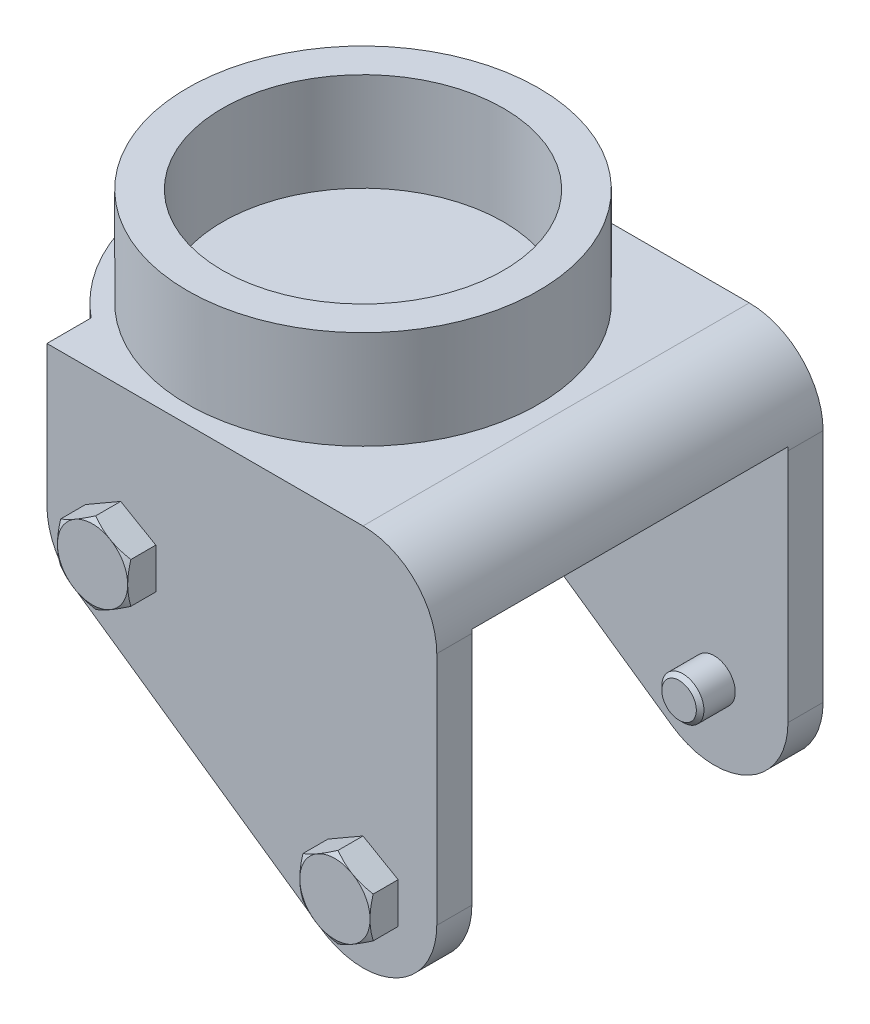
ISO-10303-21;
HEADER;
FILE_DESCRIPTION(('STEP AP214'),'2;1');
FILE_NAME('part.step','',(''),(''),'','','');
FILE_SCHEMA(('AUTOMOTIVE_DESIGN { 1 0 10303 214 1 1 1 1 }'));
ENDSEC;
DATA;
#1=APPLICATION_CONTEXT('core data for automotive mechanical design processes');
#2=APPLICATION_PROTOCOL_DEFINITION('international standard','automotive_design',2000,#1);
#3=PRODUCT_CONTEXT('',#1,'mechanical');
#4=PRODUCT('Part','Part','',(#3));
#5=PRODUCT_RELATED_PRODUCT_CATEGORY('part','',(#4));
#6=PRODUCT_DEFINITION_FORMATION('','',#4);
#7=PRODUCT_DEFINITION_CONTEXT('part definition',#1,'design');
#8=PRODUCT_DEFINITION('design','',#6,#7);
#9=PRODUCT_DEFINITION_SHAPE('','',#8);
#10=(LENGTH_UNIT() NAMED_UNIT(*) SI_UNIT(.MILLI.,.METRE.));
#11=(NAMED_UNIT(*) PLANE_ANGLE_UNIT() SI_UNIT($,.RADIAN.));
#12=(NAMED_UNIT(*) SI_UNIT($,.STERADIAN.) SOLID_ANGLE_UNIT());
#13=UNCERTAINTY_MEASURE_WITH_UNIT(LENGTH_MEASURE(1.E-05),#10,'distance_accuracy_value','');
#14=(GEOMETRIC_REPRESENTATION_CONTEXT(3) GLOBAL_UNCERTAINTY_ASSIGNED_CONTEXT((#13)) GLOBAL_UNIT_ASSIGNED_CONTEXT((#10,
#11,#12)) REPRESENTATION_CONTEXT('',''));
#15=CARTESIAN_POINT('',(0.,0.,0.));
#16=DIRECTION('',(0.,0.,1.));
#17=DIRECTION('',(1.,0.,0.));
#18=AXIS2_PLACEMENT_3D('',#15,#16,#17);
#19=CARTESIAN_POINT('',(-7.,-40.,27.5));
#20=DIRECTION('',(0.,0.,1.));
#21=DIRECTION('',(1.,0.,0.));
#22=AXIS2_PLACEMENT_3D('',#19,#20,#21);
#23=PLANE('',#22);
#24=DIRECTION('',(0.866025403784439,0.5,0.));
#25=VECTOR('',#24,1.);
#26=CARTESIAN_POINT('',(27.5,-69.7735026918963,27.5));
#27=LINE('',#26,#25);
#28=CARTESIAN_POINT('',(27.5,-69.7735026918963,27.5));
#29=VERTEX_POINT('',#28);
#30=CARTESIAN_POINT('',(32.5,-66.8867513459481,27.5));
#31=VERTEX_POINT('',#30);
#32=EDGE_CURVE('E2091',#29,#31,#27,.T.);
#33=ORIENTED_EDGE('',*,*,#32,.F.);
#34=DIRECTION('',(0.866025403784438,-0.5,0.));
#35=VECTOR('',#34,1.);
#36=CARTESIAN_POINT('',(22.5,-66.8867513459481,27.5));
#37=LINE('',#36,#35);
#38=CARTESIAN_POINT('',(22.5,-66.8867513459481,27.5));
#39=VERTEX_POINT('',#38);
#40=EDGE_CURVE('E2087',#39,#29,#37,.T.);
#41=ORIENTED_EDGE('',*,*,#40,.F.);
#42=DIRECTION('',(0.,-1.,0.));
#43=VECTOR('',#42,1.);
#44=CARTESIAN_POINT('',(22.5,-61.1132486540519,27.5));
#45=LINE('',#44,#43);
#46=CARTESIAN_POINT('',(22.5,-61.1132486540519,27.5));
#47=VERTEX_POINT('',#46);
#48=EDGE_CURVE('E2086',#47,#39,#45,.T.);
#49=ORIENTED_EDGE('',*,*,#48,.F.);
#50=DIRECTION('',(-0.866025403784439,-0.5,0.));
#51=VECTOR('',#50,1.);
#52=CARTESIAN_POINT('',(27.5,-58.2264973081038,27.5));
#53=LINE('',#52,#51);
#54=CARTESIAN_POINT('',(27.5,-58.2264973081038,27.5));
#55=VERTEX_POINT('',#54);
#56=EDGE_CURVE('E39',#55,#47,#53,.T.);
#57=ORIENTED_EDGE('',*,*,#56,.F.);
#58=DIRECTION('',(-0.866025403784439,0.5,0.));
#59=VECTOR('',#58,1.);
#60=CARTESIAN_POINT('',(32.5,-61.1132486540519,27.5));
#61=LINE('',#60,#59);
#62=CARTESIAN_POINT('',(32.5,-61.1132486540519,27.5));
#63=VERTEX_POINT('',#62);
#64=EDGE_CURVE('E2098',#63,#55,#61,.T.);
#65=ORIENTED_EDGE('',*,*,#64,.F.);
#66=DIRECTION('',(0.,1.,0.));
#67=VECTOR('',#66,1.);
#68=CARTESIAN_POINT('',(32.5,-66.8867513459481,27.5));
#69=LINE('',#68,#67);
#70=EDGE_CURVE('E2102',#31,#63,#69,.T.);
#71=ORIENTED_EDGE('',*,*,#70,.F.);
#72=EDGE_LOOP('',(#33,#41,#49,#57,#65,#71));
#73=FACE_BOUND('',#72,.T.);
#74=CARTESIAN_POINT('',(-7.,-40.,27.5));
#75=DIRECTION('',(0.,0.,1.));
#76=DIRECTION('',(1.,0.,0.));
#77=AXIS2_PLACEMENT_3D('',#74,#75,#76);
#78=CIRCLE('',#77,10.5);
#79=CARTESIAN_POINT('',(-17.5,-40.,27.5));
#80=VERTEX_POINT('',#79);
#81=CARTESIAN_POINT('',(-12.9961771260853,-48.6195046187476,27.5));
#82=VERTEX_POINT('',#81);
#83=EDGE_CURVE('E776',#80,#82,#78,.T.);
#84=ORIENTED_EDGE('',*,*,#83,.T.);
#85=DIRECTION('',(-0.820905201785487,0.5710644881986,0.));
#86=VECTOR('',#85,1.);
#87=CARTESIAN_POINT('',(21.5038228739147,-72.6195046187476,27.5));
#88=LINE('',#87,#86);
#89=CARTESIAN_POINT('',(21.5038228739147,-72.6195046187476,27.5));
#90=VERTEX_POINT('',#89);
#91=EDGE_CURVE('E1907',#90,#82,#88,.T.);
#92=ORIENTED_EDGE('',*,*,#91,.F.);
#93=CARTESIAN_POINT('',(27.5,-64.,27.5));
#94=DIRECTION('',(0.,0.,1.));
#95=DIRECTION('',(1.,0.,0.));
#96=AXIS2_PLACEMENT_3D('',#93,#94,#95);
#97=CIRCLE('',#96,10.5);
#98=CARTESIAN_POINT('',(38.,-64.,27.5));
#99=VERTEX_POINT('',#98);
#100=EDGE_CURVE('E1905',#90,#99,#97,.T.);
#101=ORIENTED_EDGE('',*,*,#100,.T.);
#102=DIRECTION('',(0.,1.,0.));
#103=VECTOR('',#102,1.);
#104=CARTESIAN_POINT('',(38.,-64.,27.5));
#105=LINE('',#104,#103);
#106=CARTESIAN_POINT('',(38.,-30.5,27.5));
#107=VERTEX_POINT('',#106);
#108=EDGE_CURVE('E1902',#99,#107,#105,.T.);
#109=ORIENTED_EDGE('',*,*,#108,.T.);
#110=CARTESIAN_POINT('',(27.5,-30.5,27.5));
#111=DIRECTION('',(0.,0.,1.));
#112=DIRECTION('',(1.,0.,0.));
#113=AXIS2_PLACEMENT_3D('',#110,#111,#112);
#114=CIRCLE('',#113,10.5);
#115=CARTESIAN_POINT('',(27.5,-20.,27.5));
#116=VERTEX_POINT('',#115);
#117=EDGE_CURVE('E1898',#107,#116,#114,.T.);
#118=ORIENTED_EDGE('',*,*,#117,.T.);
#119=DIRECTION('',(1.,0.,0.));
#120=VECTOR('',#119,1.);
#121=CARTESIAN_POINT('',(-17.5,-20.,27.5));
#122=LINE('',#121,#120);
#123=CARTESIAN_POINT('',(-17.5,-20.,27.5));
#124=VERTEX_POINT('',#123);
#125=EDGE_CURVE('E1896',#124,#116,#122,.T.);
#126=ORIENTED_EDGE('',*,*,#125,.F.);
#127=DIRECTION('',(0.,-1.,0.));
#128=VECTOR('',#127,1.);
#129=CARTESIAN_POINT('',(-17.5,-20.,27.5));
#130=LINE('',#129,#128);
#131=EDGE_CURVE('E1702',#124,#80,#130,.T.);
#132=ORIENTED_EDGE('',*,*,#131,.T.);
#133=EDGE_LOOP('',(#84,#92,#101,#109,#118,#126,#132));
#134=FACE_BOUND('',#133,.T.);
#135=DIRECTION('',(0.866025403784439,0.5,0.));
#136=VECTOR('',#135,1.);
#137=CARTESIAN_POINT('',(-7.,-45.7735026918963,27.5));
#138=LINE('',#137,#136);
#139=CARTESIAN_POINT('',(-7.,-45.7735026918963,27.5));
#140=VERTEX_POINT('',#139);
#141=CARTESIAN_POINT('',(-2.,-42.8867513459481,27.5));
#142=VERTEX_POINT('',#141);
#143=EDGE_CURVE('E1653',#140,#142,#138,.T.);
#144=ORIENTED_EDGE('',*,*,#143,.F.);
#145=DIRECTION('',(0.866025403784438,-0.5,0.));
#146=VECTOR('',#145,1.);
#147=CARTESIAN_POINT('',(-12.,-42.8867513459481,27.5));
#148=LINE('',#147,#146);
#149=CARTESIAN_POINT('',(-12.,-42.8867513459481,27.5));
#150=VERTEX_POINT('',#149);
#151=EDGE_CURVE('E369',#150,#140,#148,.T.);
#152=ORIENTED_EDGE('',*,*,#151,.F.);
#153=DIRECTION('',(0.,-1.,0.));
#154=VECTOR('',#153,1.);
#155=CARTESIAN_POINT('',(-12.,-37.1132486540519,27.5));
#156=LINE('',#155,#154);
#157=CARTESIAN_POINT('',(-12.,-37.1132486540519,27.5));
#158=VERTEX_POINT('',#157);
#159=EDGE_CURVE('E353',#158,#150,#156,.T.);
#160=ORIENTED_EDGE('',*,*,#159,.F.);
#161=DIRECTION('',(-0.866025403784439,-0.5,0.));
#162=VECTOR('',#161,1.);
#163=CARTESIAN_POINT('',(-7.,-34.2264973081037,27.5));
#164=LINE('',#163,#162);
#165=CARTESIAN_POINT('',(-7.,-34.2264973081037,27.5));
#166=VERTEX_POINT('',#165);
#167=EDGE_CURVE('E31',#166,#158,#164,.T.);
#168=ORIENTED_EDGE('',*,*,#167,.F.);
#169=DIRECTION('',(-0.866025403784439,0.5,0.));
#170=VECTOR('',#169,1.);
#171=CARTESIAN_POINT('',(-2.,-37.1132486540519,27.5));
#172=LINE('',#171,#170);
#173=CARTESIAN_POINT('',(-2.,-37.1132486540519,27.5));
#174=VERTEX_POINT('',#173);
#175=EDGE_CURVE('E1658',#174,#166,#172,.T.);
#176=ORIENTED_EDGE('',*,*,#175,.F.);
#177=DIRECTION('',(0.,1.,0.));
#178=VECTOR('',#177,1.);
#179=CARTESIAN_POINT('',(-2.,-42.8867513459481,27.5));
#180=LINE('',#179,#178);
#181=EDGE_CURVE('E1662',#142,#174,#180,.T.);
#182=ORIENTED_EDGE('',*,*,#181,.F.);
#183=EDGE_LOOP('',(#144,#152,#160,#168,#176,#182));
#184=FACE_BOUND('',#183,.T.);
#185=ADVANCED_FACE('F15',(#73,#134,#184),#23,.T.);
#186=CARTESIAN_POINT('',(39.,-52.75,22.5));
#187=DIRECTION('',(0.,0.,1.));
#188=DIRECTION('',(1.,0.,0.));
#189=AXIS2_PLACEMENT_3D('',#186,#187,#188);
#190=PLANE('',#189);
#191=DIRECTION('',(0.,1.,0.));
#192=VECTOR('',#191,1.);
#193=CARTESIAN_POINT('',(38.,-64.,22.5));
#194=LINE('',#193,#192);
#195=CARTESIAN_POINT('',(38.,-64.,22.5));
#196=VERTEX_POINT('',#195);
#197=CARTESIAN_POINT('',(38.,-30.5,22.5));
#198=VERTEX_POINT('',#197);
#199=EDGE_CURVE('E1718',#196,#198,#194,.T.);
#200=ORIENTED_EDGE('',*,*,#199,.F.);
#201=CARTESIAN_POINT('',(27.5,-64.,22.5));
#202=DIRECTION('',(0.,0.,1.));
#203=DIRECTION('',(1.,0.,0.));
#204=AXIS2_PLACEMENT_3D('',#201,#202,#203);
#205=CIRCLE('',#204,10.5);
#206=CARTESIAN_POINT('',(21.5038228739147,-72.6195046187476,22.5));
#207=VERTEX_POINT('',#206);
#208=EDGE_CURVE('E1723',#207,#196,#205,.T.);
#209=ORIENTED_EDGE('',*,*,#208,.F.);
#210=DIRECTION('',(-0.820905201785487,0.5710644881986,0.));
#211=VECTOR('',#210,1.);
#212=CARTESIAN_POINT('',(21.5038228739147,-72.6195046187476,22.5));
#213=LINE('',#212,#211);
#214=CARTESIAN_POINT('',(-12.9961771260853,-48.6195046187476,22.5));
#215=VERTEX_POINT('',#214);
#216=EDGE_CURVE('E1728',#207,#215,#213,.T.);
#217=ORIENTED_EDGE('',*,*,#216,.T.);
#218=CARTESIAN_POINT('',(-7.,-40.,22.5));
#219=DIRECTION('',(0.,0.,1.));
#220=DIRECTION('',(1.,0.,0.));
#221=AXIS2_PLACEMENT_3D('',#218,#219,#220);
#222=CIRCLE('',#221,10.5);
#223=CARTESIAN_POINT('',(-17.5,-40.,22.5));
#224=VERTEX_POINT('',#223);
#225=EDGE_CURVE('E1732',#224,#215,#222,.T.);
#226=ORIENTED_EDGE('',*,*,#225,.F.);
#227=DIRECTION('',(0.,-1.,0.));
#228=VECTOR('',#227,1.);
#229=CARTESIAN_POINT('',(-17.5,-20.,22.5));
#230=LINE('',#229,#228);
#231=CARTESIAN_POINT('',(-17.5,-30.,22.5));
#232=VERTEX_POINT('',#231);
#233=EDGE_CURVE('E771',#232,#224,#230,.T.);
#234=ORIENTED_EDGE('',*,*,#233,.F.);
#235=DIRECTION('',(-1.,0.,0.));
#236=VECTOR('',#235,1.);
#237=CARTESIAN_POINT('',(39.,-30.,22.5));
#238=LINE('',#237,#236);
#239=CARTESIAN_POINT('',(37.9880884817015,-30.,22.5));
#240=VERTEX_POINT('',#239);
#241=EDGE_CURVE('E1740',#240,#232,#238,.T.);
#242=ORIENTED_EDGE('',*,*,#241,.F.);
#243=CARTESIAN_POINT('',(27.5,-30.5,22.5));
#244=DIRECTION('',(0.,0.,1.));
#245=DIRECTION('',(1.,0.,0.));
#246=AXIS2_PLACEMENT_3D('',#243,#244,#245);
#247=CIRCLE('',#246,10.5);
#248=EDGE_CURVE('E1722',#198,#240,#247,.T.);
#249=ORIENTED_EDGE('',*,*,#248,.F.);
#250=EDGE_LOOP('',(#200,#209,#217,#226,#234,#242,#249));
#251=FACE_BOUND('',#250,.T.);
#252=CARTESIAN_POINT('',(27.5,-64.,22.5));
#253=DIRECTION('',(0.,0.,1.));
#254=DIRECTION('',(1.,0.,0.));
#255=AXIS2_PLACEMENT_3D('',#252,#253,#254);
#256=CIRCLE('',#255,3.);
#257=CARTESIAN_POINT('',(30.5,-64.,22.5));
#258=VERTEX_POINT('',#257);
#259=EDGE_CURVE('E10',#258,#258,#256,.F.);
#260=ORIENTED_EDGE('',*,*,#259,.F.);
#261=EDGE_LOOP('',(#260));
#262=FACE_BOUND('',#261,.T.);
#263=ADVANCED_FACE('F668',(#251,#262),#190,.F.);
#264=CARTESIAN_POINT('',(-7.,-40.,-27.5));
#265=DIRECTION('',(0.,0.,1.));
#266=DIRECTION('',(1.,0.,0.));
#267=AXIS2_PLACEMENT_3D('',#264,#265,#266);
#268=PLANE('',#267);
#269=DIRECTION('',(0.866025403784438,0.5,0.));
#270=VECTOR('',#269,1.);
#271=CARTESIAN_POINT('',(22.5,-61.1132486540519,-27.5));
#272=LINE('',#271,#270);
#273=CARTESIAN_POINT('',(22.5,-61.1132486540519,-27.5));
#274=VERTEX_POINT('',#273);
#275=CARTESIAN_POINT('',(27.5,-58.2264973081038,-27.5));
#276=VERTEX_POINT('',#275);
#277=EDGE_CURVE('E1757',#274,#276,#272,.T.);
#278=ORIENTED_EDGE('',*,*,#277,.F.);
#279=DIRECTION('',(0.,1.,0.));
#280=VECTOR('',#279,1.);
#281=CARTESIAN_POINT('',(22.5,-66.8867513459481,-27.5));
#282=LINE('',#281,#280);
#283=CARTESIAN_POINT('',(22.5,-66.8867513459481,-27.5));
#284=VERTEX_POINT('',#283);
#285=EDGE_CURVE('E1764',#284,#274,#282,.T.);
#286=ORIENTED_EDGE('',*,*,#285,.F.);
#287=DIRECTION('',(-0.866025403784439,0.5,0.));
#288=VECTOR('',#287,1.);
#289=CARTESIAN_POINT('',(27.5,-69.7735026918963,-27.5));
#290=LINE('',#289,#288);
#291=CARTESIAN_POINT('',(27.5,-69.7735026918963,-27.5));
#292=VERTEX_POINT('',#291);
#293=EDGE_CURVE('E1769',#292,#284,#290,.T.);
#294=ORIENTED_EDGE('',*,*,#293,.F.);
#295=DIRECTION('',(-0.866025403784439,-0.5,0.));
#296=VECTOR('',#295,1.);
#297=CARTESIAN_POINT('',(32.5,-66.8867513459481,-27.5));
#298=LINE('',#297,#296);
#299=CARTESIAN_POINT('',(32.5,-66.8867513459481,-27.5));
#300=VERTEX_POINT('',#299);
#301=EDGE_CURVE('E1774',#300,#292,#298,.T.);
#302=ORIENTED_EDGE('',*,*,#301,.F.);
#303=DIRECTION('',(0.,-1.,0.));
#304=VECTOR('',#303,1.);
#305=CARTESIAN_POINT('',(32.5,-61.1132486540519,-27.5));
#306=LINE('',#305,#304);
#307=CARTESIAN_POINT('',(32.5,-61.1132486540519,-27.5));
#308=VERTEX_POINT('',#307);
#309=EDGE_CURVE('E1779',#308,#300,#306,.T.);
#310=ORIENTED_EDGE('',*,*,#309,.F.);
#311=DIRECTION('',(0.866025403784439,-0.5,0.));
#312=VECTOR('',#311,1.);
#313=CARTESIAN_POINT('',(27.5,-58.2264973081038,-27.5));
#314=LINE('',#313,#312);
#315=EDGE_CURVE('E1761',#276,#308,#314,.T.);
#316=ORIENTED_EDGE('',*,*,#315,.F.);
#317=EDGE_LOOP('',(#278,#286,#294,#302,#310,#316));
#318=FACE_BOUND('',#317,.T.);
#319=CARTESIAN_POINT('',(-7.,-40.,-27.5));
#320=DIRECTION('',(0.,0.,1.));
#321=DIRECTION('',(1.,0.,0.));
#322=AXIS2_PLACEMENT_3D('',#319,#320,#321);
#323=CIRCLE('',#322,10.5);
#324=CARTESIAN_POINT('',(-17.5,-40.,-27.5));
#325=VERTEX_POINT('',#324);
#326=CARTESIAN_POINT('',(-12.9961771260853,-48.6195046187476,-27.5));
#327=VERTEX_POINT('',#326);
#328=EDGE_CURVE('E760',#325,#327,#323,.T.);
#329=ORIENTED_EDGE('',*,*,#328,.F.);
#330=DIRECTION('',(0.,-1.,0.));
#331=VECTOR('',#330,1.);
#332=CARTESIAN_POINT('',(-17.5,-20.,-27.5));
#333=LINE('',#332,#331);
#334=CARTESIAN_POINT('',(-17.5,-20.,-27.5));
#335=VERTEX_POINT('',#334);
#336=EDGE_CURVE('E1793',#335,#325,#333,.T.);
#337=ORIENTED_EDGE('',*,*,#336,.F.);
#338=DIRECTION('',(1.,0.,0.));
#339=VECTOR('',#338,1.);
#340=CARTESIAN_POINT('',(-17.5,-20.,-27.5));
#341=LINE('',#340,#339);
#342=CARTESIAN_POINT('',(27.5,-20.,-27.5));
#343=VERTEX_POINT('',#342);
#344=EDGE_CURVE('E1797',#335,#343,#341,.T.);
#345=ORIENTED_EDGE('',*,*,#344,.T.);
#346=CARTESIAN_POINT('',(27.5,-30.5,-27.5));
#347=DIRECTION('',(0.,0.,1.));
#348=DIRECTION('',(1.,0.,0.));
#349=AXIS2_PLACEMENT_3D('',#346,#347,#348);
#350=CIRCLE('',#349,10.5);
#351=CARTESIAN_POINT('',(38.,-30.5,-27.5));
#352=VERTEX_POINT('',#351);
#353=EDGE_CURVE('E1801',#352,#343,#350,.T.);
#354=ORIENTED_EDGE('',*,*,#353,.F.);
#355=DIRECTION('',(0.,1.,0.));
#356=VECTOR('',#355,1.);
#357=CARTESIAN_POINT('',(38.,-64.,-27.5));
#358=LINE('',#357,#356);
#359=CARTESIAN_POINT('',(38.,-64.,-27.5));
#360=VERTEX_POINT('',#359);
#361=EDGE_CURVE('E1806',#360,#352,#358,.T.);
#362=ORIENTED_EDGE('',*,*,#361,.F.);
#363=CARTESIAN_POINT('',(27.5,-64.,-27.5));
#364=DIRECTION('',(0.,0.,1.));
#365=DIRECTION('',(1.,0.,0.));
#366=AXIS2_PLACEMENT_3D('',#363,#364,#365);
#367=CIRCLE('',#366,10.5);
#368=CARTESIAN_POINT('',(21.5038228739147,-72.6195046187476,-27.5));
#369=VERTEX_POINT('',#368);
#370=EDGE_CURVE('E1811',#369,#360,#367,.T.);
#371=ORIENTED_EDGE('',*,*,#370,.F.);
#372=DIRECTION('',(-0.820905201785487,0.5710644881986,0.));
#373=VECTOR('',#372,1.);
#374=CARTESIAN_POINT('',(21.5038228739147,-72.6195046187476,-27.5));
#375=LINE('',#374,#373);
#376=EDGE_CURVE('E1790',#369,#327,#375,.T.);
#377=ORIENTED_EDGE('',*,*,#376,.T.);
#378=EDGE_LOOP('',(#329,#337,#345,#354,#362,#371,#377));
#379=FACE_BOUND('',#378,.T.);
#380=DIRECTION('',(0.866025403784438,0.5,0.));
#381=VECTOR('',#380,1.);
#382=CARTESIAN_POINT('',(-12.,-37.1132486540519,-27.5));
#383=LINE('',#382,#381);
#384=CARTESIAN_POINT('',(-12.,-37.1132486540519,-27.5));
#385=VERTEX_POINT('',#384);
#386=CARTESIAN_POINT('',(-7.,-34.2264973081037,-27.5));
#387=VERTEX_POINT('',#386);
#388=EDGE_CURVE('E1820',#385,#387,#383,.T.);
#389=ORIENTED_EDGE('',*,*,#388,.F.);
#390=DIRECTION('',(0.,1.,0.));
#391=VECTOR('',#390,1.);
#392=CARTESIAN_POINT('',(-12.,-42.8867513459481,-27.5));
#393=LINE('',#392,#391);
#394=CARTESIAN_POINT('',(-12.,-42.8867513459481,-27.5));
#395=VERTEX_POINT('',#394);
#396=EDGE_CURVE('E1827',#395,#385,#393,.T.);
#397=ORIENTED_EDGE('',*,*,#396,.F.);
#398=DIRECTION('',(-0.866025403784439,0.5,0.));
#399=VECTOR('',#398,1.);
#400=CARTESIAN_POINT('',(-7.,-45.7735026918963,-27.5));
#401=LINE('',#400,#399);
#402=CARTESIAN_POINT('',(-7.,-45.7735026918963,-27.5));
#403=VERTEX_POINT('',#402);
#404=EDGE_CURVE('E1832',#403,#395,#401,.T.);
#405=ORIENTED_EDGE('',*,*,#404,.F.);
#406=DIRECTION('',(-0.866025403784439,-0.5,0.));
#407=VECTOR('',#406,1.);
#408=CARTESIAN_POINT('',(-2.,-42.8867513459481,-27.5));
#409=LINE('',#408,#407);
#410=CARTESIAN_POINT('',(-2.,-42.8867513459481,-27.5));
#411=VERTEX_POINT('',#410);
#412=EDGE_CURVE('E1837',#411,#403,#409,.T.);
#413=ORIENTED_EDGE('',*,*,#412,.F.);
#414=DIRECTION('',(0.,-1.,0.));
#415=VECTOR('',#414,1.);
#416=CARTESIAN_POINT('',(-2.,-37.1132486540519,-27.5));
#417=LINE('',#416,#415);
#418=CARTESIAN_POINT('',(-2.,-37.1132486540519,-27.5));
#419=VERTEX_POINT('',#418);
#420=EDGE_CURVE('E1842',#419,#411,#417,.T.);
#421=ORIENTED_EDGE('',*,*,#420,.F.);
#422=DIRECTION('',(0.866025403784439,-0.5,0.));
#423=VECTOR('',#422,1.);
#424=CARTESIAN_POINT('',(-7.,-34.2264973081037,-27.5));
#425=LINE('',#424,#423);
#426=EDGE_CURVE('E1824',#387,#419,#425,.T.);
#427=ORIENTED_EDGE('',*,*,#426,.F.);
#428=EDGE_LOOP('',(#389,#397,#405,#413,#421,#427));
#429=FACE_BOUND('',#428,.T.);
#430=ADVANCED_FACE('F671',(#318,#379,#429),#268,.F.);
#431=CARTESIAN_POINT('',(39.,-52.75,-22.5));
#432=DIRECTION('',(0.,0.,-1.));
#433=DIRECTION('',(-1.,0.,0.));
#434=AXIS2_PLACEMENT_3D('',#431,#432,#433);
#435=PLANE('',#434);
#436=DIRECTION('',(-1.,0.,0.));
#437=VECTOR('',#436,1.);
#438=CARTESIAN_POINT('',(39.,-30.,-22.5));
#439=LINE('',#438,#437);
#440=CARTESIAN_POINT('',(37.9880884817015,-30.,-22.5));
#441=VERTEX_POINT('',#440);
#442=CARTESIAN_POINT('',(-17.5,-30.,-22.5));
#443=VERTEX_POINT('',#442);
#444=EDGE_CURVE('E1744',#441,#443,#439,.T.);
#445=ORIENTED_EDGE('',*,*,#444,.T.);
#446=DIRECTION('',(0.,1.,0.));
#447=VECTOR('',#446,1.);
#448=CARTESIAN_POINT('',(-17.5,-20.,-22.5));
#449=LINE('',#448,#447);
#450=CARTESIAN_POINT('',(-17.5,-40.,-22.5));
#451=VERTEX_POINT('',#450);
#452=EDGE_CURVE('E806',#451,#443,#449,.T.);
#453=ORIENTED_EDGE('',*,*,#452,.F.);
#454=CARTESIAN_POINT('',(-7.,-40.,-22.5));
#455=DIRECTION('',(0.,0.,-1.));
#456=DIRECTION('',(-1.,0.,0.));
#457=AXIS2_PLACEMENT_3D('',#454,#455,#456);
#458=CIRCLE('',#457,10.5);
#459=CARTESIAN_POINT('',(-12.9961771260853,-48.6195046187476,-22.5));
#460=VERTEX_POINT('',#459);
#461=EDGE_CURVE('E755',#460,#451,#458,.T.);
#462=ORIENTED_EDGE('',*,*,#461,.F.);
#463=DIRECTION('',(0.820905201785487,-0.5710644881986,0.));
#464=VECTOR('',#463,1.);
#465=CARTESIAN_POINT('',(21.5038228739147,-72.6195046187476,-22.5));
#466=LINE('',#465,#464);
#467=CARTESIAN_POINT('',(21.5038228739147,-72.6195046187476,-22.5));
#468=VERTEX_POINT('',#467);
#469=EDGE_CURVE('E746',#460,#468,#466,.T.);
#470=ORIENTED_EDGE('',*,*,#469,.T.);
#471=CARTESIAN_POINT('',(27.5,-64.,-22.5));
#472=DIRECTION('',(0.,0.,-1.));
#473=DIRECTION('',(-1.,0.,0.));
#474=AXIS2_PLACEMENT_3D('',#471,#472,#473);
#475=CIRCLE('',#474,10.5);
#476=CARTESIAN_POINT('',(38.,-64.,-22.5));
#477=VERTEX_POINT('',#476);
#478=EDGE_CURVE('E754',#477,#468,#475,.T.);
#479=ORIENTED_EDGE('',*,*,#478,.F.);
#480=DIRECTION('',(0.,-1.,0.));
#481=VECTOR('',#480,1.);
#482=CARTESIAN_POINT('',(38.,-64.,-22.5));
#483=LINE('',#482,#481);
#484=CARTESIAN_POINT('',(38.,-30.5,-22.5));
#485=VERTEX_POINT('',#484);
#486=EDGE_CURVE('E1863',#485,#477,#483,.T.);
#487=ORIENTED_EDGE('',*,*,#486,.F.);
#488=CARTESIAN_POINT('',(27.5,-30.5,-22.5));
#489=DIRECTION('',(0.,0.,-1.));
#490=DIRECTION('',(-1.,0.,0.));
#491=AXIS2_PLACEMENT_3D('',#488,#489,#490);
#492=CIRCLE('',#491,10.5);
#493=EDGE_CURVE('E818',#441,#485,#492,.T.);
#494=ORIENTED_EDGE('',*,*,#493,.F.);
#495=EDGE_LOOP('',(#445,#453,#462,#470,#479,#487,#494));
#496=FACE_BOUND('',#495,.T.);
#497=CARTESIAN_POINT('',(27.5,-64.,-22.5));
#498=DIRECTION('',(0.,0.,-1.));
#499=DIRECTION('',(-1.,0.,0.));
#500=AXIS2_PLACEMENT_3D('',#497,#498,#499);
#501=CIRCLE('',#500,3.);
#502=CARTESIAN_POINT('',(24.5,-64.,-22.5));
#503=VERTEX_POINT('',#502);
#504=EDGE_CURVE('E24',#503,#503,#501,.F.);
#505=ORIENTED_EDGE('',*,*,#504,.F.);
#506=EDGE_LOOP('',(#505));
#507=FACE_BOUND('',#506,.T.);
#508=ADVANCED_FACE('F673',(#496,#507),#435,.F.);
#509=CARTESIAN_POINT('',(-7.,-40.,27.5));
#510=DIRECTION('',(0.,0.,-1.));
#511=DIRECTION('',(-1.,0.,0.));
#512=AXIS2_PLACEMENT_3D('',#509,#510,#511);
#513=CYLINDRICAL_SURFACE('',#512,10.5);
#514=DIRECTION('',(0.,0.,-1.));
#515=VECTOR('',#514,1.);
#516=CARTESIAN_POINT('',(-12.9961771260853,-48.6195046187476,27.5));
#517=LINE('',#516,#515);
#518=EDGE_CURVE('E749',#460,#327,#517,.T.);
#519=ORIENTED_EDGE('',*,*,#518,.F.);
#520=ORIENTED_EDGE('',*,*,#461,.T.);
#521=DIRECTION('',(0.,0.,-1.));
#522=VECTOR('',#521,1.);
#523=CARTESIAN_POINT('',(-17.5,-40.,27.5));
#524=LINE('',#523,#522);
#525=EDGE_CURVE('E799',#451,#325,#524,.T.);
#526=ORIENTED_EDGE('',*,*,#525,.T.);
#527=ORIENTED_EDGE('',*,*,#328,.T.);
#528=EDGE_LOOP('',(#519,#520,#526,#527));
#529=FACE_BOUND('',#528,.T.);
#530=ADVANCED_FACE('F676',(#529),#513,.T.);
#531=CARTESIAN_POINT('',(21.5038228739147,-72.6195046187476,27.5));
#532=DIRECTION('',(-0.5710644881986,-0.820905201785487,0.));
#533=DIRECTION('',(0.820905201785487,-0.5710644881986,0.));
#534=AXIS2_PLACEMENT_3D('',#531,#532,#533);
#535=PLANE('',#534);
#536=ORIENTED_EDGE('',*,*,#469,.F.);
#537=ORIENTED_EDGE('',*,*,#518,.T.);
#538=ORIENTED_EDGE('',*,*,#376,.F.);
#539=DIRECTION('',(0.,0.,-1.));
#540=VECTOR('',#539,1.);
#541=CARTESIAN_POINT('',(21.5038228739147,-72.6195046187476,27.5));
#542=LINE('',#541,#540);
#543=EDGE_CURVE('E751',#468,#369,#542,.T.);
#544=ORIENTED_EDGE('',*,*,#543,.F.);
#545=EDGE_LOOP('',(#536,#537,#538,#544));
#546=FACE_BOUND('',#545,.T.);
#547=ADVANCED_FACE('F729',(#546),#535,.T.);
#548=CARTESIAN_POINT('',(27.5,-64.,27.5));
#549=DIRECTION('',(0.,0.,-1.));
#550=DIRECTION('',(-1.,0.,0.));
#551=AXIS2_PLACEMENT_3D('',#548,#549,#550);
#552=CYLINDRICAL_SURFACE('',#551,10.5);
#553=DIRECTION('',(0.,0.,-1.));
#554=VECTOR('',#553,1.);
#555=CARTESIAN_POINT('',(38.,-64.,27.5));
#556=LINE('',#555,#554);
#557=EDGE_CURVE('E783',#477,#360,#556,.T.);
#558=ORIENTED_EDGE('',*,*,#557,.F.);
#559=ORIENTED_EDGE('',*,*,#478,.T.);
#560=ORIENTED_EDGE('',*,*,#543,.T.);
#561=ORIENTED_EDGE('',*,*,#370,.T.);
#562=EDGE_LOOP('',(#558,#559,#560,#561));
#563=FACE_BOUND('',#562,.T.);
#564=ADVANCED_FACE('F726',(#563),#552,.T.);
#565=CARTESIAN_POINT('',(38.,-64.,27.5));
#566=DIRECTION('',(-1.,0.,0.));
#567=DIRECTION('',(0.,0.,1.));
#568=AXIS2_PLACEMENT_3D('',#565,#566,#567);
#569=PLANE('',#568);
#570=DIRECTION('',(0.,0.,-1.));
#571=VECTOR('',#570,1.);
#572=CARTESIAN_POINT('',(38.,-30.5,27.5));
#573=LINE('',#572,#571);
#574=EDGE_CURVE('E788',#485,#352,#573,.T.);
#575=ORIENTED_EDGE('',*,*,#574,.F.);
#576=ORIENTED_EDGE('',*,*,#486,.T.);
#577=ORIENTED_EDGE('',*,*,#557,.T.);
#578=ORIENTED_EDGE('',*,*,#361,.T.);
#579=EDGE_LOOP('',(#575,#576,#577,#578));
#580=FACE_BOUND('',#579,.T.);
#581=ADVANCED_FACE('F722',(#580),#569,.F.);
#582=CARTESIAN_POINT('',(-17.5,-20.,27.5));
#583=DIRECTION('',(1.,0.,0.));
#584=DIRECTION('',(0.,1.,0.));
#585=AXIS2_PLACEMENT_3D('',#582,#583,#584);
#586=PLANE('',#585);
#587=ORIENTED_EDGE('',*,*,#525,.F.);
#588=ORIENTED_EDGE('',*,*,#452,.T.);
#589=DIRECTION('',(0.,0.,1.));
#590=VECTOR('',#589,1.);
#591=CARTESIAN_POINT('',(-17.5,-30.,27.5));
#592=LINE('',#591,#590);
#593=CARTESIAN_POINT('',(-17.5,-30.,-21.2132034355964));
#594=VERTEX_POINT('',#593);
#595=EDGE_CURVE('E1939',#443,#594,#592,.T.);
#596=ORIENTED_EDGE('',*,*,#595,.T.);
#597=DIRECTION('',(0.,-1.,0.));
#598=VECTOR('',#597,1.);
#599=CARTESIAN_POINT('',(-17.5,-20.,-21.2132034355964));
#600=LINE('',#599,#598);
#601=CARTESIAN_POINT('',(-17.5,-20.,-21.2132034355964));
#602=VERTEX_POINT('',#601);
#603=EDGE_CURVE('E1889',#594,#602,#600,.F.);
#604=ORIENTED_EDGE('',*,*,#603,.T.);
#605=DIRECTION('',(0.,0.,-1.));
#606=VECTOR('',#605,1.);
#607=CARTESIAN_POINT('',(-17.5,-20.,27.5));
#608=LINE('',#607,#606);
#609=EDGE_CURVE('E798',#602,#335,#608,.T.);
#610=ORIENTED_EDGE('',*,*,#609,.T.);
#611=ORIENTED_EDGE('',*,*,#336,.T.);
#612=EDGE_LOOP('',(#587,#588,#596,#604,#610,#611));
#613=FACE_BOUND('',#612,.T.);
#614=ADVANCED_FACE('F709',(#613),#586,.F.);
#615=EDGE_CURVE('E794',#80,#224,#524,.T.);
#616=ORIENTED_EDGE('',*,*,#615,.T.);
#617=ORIENTED_EDGE('',*,*,#225,.T.);
#618=EDGE_CURVE('E763',#82,#215,#517,.T.);
#619=ORIENTED_EDGE('',*,*,#618,.F.);
#620=ORIENTED_EDGE('',*,*,#83,.F.);
#621=EDGE_LOOP('',(#616,#617,#619,#620));
#622=FACE_BOUND('',#621,.T.);
#623=ADVANCED_FACE('F17',(#622),#513,.T.);
#624=ORIENTED_EDGE('',*,*,#216,.F.);
#625=EDGE_CURVE('E764',#90,#207,#542,.T.);
#626=ORIENTED_EDGE('',*,*,#625,.F.);
#627=ORIENTED_EDGE('',*,*,#91,.T.);
#628=ORIENTED_EDGE('',*,*,#618,.T.);
#629=EDGE_LOOP('',(#624,#626,#627,#628));
#630=FACE_BOUND('',#629,.T.);
#631=ADVANCED_FACE('F724',(#630),#535,.T.);
#632=ORIENTED_EDGE('',*,*,#625,.T.);
#633=ORIENTED_EDGE('',*,*,#208,.T.);
#634=EDGE_CURVE('E779',#99,#196,#556,.T.);
#635=ORIENTED_EDGE('',*,*,#634,.F.);
#636=ORIENTED_EDGE('',*,*,#100,.F.);
#637=EDGE_LOOP('',(#632,#633,#635,#636));
#638=FACE_BOUND('',#637,.T.);
#639=ADVANCED_FACE('F720',(#638),#552,.T.);
#640=ORIENTED_EDGE('',*,*,#634,.T.);
#641=ORIENTED_EDGE('',*,*,#199,.T.);
#642=EDGE_CURVE('E784',#107,#198,#573,.T.);
#643=ORIENTED_EDGE('',*,*,#642,.F.);
#644=ORIENTED_EDGE('',*,*,#108,.F.);
#645=EDGE_LOOP('',(#640,#641,#643,#644));
#646=FACE_BOUND('',#645,.T.);
#647=ADVANCED_FACE('F716',(#646),#569,.F.);
#648=CARTESIAN_POINT('',(27.5,-30.5,27.5));
#649=DIRECTION('',(0.,0.,-1.));
#650=DIRECTION('',(-1.,0.,0.));
#651=AXIS2_PLACEMENT_3D('',#648,#649,#650);
#652=CYLINDRICAL_SURFACE('',#651,10.5);
#653=DIRECTION('',(0.,0.,-1.));
#654=VECTOR('',#653,1.);
#655=CARTESIAN_POINT('',(37.9880884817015,-30.,27.5));
#656=LINE('',#655,#654);
#657=EDGE_CURVE('E1736',#240,#441,#656,.T.);
#658=ORIENTED_EDGE('',*,*,#657,.T.);
#659=ORIENTED_EDGE('',*,*,#493,.T.);
#660=ORIENTED_EDGE('',*,*,#574,.T.);
#661=ORIENTED_EDGE('',*,*,#353,.T.);
#662=DIRECTION('',(0.,0.,-1.));
#663=VECTOR('',#662,1.);
#664=CARTESIAN_POINT('',(27.5,-20.,27.5));
#665=LINE('',#664,#663);
#666=EDGE_CURVE('E789',#116,#343,#665,.T.);
#667=ORIENTED_EDGE('',*,*,#666,.F.);
#668=ORIENTED_EDGE('',*,*,#117,.F.);
#669=ORIENTED_EDGE('',*,*,#642,.T.);
#670=ORIENTED_EDGE('',*,*,#248,.T.);
#671=EDGE_LOOP('',(#658,#659,#660,#661,#667,#668,#669,#670));
#672=FACE_BOUND('',#671,.T.);
#673=ADVANCED_FACE('F712',(#672),#652,.T.);
#674=CARTESIAN_POINT('',(-17.5,-20.,27.5));
#675=DIRECTION('',(0.,1.,0.));
#676=DIRECTION('',(0.,0.,1.));
#677=AXIS2_PLACEMENT_3D('',#674,#675,#676);
#678=PLANE('',#677);
#679=CARTESIAN_POINT('',(0.,-20.,0.));
#680=DIRECTION('',(0.,-1.,0.));
#681=DIRECTION('',(0.,0.,-1.));
#682=AXIS2_PLACEMENT_3D('',#679,#680,#681);
#683=CIRCLE('',#682,27.5);
#684=CARTESIAN_POINT('',(-17.5,-20.,21.2132034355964));
#685=VERTEX_POINT('',#684);
#686=EDGE_CURVE('E1871',#685,#602,#683,.T.);
#687=ORIENTED_EDGE('',*,*,#686,.F.);
#688=EDGE_CURVE('E793',#124,#685,#608,.T.);
#689=ORIENTED_EDGE('',*,*,#688,.F.);
#690=ORIENTED_EDGE('',*,*,#125,.T.);
#691=ORIENTED_EDGE('',*,*,#666,.T.);
#692=ORIENTED_EDGE('',*,*,#344,.F.);
#693=ORIENTED_EDGE('',*,*,#609,.F.);
#694=EDGE_LOOP('',(#687,#689,#690,#691,#692,#693));
#695=FACE_BOUND('',#694,.T.);
#696=CARTESIAN_POINT('',(0.,-20.,0.));
#697=DIRECTION('',(0.,1.,0.));
#698=DIRECTION('',(-1.,0.,0.));
#699=AXIS2_PLACEMENT_3D('',#696,#697,#698);
#700=CIRCLE('',#699,25.);
#701=CARTESIAN_POINT('',(-25.,-20.,0.));
#702=VERTEX_POINT('',#701);
#703=EDGE_CURVE('E1877',#702,#702,#700,.F.);
#704=ORIENTED_EDGE('',*,*,#703,.T.);
#705=EDGE_LOOP('',(#704));
#706=FACE_BOUND('',#705,.T.);
#707=ADVANCED_FACE('F707',(#695,#706),#678,.T.);
#708=DIRECTION('',(0.,-1.,0.));
#709=VECTOR('',#708,1.);
#710=CARTESIAN_POINT('',(-17.5,-20.,21.2132034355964));
#711=LINE('',#710,#709);
#712=CARTESIAN_POINT('',(-17.5,-30.,21.2132034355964));
#713=VERTEX_POINT('',#712);
#714=EDGE_CURVE('E1791',#685,#713,#711,.T.);
#715=ORIENTED_EDGE('',*,*,#714,.T.);
#716=EDGE_CURVE('E1854',#713,#232,#592,.T.);
#717=ORIENTED_EDGE('',*,*,#716,.T.);
#718=ORIENTED_EDGE('',*,*,#233,.T.);
#719=ORIENTED_EDGE('',*,*,#615,.F.);
#720=ORIENTED_EDGE('',*,*,#131,.F.);
#721=ORIENTED_EDGE('',*,*,#688,.T.);
#722=EDGE_LOOP('',(#715,#717,#718,#719,#720,#721));
#723=FACE_BOUND('',#722,.T.);
#724=ADVANCED_FACE('F682',(#723),#586,.F.);
#725=CARTESIAN_POINT('',(0.,-30.,0.));
#726=DIRECTION('',(0.,-1.,0.));
#727=DIRECTION('',(1.,0.,0.));
#728=AXIS2_PLACEMENT_3D('',#725,#726,#727);
#729=PLANE('',#728);
#730=ORIENTED_EDGE('',*,*,#716,.F.);
#731=CARTESIAN_POINT('',(0.,-30.,0.));
#732=DIRECTION('',(0.,1.,0.));
#733=DIRECTION('',(0.,0.,-1.));
#734=AXIS2_PLACEMENT_3D('',#731,#732,#733);
#735=CIRCLE('',#734,27.5);
#736=EDGE_CURVE('E1875',#594,#713,#735,.T.);
#737=ORIENTED_EDGE('',*,*,#736,.F.);
#738=ORIENTED_EDGE('',*,*,#595,.F.);
#739=ORIENTED_EDGE('',*,*,#444,.F.);
#740=ORIENTED_EDGE('',*,*,#657,.F.);
#741=ORIENTED_EDGE('',*,*,#241,.T.);
#742=EDGE_LOOP('',(#730,#737,#738,#739,#740,#741));
#743=FACE_BOUND('',#742,.T.);
#744=ADVANCED_FACE('F678',(#743),#729,.T.);
#745=CARTESIAN_POINT('',(0.,-20.,0.));
#746=DIRECTION('',(0.,-1.,0.));
#747=DIRECTION('',(0.,0.,-1.));
#748=AXIS2_PLACEMENT_3D('',#745,#746,#747);
#749=CYLINDRICAL_SURFACE('',#748,27.5);
#750=ORIENTED_EDGE('',*,*,#714,.F.);
#751=ORIENTED_EDGE('',*,*,#686,.T.);
#752=ORIENTED_EDGE('',*,*,#603,.F.);
#753=ORIENTED_EDGE('',*,*,#736,.T.);
#754=EDGE_LOOP('',(#750,#751,#752,#753));
#755=FACE_BOUND('',#754,.T.);
#756=ADVANCED_FACE('F681',(#755),#749,.T.);
#757=CARTESIAN_POINT('',(0.,-6.,0.));
#758=DIRECTION('',(0.,1.,0.));
#759=DIRECTION('',(-1.,0.,0.));
#760=AXIS2_PLACEMENT_3D('',#757,#758,#759);
#761=PLANE('',#760);
#762=CARTESIAN_POINT('',(0.,-6.,0.));
#763=DIRECTION('',(0.,-1.,0.));
#764=DIRECTION('',(0.,0.,-1.));
#765=AXIS2_PLACEMENT_3D('',#762,#763,#764);
#766=CIRCLE('',#765,20.);
#767=CARTESIAN_POINT('',(0.,-6.,-20.));
#768=VERTEX_POINT('',#767);
#769=EDGE_CURVE('E1880',#768,#768,#766,.T.);
#770=ORIENTED_EDGE('',*,*,#769,.T.);
#771=EDGE_LOOP('',(#770));
#772=FACE_BOUND('',#771,.T.);
#773=CARTESIAN_POINT('',(0.,-6.,0.));
#774=DIRECTION('',(0.,-1.,0.));
#775=DIRECTION('',(0.,0.,-1.));
#776=AXIS2_PLACEMENT_3D('',#773,#774,#775);
#777=CIRCLE('',#776,25.);
#778=CARTESIAN_POINT('',(0.,-6.,-25.));
#779=VERTEX_POINT('',#778);
#780=EDGE_CURVE('E1886',#779,#779,#777,.T.);
#781=ORIENTED_EDGE('',*,*,#780,.F.);
#782=EDGE_LOOP('',(#781));
#783=FACE_BOUND('',#782,.T.);
#784=ADVANCED_FACE('F686',(#772,#783),#761,.T.);
#785=CARTESIAN_POINT('',(0.,-6.,0.));
#786=DIRECTION('',(0.,-1.,0.));
#787=DIRECTION('',(0.,0.,-1.));
#788=AXIS2_PLACEMENT_3D('',#785,#786,#787);
#789=CYLINDRICAL_SURFACE('',#788,25.);
#790=ORIENTED_EDGE('',*,*,#703,.F.);
#791=EDGE_LOOP('',(#790));
#792=FACE_BOUND('',#791,.T.);
#793=ORIENTED_EDGE('',*,*,#780,.T.);
#794=EDGE_LOOP('',(#793));
#795=FACE_BOUND('',#794,.T.);
#796=ADVANCED_FACE('F691',(#792,#795),#789,.T.);
#797=CARTESIAN_POINT('',(0.,-6.,0.));
#798=DIRECTION('',(0.,-1.,0.));
#799=DIRECTION('',(0.,0.,-1.));
#800=AXIS2_PLACEMENT_3D('',#797,#798,#799);
#801=CYLINDRICAL_SURFACE('',#800,20.);
#802=CARTESIAN_POINT('',(0.,-20.,0.));
#803=DIRECTION('',(0.,1.,0.));
#804=DIRECTION('',(0.,0.,-1.));
#805=AXIS2_PLACEMENT_3D('',#802,#803,#804);
#806=CIRCLE('',#805,20.);
#807=CARTESIAN_POINT('',(0.,-20.,-20.));
#808=VERTEX_POINT('',#807);
#809=EDGE_CURVE('E1883',#808,#808,#806,.T.);
#810=ORIENTED_EDGE('',*,*,#809,.F.);
#811=EDGE_LOOP('',(#810));
#812=FACE_BOUND('',#811,.T.);
#813=ORIENTED_EDGE('',*,*,#769,.F.);
#814=EDGE_LOOP('',(#813));
#815=FACE_BOUND('',#814,.T.);
#816=ADVANCED_FACE('F688',(#812,#815),#801,.F.);
#817=ORIENTED_EDGE('',*,*,#809,.T.);
#818=EDGE_LOOP('',(#817));
#819=FACE_BOUND('',#818,.T.);
#820=ADVANCED_FACE('F602',(#819),#678,.T.);
#821=CARTESIAN_POINT('',(27.5,-64.,-17.5));
#822=DIRECTION('',(0.,0.,-1.));
#823=DIRECTION('',(-1.,0.,0.));
#824=AXIS2_PLACEMENT_3D('',#821,#822,#823);
#825=PLANE('',#824);
#826=CARTESIAN_POINT('',(27.5,-64.,-17.5));
#827=DIRECTION('',(0.,0.,-1.));
#828=DIRECTION('',(-1.,0.,0.));
#829=AXIS2_PLACEMENT_3D('',#826,#827,#828);
#830=CIRCLE('',#829,2.45875);
#831=CARTESIAN_POINT('',(25.04125,-64.,-17.5));
#832=VERTEX_POINT('',#831);
#833=EDGE_CURVE('E1995',#832,#832,#830,.T.);
#834=ORIENTED_EDGE('',*,*,#833,.F.);
#835=EDGE_LOOP('',(#834));
#836=FACE_BOUND('',#835,.T.);
#837=ADVANCED_FACE('F598',(#836),#825,.F.);
#838=CARTESIAN_POINT('',(27.5,-64.,-17.5));
#839=DIRECTION('',(0.,0.,-1.));
#840=DIRECTION('',(-1.,0.,0.));
#841=AXIS2_PLACEMENT_3D('',#838,#839,#840);
#842=CONICAL_SURFACE('',#841,2.45875,0.785398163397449);
#843=CARTESIAN_POINT('',(27.5,-64.,-18.04125));
#844=DIRECTION('',(0.,0.,-1.));
#845=DIRECTION('',(-1.,0.,0.));
#846=AXIS2_PLACEMENT_3D('',#843,#844,#845);
#847=CIRCLE('',#846,3.);
#848=CARTESIAN_POINT('',(24.5,-64.,-18.04125));
#849=VERTEX_POINT('',#848);
#850=EDGE_CURVE('E2000',#849,#849,#847,.T.);
#851=ORIENTED_EDGE('',*,*,#850,.F.);
#852=EDGE_LOOP('',(#851));
#853=FACE_BOUND('',#852,.T.);
#854=ORIENTED_EDGE('',*,*,#833,.T.);
#855=EDGE_LOOP('',(#854));
#856=FACE_BOUND('',#855,.T.);
#857=ADVANCED_FACE('F594',(#853,#856),#842,.T.);
#858=CARTESIAN_POINT('',(27.5,-64.,-27.5));
#859=DIRECTION('',(0.,0.,-1.));
#860=DIRECTION('',(-1.,0.,0.));
#861=AXIS2_PLACEMENT_3D('',#858,#859,#860);
#862=CYLINDRICAL_SURFACE('',#861,3.);
#863=ORIENTED_EDGE('',*,*,#850,.T.);
#864=EDGE_LOOP('',(#863));
#865=FACE_BOUND('',#864,.T.);
#866=ORIENTED_EDGE('',*,*,#504,.T.);
#867=EDGE_LOOP('',(#866));
#868=FACE_BOUND('',#867,.T.);
#869=ADVANCED_FACE('F590',(#865,#868),#862,.T.);
#870=CARTESIAN_POINT('',(22.5,-61.1132486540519,-31.5));
#871=DIRECTION('',(0.5,-0.866025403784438,0.));
#872=DIRECTION('',(-0.866025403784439,-0.5,0.));
#873=AXIS2_PLACEMENT_3D('',#870,#871,#872);
#874=PLANE('',#873);
#875=CARTESIAN_POINT('',(22.499998,-61.1132498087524,-31.0534173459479));
#876=CARTESIAN_POINT('',(22.7197292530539,-60.9863879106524,-31.1266740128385));
#877=CARTESIAN_POINT('',(22.9413398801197,-60.8584409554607,-31.1933035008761));
#878=CARTESIAN_POINT('',(23.3883982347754,-60.6003316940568,-31.3096038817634));
#879=CARTESIAN_POINT('',(23.6138539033,-60.4701648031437,-31.359233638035));
#880=CARTESIAN_POINT('',(24.0620056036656,-60.2114242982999,-31.4364734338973));
#881=CARTESIAN_POINT('',(24.2846318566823,-60.082890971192,-31.4645979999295));
#882=CARTESIAN_POINT('',(24.6193540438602,-59.8896390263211,-31.4898146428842));
#883=CARTESIAN_POINT('',(24.7310044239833,-59.8251776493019,-31.495393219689));
#884=CARTESIAN_POINT('',(24.9544082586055,-59.6961953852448,-31.5007988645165));
#885=CARTESIAN_POINT('',(25.0661617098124,-59.6316745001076,-31.5006261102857));
#886=CARTESIAN_POINT('',(25.3723091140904,-59.4549202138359,-31.4922383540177));
#887=CARTESIAN_POINT('',(25.5666015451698,-59.3427454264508,-31.4781611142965));
#888=CARTESIAN_POINT('',(25.9538969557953,-59.1191403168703,-31.4335286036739));
#889=CARTESIAN_POINT('',(26.1468985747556,-59.0077107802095,-31.4029580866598));
#890=CARTESIAN_POINT('',(26.534973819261,-58.7836554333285,-31.326542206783));
#891=CARTESIAN_POINT('',(26.7299984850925,-58.6710578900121,-31.2803731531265));
#892=CARTESIAN_POINT('',(27.1171398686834,-58.4475417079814,-31.175588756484));
#893=CARTESIAN_POINT('',(27.3092615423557,-58.3366202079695,-31.1169980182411));
#894=CARTESIAN_POINT('',(27.500002,-58.2264961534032,-31.0534173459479));
#895=B_SPLINE_CURVE_WITH_KNOTS('',3,(#875,#876,#877,#878,#879,#880,#881,#882,#883,#884,#885,
#886,#887,#888,#889,#890,#891,#892,#893,#894),.UNSPECIFIED.,.F.,.F.,(4,2,2,2,2,2,2,2,2,4),(0.,
0.792540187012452,1.58698486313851,2.36176947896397,2.74878786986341,3.13579429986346,
3.80946255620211,4.48375460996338,5.17299926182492,5.86089121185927),.UNSPECIFIED.);
#896=CARTESIAN_POINT('',(22.5,-61.1132486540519,-31.0534180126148));
#897=VERTEX_POINT('',#896);
#898=CARTESIAN_POINT('',(25.,-59.6698729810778,-31.5));
#899=VERTEX_POINT('',#898);
#900=EDGE_CURVE('E1762',#897,#899,#895,.T.);
#901=ORIENTED_EDGE('',*,*,#900,.F.);
#902=DIRECTION('',(0.,0.,1.));
#903=VECTOR('',#902,1.);
#904=CARTESIAN_POINT('',(22.5,-61.1132486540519,-31.5));
#905=LINE('',#904,#903);
#906=EDGE_CURVE('E1768',#897,#274,#905,.T.);
#907=ORIENTED_EDGE('',*,*,#906,.T.);
#908=ORIENTED_EDGE('',*,*,#277,.T.);
#909=DIRECTION('',(0.,0.,1.));
#910=VECTOR('',#909,1.);
#911=CARTESIAN_POINT('',(27.5,-58.2264973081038,-31.5));
#912=LINE('',#911,#910);
#913=CARTESIAN_POINT('',(27.5,-58.2264973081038,-31.0534180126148));
#914=VERTEX_POINT('',#913);
#915=EDGE_CURVE('E1948',#914,#276,#912,.T.);
#916=ORIENTED_EDGE('',*,*,#915,.F.);
#917=EDGE_CURVE('E652',#899,#914,#895,.T.);
#918=ORIENTED_EDGE('',*,*,#917,.F.);
#919=EDGE_LOOP('',(#901,#907,#908,#916,#918));
#920=FACE_BOUND('',#919,.T.);
#921=ADVANCED_FACE('F593',(#920),#874,.F.);
#922=CARTESIAN_POINT('',(27.5,-58.2264973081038,-31.5));
#923=DIRECTION('',(-0.5,-0.866025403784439,0.));
#924=DIRECTION('',(-0.866025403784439,0.5,0.));
#925=AXIS2_PLACEMENT_3D('',#922,#923,#924);
#926=PLANE('',#925);
#927=CARTESIAN_POINT('',(27.499998,-58.2264961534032,-31.0534173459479));
#928=CARTESIAN_POINT('',(27.7197292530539,-58.3533580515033,-31.1266740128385));
#929=CARTESIAN_POINT('',(27.9413398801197,-58.481305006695,-31.1933035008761));
#930=CARTESIAN_POINT('',(28.3883982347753,-58.7394142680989,-31.3096038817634));
#931=CARTESIAN_POINT('',(28.6138539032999,-58.8695811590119,-31.359233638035));
#932=CARTESIAN_POINT('',(29.0620056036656,-59.1283216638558,-31.4364734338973));
#933=CARTESIAN_POINT('',(29.2846318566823,-59.2568549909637,-31.4645979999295));
#934=CARTESIAN_POINT('',(29.6193540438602,-59.4501069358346,-31.4898146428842));
#935=CARTESIAN_POINT('',(29.7310044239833,-59.5145683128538,-31.495393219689));
#936=CARTESIAN_POINT('',(29.9544082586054,-59.6435505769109,-31.5007988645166));
#937=CARTESIAN_POINT('',(30.0661617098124,-59.708071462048,-31.5006261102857));
#938=CARTESIAN_POINT('',(30.3723091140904,-59.8848257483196,-31.4922383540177));
#939=CARTESIAN_POINT('',(30.5666015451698,-59.9970005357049,-31.4781611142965));
#940=CARTESIAN_POINT('',(30.9538969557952,-60.2206056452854,-31.4335286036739));
#941=CARTESIAN_POINT('',(31.1468985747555,-60.3320351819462,-31.4029580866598));
#942=CARTESIAN_POINT('',(31.534973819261,-60.5560905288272,-31.326542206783));
#943=CARTESIAN_POINT('',(31.7299984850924,-60.6686880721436,-31.2803731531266));
#944=CARTESIAN_POINT('',(32.1171398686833,-60.8922042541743,-31.175588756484));
#945=CARTESIAN_POINT('',(32.3092615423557,-61.0031257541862,-31.1169980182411));
#946=CARTESIAN_POINT('',(32.500002,-61.1132498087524,-31.0534173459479));
#947=B_SPLINE_CURVE_WITH_KNOTS('',3,(#927,#928,#929,#930,#931,#932,#933,#934,#935,#936,#937,
#938,#939,#940,#941,#942,#943,#944,#945,#946),.UNSPECIFIED.,.F.,.F.,(4,2,2,2,2,2,2,2,2,4),(0.,
0.792540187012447,1.58698486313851,2.36176947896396,2.74878786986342,3.13579429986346,
3.80946255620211,4.48375460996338,5.17299926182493,5.86089121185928),.UNSPECIFIED.);
#948=CARTESIAN_POINT('',(30.,-59.6698729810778,-31.5));
#949=VERTEX_POINT('',#948);
#950=EDGE_CURVE('E650',#914,#949,#947,.T.);
#951=ORIENTED_EDGE('',*,*,#950,.F.);
#952=ORIENTED_EDGE('',*,*,#915,.T.);
#953=ORIENTED_EDGE('',*,*,#315,.T.);
#954=DIRECTION('',(0.,0.,1.));
#955=VECTOR('',#954,1.);
#956=CARTESIAN_POINT('',(32.5,-61.1132486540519,-31.5));
#957=LINE('',#956,#955);
#958=CARTESIAN_POINT('',(32.5,-61.1132486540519,-31.0534180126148));
#959=VERTEX_POINT('',#958);
#960=EDGE_CURVE('E1952',#959,#308,#957,.T.);
#961=ORIENTED_EDGE('',*,*,#960,.F.);
#962=EDGE_CURVE('E643',#949,#959,#947,.T.);
#963=ORIENTED_EDGE('',*,*,#962,.F.);
#964=EDGE_LOOP('',(#951,#952,#953,#961,#963));
#965=FACE_BOUND('',#964,.T.);
#966=ADVANCED_FACE('F658',(#965),#926,.F.);
#967=CARTESIAN_POINT('',(32.5,-61.1132486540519,-31.5));
#968=DIRECTION('',(-1.,0.,0.));
#969=DIRECTION('',(0.,1.,0.));
#970=AXIS2_PLACEMENT_3D('',#967,#968,#969);
#971=PLANE('',#970);
#972=CARTESIAN_POINT('',(32.5,-71.6562098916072,-29.1073085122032));
#973=CARTESIAN_POINT('',(32.5,-71.4366806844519,-29.2133976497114));
#974=CARTESIAN_POINT('',(32.5,-71.2166324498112,-29.3184322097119));
#975=CARTESIAN_POINT('',(32.5,-70.775217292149,-29.5257895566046));
#976=CARTESIAN_POINT('',(32.5,-70.5538501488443,-29.6281118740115));
#977=CARTESIAN_POINT('',(32.5,-70.1083207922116,-29.8299811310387));
#978=CARTESIAN_POINT('',(32.5,-69.8841498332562,-29.9295088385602));
#979=CARTESIAN_POINT('',(32.5,-69.4339654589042,-30.1242894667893));
#980=CARTESIAN_POINT('',(32.5,-69.2079521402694,-30.2195426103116));
#981=CARTESIAN_POINT('',(32.5,-68.7509173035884,-30.4057685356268));
#982=CARTESIAN_POINT('',(32.5,-68.5198683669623,-30.496674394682));
#983=CARTESIAN_POINT('',(32.5,-68.0550451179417,-30.6713666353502));
#984=CARTESIAN_POINT('',(32.5,-67.8212705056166,-30.7551522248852));
#985=CARTESIAN_POINT('',(32.5,-67.3511049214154,-30.9133529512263));
#986=CARTESIAN_POINT('',(32.5,-67.1147207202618,-30.9877880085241));
#987=CARTESIAN_POINT('',(32.5,-66.6385893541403,-31.1248694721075));
#988=CARTESIAN_POINT('',(32.5,-66.3988432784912,-31.1875196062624));
#989=CARTESIAN_POINT('',(32.5,-65.915836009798,-31.2979930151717));
#990=CARTESIAN_POINT('',(32.5,-65.6725739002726,-31.345812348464));
#991=CARTESIAN_POINT('',(32.5,-65.183082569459,-31.423392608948));
#992=CARTESIAN_POINT('',(32.5,-64.9368533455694,-31.4531535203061));
#993=CARTESIAN_POINT('',(32.5,-64.5671175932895,-31.4823432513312));
#994=CARTESIAN_POINT('',(32.5,-64.4441898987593,-31.4894993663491));
#995=CARTESIAN_POINT('',(32.5,-64.198136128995,-31.4986026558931));
#996=CARTESIAN_POINT('',(32.5,-64.0750100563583,-31.5005498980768));
#997=CARTESIAN_POINT('',(32.5,-63.8288227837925,-31.4991831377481));
#998=CARTESIAN_POINT('',(32.5,-63.705761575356,-31.4958706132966));
#999=CARTESIAN_POINT('',(32.5,-63.4598855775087,-31.4840682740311));
#1000=CARTESIAN_POINT('',(32.5,-63.3370708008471,-31.4755781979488));
#1001=CARTESIAN_POINT('',(32.5,-63.0393973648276,-31.4489022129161));
#1002=CARTESIAN_POINT('',(32.5,-62.8647674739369,-31.4281214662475));
#1003=CARTESIAN_POINT('',(32.5,-62.5168701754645,-31.3772485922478));
#1004=CARTESIAN_POINT('',(32.5,-62.3436029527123,-31.3471552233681));
#1005=CARTESIAN_POINT('',(32.5,-61.9985400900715,-31.2787214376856));
#1006=CARTESIAN_POINT('',(32.5,-61.8267460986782,-31.2403727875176));
#1007=CARTESIAN_POINT('',(32.5,-61.4849198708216,-31.1565980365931));
#1008=CARTESIAN_POINT('',(32.5,-61.3148875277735,-31.1111723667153));
#1009=CARTESIAN_POINT('',(32.5,-60.9724052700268,-31.0131446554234));
#1010=CARTESIAN_POINT('',(32.5,-60.7999981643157,-30.9603940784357));
#1011=CARTESIAN_POINT('',(32.5,-60.4570062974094,-30.8496806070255));
#1012=CARTESIAN_POINT('',(32.5,-60.2864203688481,-30.7917213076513));
#1013=CARTESIAN_POINT('',(32.5,-59.9477553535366,-30.6717876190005));
#1014=CARTESIAN_POINT('',(32.5,-59.7796675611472,-30.6098376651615));
#1015=CARTESIAN_POINT('',(32.5,-59.4447961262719,-30.4823014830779));
#1016=CARTESIAN_POINT('',(32.5,-59.2780130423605,-30.4167137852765));
#1017=CARTESIAN_POINT('',(32.5,-59.1118358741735,-30.349667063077));
#1018=B_SPLINE_CURVE_WITH_KNOTS('',3,(#972,#973,#974,#975,#976,#977,#978,#979,#980,#981,#982,
#983,#984,#985,#986,#987,#988,#989,#990,#991,#992,#993,#994,#995,#996,#997,#998,#999,#1000,
#1001,#1002,#1003,#1004,#1005,#1006,#1007,#1008,#1009,#1010,#1011,#1012,#1013,#1014,#1015,#1016,
#1017),.UNSPECIFIED.,.F.,.F.,(4,2,2,2,2,2,2,2,2,2,2,2,2,2,2,2,2,2,2,2,2,2,4),(0.,
0.731468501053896,1.46306280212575,2.19884351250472,2.93458582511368,3.67936259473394,
4.42422210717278,5.16746683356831,5.91047605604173,6.65368257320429,7.39688974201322,
7.76620341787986,8.13551229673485,8.50471741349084,8.87394116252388,9.40123334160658,
9.92859584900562,10.4564867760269,10.9843455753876,11.5251349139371,12.0655538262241,
12.6029309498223,13.1405267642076),.UNSPECIFIED.);
#1019=CARTESIAN_POINT('',(32.5,-64.,-31.5));
#1020=VERTEX_POINT('',#1019);
#1021=EDGE_CURVE('E651',#959,#1020,#1018,.F.);
#1022=ORIENTED_EDGE('',*,*,#1021,.F.);
#1023=ORIENTED_EDGE('',*,*,#960,.T.);
#1024=ORIENTED_EDGE('',*,*,#309,.T.);
#1025=DIRECTION('',(0.,0.,1.));
#1026=VECTOR('',#1025,1.);
#1027=CARTESIAN_POINT('',(32.5,-66.8867513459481,-31.5));
#1028=LINE('',#1027,#1026);
#1029=CARTESIAN_POINT('',(32.5,-66.8867513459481,-31.0534180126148));
#1030=VERTEX_POINT('',#1029);
#1031=EDGE_CURVE('E1956',#1030,#300,#1028,.T.);
#1032=ORIENTED_EDGE('',*,*,#1031,.F.);
#1033=EDGE_CURVE('E637',#1020,#1030,#1018,.F.);
#1034=ORIENTED_EDGE('',*,*,#1033,.F.);
#1035=EDGE_LOOP('',(#1022,#1023,#1024,#1032,#1034));
#1036=FACE_BOUND('',#1035,.T.);
#1037=ADVANCED_FACE('F661',(#1036),#971,.F.);
#1038=CARTESIAN_POINT('',(32.5,-66.8867513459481,-31.5));
#1039=DIRECTION('',(-0.5,0.866025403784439,0.));
#1040=DIRECTION('',(0.866025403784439,0.5,0.));
#1041=AXIS2_PLACEMENT_3D('',#1038,#1039,#1040);
#1042=PLANE('',#1041);
#1043=CARTESIAN_POINT('',(32.500002,-66.8867501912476,-31.0534173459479));
#1044=CARTESIAN_POINT('',(32.2802707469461,-67.0136120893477,-31.1266740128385));
#1045=CARTESIAN_POINT('',(32.0586601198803,-67.1415590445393,-31.1933035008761));
#1046=CARTESIAN_POINT('',(31.6116017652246,-67.3996683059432,-31.3096038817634));
#1047=CARTESIAN_POINT('',(31.3861460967,-67.5298351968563,-31.359233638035));
#1048=CARTESIAN_POINT('',(30.9379943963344,-67.7885757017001,-31.4364734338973));
#1049=CARTESIAN_POINT('',(30.7153681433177,-67.917109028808,-31.4645979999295));
#1050=CARTESIAN_POINT('',(30.3806459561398,-68.1103609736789,-31.4898146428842));
#1051=CARTESIAN_POINT('',(30.2689955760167,-68.1748223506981,-31.495393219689));
#1052=CARTESIAN_POINT('',(30.0455917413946,-68.3038046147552,-31.5007988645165));
#1053=CARTESIAN_POINT('',(29.9338382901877,-68.3683254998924,-31.5006261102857));
#1054=CARTESIAN_POINT('',(29.6276908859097,-68.5450797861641,-31.4922383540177));
#1055=CARTESIAN_POINT('',(29.4333984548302,-68.6572545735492,-31.4781611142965));
#1056=CARTESIAN_POINT('',(29.0461030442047,-68.8808596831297,-31.4335286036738));
#1057=CARTESIAN_POINT('',(28.8531014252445,-68.9922892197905,-31.4029580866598));
#1058=CARTESIAN_POINT('',(28.465026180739,-69.2163445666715,-31.326542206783));
#1059=CARTESIAN_POINT('',(28.2700015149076,-69.3289421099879,-31.2803731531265));
#1060=CARTESIAN_POINT('',(27.8828601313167,-69.5524582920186,-31.175588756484));
#1061=CARTESIAN_POINT('',(27.6907384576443,-69.6633797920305,-31.1169980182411));
#1062=CARTESIAN_POINT('',(27.499998,-69.7735038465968,-31.0534173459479));
#1063=B_SPLINE_CURVE_WITH_KNOTS('',3,(#1043,#1044,#1045,#1046,#1047,#1048,#1049,#1050,#1051,
#1052,#1053,#1054,#1055,#1056,#1057,#1058,#1059,#1060,#1061,#1062),.UNSPECIFIED.,.F.,.F.,(4,2,2,
2,2,2,2,2,2,4),(0.,0.792540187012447,1.58698486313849,2.36176947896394,2.74878786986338,
3.13579429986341,3.80946255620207,4.48375460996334,5.17299926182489,5.86089121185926),.UNSPECIFIED.);
#1064=CARTESIAN_POINT('',(30.,-68.3301270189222,-31.5));
#1065=VERTEX_POINT('',#1064);
#1066=EDGE_CURVE('E2243',#1030,#1065,#1063,.T.);
#1067=ORIENTED_EDGE('',*,*,#1066,.F.);
#1068=ORIENTED_EDGE('',*,*,#1031,.T.);
#1069=ORIENTED_EDGE('',*,*,#301,.T.);
#1070=DIRECTION('',(0.,0.,1.));
#1071=VECTOR('',#1070,1.);
#1072=CARTESIAN_POINT('',(27.5,-69.7735026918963,-31.5));
#1073=LINE('',#1072,#1071);
#1074=CARTESIAN_POINT('',(27.5,-69.7735026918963,-31.0534180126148));
#1075=VERTEX_POINT('',#1074);
#1076=EDGE_CURVE('E1960',#1075,#292,#1073,.T.);
#1077=ORIENTED_EDGE('',*,*,#1076,.F.);
#1078=EDGE_CURVE('E631',#1065,#1075,#1063,.T.);
#1079=ORIENTED_EDGE('',*,*,#1078,.F.);
#1080=EDGE_LOOP('',(#1067,#1068,#1069,#1077,#1079));
#1081=FACE_BOUND('',#1080,.T.);
#1082=ADVANCED_FACE('F1021',(#1081),#1042,.F.);
#1083=CARTESIAN_POINT('',(27.5,-69.7735026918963,-31.5));
#1084=DIRECTION('',(0.5,0.866025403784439,0.));
#1085=DIRECTION('',(0.866025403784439,-0.5,0.));
#1086=AXIS2_PLACEMENT_3D('',#1083,#1084,#1085);
#1087=PLANE('',#1086);
#1088=CARTESIAN_POINT('',(27.500002,-69.7735038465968,-31.0534173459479));
#1089=CARTESIAN_POINT('',(27.2802707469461,-69.6466419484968,-31.1266740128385));
#1090=CARTESIAN_POINT('',(27.0586601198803,-69.5186949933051,-31.1933035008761));
#1091=CARTESIAN_POINT('',(26.6116017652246,-69.2605857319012,-31.3096038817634));
#1092=CARTESIAN_POINT('',(26.3861460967,-69.1304188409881,-31.359233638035));
#1093=CARTESIAN_POINT('',(25.9379943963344,-68.8716783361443,-31.4364734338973));
#1094=CARTESIAN_POINT('',(25.7153681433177,-68.7431450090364,-31.4645979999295));
#1095=CARTESIAN_POINT('',(25.3806459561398,-68.5498930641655,-31.4898146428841));
#1096=CARTESIAN_POINT('',(25.2689955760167,-68.4854316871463,-31.495393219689));
#1097=CARTESIAN_POINT('',(25.0455917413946,-68.3564494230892,-31.5007988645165));
#1098=CARTESIAN_POINT('',(24.9338382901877,-68.291928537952,-31.5006261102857));
#1099=CARTESIAN_POINT('',(24.6276908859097,-68.1151742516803,-31.4922383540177));
#1100=CARTESIAN_POINT('',(24.4333984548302,-68.0029994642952,-31.4781611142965));
#1101=CARTESIAN_POINT('',(24.0461030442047,-67.7793943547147,-31.4335286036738));
#1102=CARTESIAN_POINT('',(23.8531014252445,-67.6679648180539,-31.4029580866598));
#1103=CARTESIAN_POINT('',(23.465026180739,-67.4439094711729,-31.326542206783));
#1104=CARTESIAN_POINT('',(23.2700015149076,-67.3313119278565,-31.2803731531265));
#1105=CARTESIAN_POINT('',(22.8828601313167,-67.1077957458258,-31.175588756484));
#1106=CARTESIAN_POINT('',(22.6907384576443,-66.9968742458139,-31.1169980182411));
#1107=CARTESIAN_POINT('',(22.499998,-66.8867501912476,-31.0534173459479));
#1108=B_SPLINE_CURVE_WITH_KNOTS('',3,(#1088,#1089,#1090,#1091,#1092,#1093,#1094,#1095,#1096,
#1097,#1098,#1099,#1100,#1101,#1102,#1103,#1104,#1105,#1106,#1107),.UNSPECIFIED.,.F.,.F.,(4,2,2,
2,2,2,2,2,2,4),(0.,0.792540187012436,1.58698486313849,2.36176947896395,2.74878786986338,
3.13579429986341,3.80946255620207,4.48375460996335,5.17299926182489,5.86089121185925),.UNSPECIFIED.);
#1109=CARTESIAN_POINT('',(25.,-68.3301270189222,-31.5));
#1110=VERTEX_POINT('',#1109);
#1111=EDGE_CURVE('E2238',#1075,#1110,#1108,.T.);
#1112=ORIENTED_EDGE('',*,*,#1111,.F.);
#1113=ORIENTED_EDGE('',*,*,#1076,.T.);
#1114=ORIENTED_EDGE('',*,*,#293,.T.);
#1115=DIRECTION('',(0.,0.,1.));
#1116=VECTOR('',#1115,1.);
#1117=CARTESIAN_POINT('',(22.5,-66.8867513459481,-31.5));
#1118=LINE('',#1117,#1116);
#1119=CARTESIAN_POINT('',(22.5,-66.8867513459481,-31.0534180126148));
#1120=VERTEX_POINT('',#1119);
#1121=EDGE_CURVE('E1964',#1120,#284,#1118,.T.);
#1122=ORIENTED_EDGE('',*,*,#1121,.F.);
#1123=EDGE_CURVE('E624',#1110,#1120,#1108,.T.);
#1124=ORIENTED_EDGE('',*,*,#1123,.F.);
#1125=EDGE_LOOP('',(#1112,#1113,#1114,#1122,#1124));
#1126=FACE_BOUND('',#1125,.T.);
#1127=ADVANCED_FACE('F1032',(#1126),#1087,.F.);
#1128=CARTESIAN_POINT('',(22.5,-66.8867513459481,-31.5));
#1129=DIRECTION('',(1.,0.,0.));
#1130=DIRECTION('',(0.,-1.,0.));
#1131=AXIS2_PLACEMENT_3D('',#1128,#1129,#1130);
#1132=PLANE('',#1131);
#1133=CARTESIAN_POINT('',(22.5,-71.6562098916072,-29.1073085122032));
#1134=CARTESIAN_POINT('',(22.5,-71.4366806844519,-29.2133976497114));
#1135=CARTESIAN_POINT('',(22.5,-71.2166324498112,-29.318432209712));
#1136=CARTESIAN_POINT('',(22.5,-70.775217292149,-29.5257895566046));
#1137=CARTESIAN_POINT('',(22.5,-70.5538501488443,-29.6281118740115));
#1138=CARTESIAN_POINT('',(22.5,-70.1083207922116,-29.8299811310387));
#1139=CARTESIAN_POINT('',(22.5,-69.8841498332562,-29.9295088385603));
#1140=CARTESIAN_POINT('',(22.5,-69.4339654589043,-30.1242894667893));
#1141=CARTESIAN_POINT('',(22.5,-69.2079521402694,-30.2195426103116));
#1142=CARTESIAN_POINT('',(22.5,-68.7509173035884,-30.4057685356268));
#1143=CARTESIAN_POINT('',(22.5,-68.5198683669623,-30.496674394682));
#1144=CARTESIAN_POINT('',(22.5,-68.0550451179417,-30.6713666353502));
#1145=CARTESIAN_POINT('',(22.5,-67.8212705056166,-30.7551522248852));
#1146=CARTESIAN_POINT('',(22.5,-67.3511049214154,-30.9133529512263));
#1147=CARTESIAN_POINT('',(22.5,-67.1147207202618,-30.9877880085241));
#1148=CARTESIAN_POINT('',(22.5,-66.6385893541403,-31.1248694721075));
#1149=CARTESIAN_POINT('',(22.5,-66.3988432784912,-31.1875196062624));
#1150=CARTESIAN_POINT('',(22.5,-65.915836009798,-31.2979930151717));
#1151=CARTESIAN_POINT('',(22.5,-65.6725739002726,-31.345812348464));
#1152=CARTESIAN_POINT('',(22.5,-65.183082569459,-31.423392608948));
#1153=CARTESIAN_POINT('',(22.5,-64.9368533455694,-31.4531535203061));
#1154=CARTESIAN_POINT('',(22.5,-64.5671175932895,-31.4823432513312));
#1155=CARTESIAN_POINT('',(22.5,-64.4441898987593,-31.4894993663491));
#1156=CARTESIAN_POINT('',(22.5,-64.198136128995,-31.4986026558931));
#1157=CARTESIAN_POINT('',(22.5,-64.0750100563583,-31.5005498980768));
#1158=CARTESIAN_POINT('',(22.5,-63.8288227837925,-31.4991831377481));
#1159=CARTESIAN_POINT('',(22.5,-63.705761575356,-31.4958706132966));
#1160=CARTESIAN_POINT('',(22.5,-63.4598855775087,-31.4840682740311));
#1161=CARTESIAN_POINT('',(22.5,-63.3370708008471,-31.4755781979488));
#1162=CARTESIAN_POINT('',(22.5,-63.0393973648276,-31.4489022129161));
#1163=CARTESIAN_POINT('',(22.5,-62.8647674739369,-31.4281214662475));
#1164=CARTESIAN_POINT('',(22.5,-62.5168701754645,-31.3772485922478));
#1165=CARTESIAN_POINT('',(22.5,-62.3436029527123,-31.3471552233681));
#1166=CARTESIAN_POINT('',(22.5,-61.9985400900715,-31.2787214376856));
#1167=CARTESIAN_POINT('',(22.5,-61.8267460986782,-31.2403727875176));
#1168=CARTESIAN_POINT('',(22.5,-61.4849198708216,-31.1565980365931));
#1169=CARTESIAN_POINT('',(22.5,-61.3148875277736,-31.1111723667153));
#1170=CARTESIAN_POINT('',(22.5,-60.9724052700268,-31.0131446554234));
#1171=CARTESIAN_POINT('',(22.5,-60.7999981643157,-30.9603940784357));
#1172=CARTESIAN_POINT('',(22.5,-60.4570062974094,-30.8496806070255));
#1173=CARTESIAN_POINT('',(22.5,-60.2864203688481,-30.7917213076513));
#1174=CARTESIAN_POINT('',(22.5,-59.9477553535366,-30.6717876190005));
#1175=CARTESIAN_POINT('',(22.5,-59.7796675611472,-30.6098376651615));
#1176=CARTESIAN_POINT('',(22.5,-59.4447961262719,-30.4823014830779));
#1177=CARTESIAN_POINT('',(22.5,-59.2780130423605,-30.4167137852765));
#1178=CARTESIAN_POINT('',(22.5,-59.1118358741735,-30.349667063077));
#1179=B_SPLINE_CURVE_WITH_KNOTS('',3,(#1133,#1134,#1135,#1136,#1137,#1138,#1139,#1140,#1141,
#1142,#1143,#1144,#1145,#1146,#1147,#1148,#1149,#1150,#1151,#1152,#1153,#1154,#1155,#1156,#1157,
#1158,#1159,#1160,#1161,#1162,#1163,#1164,#1165,#1166,#1167,#1168,#1169,#1170,#1171,#1172,#1173,
#1174,#1175,#1176,#1177,#1178),.UNSPECIFIED.,.F.,.F.,(4,2,2,2,2,2,2,2,2,2,2,2,2,2,2,2,2,2,2,2,2,
2,4),(0.,0.731468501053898,1.46306280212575,2.19884351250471,2.93458582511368,3.67936259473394,
4.42422210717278,5.16746683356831,5.91047605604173,6.65368257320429,7.39688974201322,
7.76620341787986,8.13551229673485,8.50471741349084,8.87394116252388,9.40123334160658,
9.92859584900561,10.4564867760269,10.9843455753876,11.5251349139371,12.0655538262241,
12.6029309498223,13.1405267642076),.UNSPECIFIED.);
#1180=CARTESIAN_POINT('',(22.5,-64.,-31.5));
#1181=VERTEX_POINT('',#1180);
#1182=EDGE_CURVE('E1992',#1120,#1181,#1179,.T.);
#1183=ORIENTED_EDGE('',*,*,#1182,.F.);
#1184=ORIENTED_EDGE('',*,*,#1121,.T.);
#1185=ORIENTED_EDGE('',*,*,#285,.T.);
#1186=ORIENTED_EDGE('',*,*,#906,.F.);
#1187=EDGE_CURVE('E615',#1181,#897,#1179,.T.);
#1188=ORIENTED_EDGE('',*,*,#1187,.F.);
#1189=EDGE_LOOP('',(#1183,#1184,#1185,#1186,#1188));
#1190=FACE_BOUND('',#1189,.T.);
#1191=ADVANCED_FACE('F1044',(#1190),#1132,.F.);
#1192=CARTESIAN_POINT('',(27.5,-64.,-31.052553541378));
#1193=DIRECTION('',(0.,0.,1.));
#1194=DIRECTION('',(1.,0.,0.));
#1195=AXIS2_PLACEMENT_3D('',#1192,#1193,#1194);
#1196=CONICAL_SURFACE('',#1195,5.775,1.0471975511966);
#1197=CARTESIAN_POINT('',(27.5,-64.,-31.5));
#1198=DIRECTION('',(0.,0.,-1.));
#1199=DIRECTION('',(-1.,0.,0.));
#1200=AXIS2_PLACEMENT_3D('',#1197,#1198,#1199);
#1201=CIRCLE('',#1200,5.);
#1202=EDGE_CURVE('E1944',#1110,#1181,#1201,.T.);
#1203=ORIENTED_EDGE('',*,*,#1202,.F.);
#1204=ORIENTED_EDGE('',*,*,#1123,.T.);
#1205=ORIENTED_EDGE('',*,*,#1182,.T.);
#1206=EDGE_LOOP('',(#1203,#1204,#1205));
#1207=FACE_BOUND('',#1206,.T.);
#1208=ADVANCED_FACE('F610',(#1207),#1196,.T.);
#1209=EDGE_CURVE('E1947',#1065,#1110,#1201,.T.);
#1210=ORIENTED_EDGE('',*,*,#1209,.F.);
#1211=ORIENTED_EDGE('',*,*,#1078,.T.);
#1212=ORIENTED_EDGE('',*,*,#1111,.T.);
#1213=EDGE_LOOP('',(#1210,#1211,#1212));
#1214=FACE_BOUND('',#1213,.T.);
#1215=ADVANCED_FACE('F1067',(#1214),#1196,.T.);
#1216=EDGE_CURVE('E2229',#1020,#1065,#1201,.T.);
#1217=ORIENTED_EDGE('',*,*,#1216,.F.);
#1218=ORIENTED_EDGE('',*,*,#1033,.T.);
#1219=ORIENTED_EDGE('',*,*,#1066,.T.);
#1220=EDGE_LOOP('',(#1217,#1218,#1219));
#1221=FACE_BOUND('',#1220,.T.);
#1222=ADVANCED_FACE('F1079',(#1221),#1196,.T.);
#1223=CARTESIAN_POINT('',(27.5,-64.,-31.5));
#1224=DIRECTION('',(0.,0.,1.));
#1225=DIRECTION('',(1.,0.,0.));
#1226=AXIS2_PLACEMENT_3D('',#1223,#1224,#1225);
#1227=CIRCLE('',#1226,5.);
#1228=EDGE_CURVE('E1993',#1020,#949,#1227,.T.);
#1229=ORIENTED_EDGE('',*,*,#1228,.T.);
#1230=ORIENTED_EDGE('',*,*,#962,.T.);
#1231=ORIENTED_EDGE('',*,*,#1021,.T.);
#1232=EDGE_LOOP('',(#1229,#1230,#1231));
#1233=FACE_BOUND('',#1232,.T.);
#1234=ADVANCED_FACE('F1090',(#1233),#1196,.T.);
#1235=EDGE_CURVE('E1983',#899,#949,#1201,.T.);
#1236=ORIENTED_EDGE('',*,*,#1235,.F.);
#1237=ORIENTED_EDGE('',*,*,#917,.T.);
#1238=ORIENTED_EDGE('',*,*,#950,.T.);
#1239=EDGE_LOOP('',(#1236,#1237,#1238));
#1240=FACE_BOUND('',#1239,.T.);
#1241=ADVANCED_FACE('F608',(#1240),#1196,.T.);
#1242=ORIENTED_EDGE('',*,*,#1187,.T.);
#1243=ORIENTED_EDGE('',*,*,#900,.T.);
#1244=EDGE_CURVE('E1745',#1181,#899,#1201,.T.);
#1245=ORIENTED_EDGE('',*,*,#1244,.F.);
#1246=EDGE_LOOP('',(#1242,#1243,#1245));
#1247=FACE_BOUND('',#1246,.T.);
#1248=ADVANCED_FACE('F604',(#1247),#1196,.T.);
#1249=CARTESIAN_POINT('',(27.5,-58.2264973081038,-31.5));
#1250=DIRECTION('',(0.,0.,-1.));
#1251=DIRECTION('',(-1.,0.,0.));
#1252=AXIS2_PLACEMENT_3D('',#1249,#1250,#1251);
#1253=PLANE('',#1252);
#1254=ORIENTED_EDGE('',*,*,#1202,.T.);
#1255=ORIENTED_EDGE('',*,*,#1244,.T.);
#1256=ORIENTED_EDGE('',*,*,#1235,.T.);
#1257=ORIENTED_EDGE('',*,*,#1228,.F.);
#1258=ORIENTED_EDGE('',*,*,#1216,.T.);
#1259=ORIENTED_EDGE('',*,*,#1209,.T.);
#1260=EDGE_LOOP('',(#1254,#1255,#1256,#1257,#1258,#1259));
#1261=FACE_BOUND('',#1260,.T.);
#1262=ADVANCED_FACE('F588',(#1261),#1253,.T.);
#1263=CARTESIAN_POINT('',(-12.,-37.1132486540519,-31.5));
#1264=DIRECTION('',(0.5,-0.866025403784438,0.));
#1265=DIRECTION('',(-0.866025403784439,-0.5,0.));
#1266=AXIS2_PLACEMENT_3D('',#1263,#1264,#1265);
#1267=PLANE('',#1266);
#1268=CARTESIAN_POINT('',(-12.000002,-37.1132498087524,-31.0534173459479));
#1269=CARTESIAN_POINT('',(-11.7802707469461,-36.9863879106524,-31.1266740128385));
#1270=CARTESIAN_POINT('',(-11.5586601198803,-36.8584409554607,-31.1933035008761));
#1271=CARTESIAN_POINT('',(-11.1116017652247,-36.6003316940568,-31.3096038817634));
#1272=CARTESIAN_POINT('',(-10.8861460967,-36.4701648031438,-31.359233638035));
#1273=CARTESIAN_POINT('',(-10.4379943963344,-36.2114242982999,-31.4364734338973));
#1274=CARTESIAN_POINT('',(-10.2153681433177,-36.082890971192,-31.4645979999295));
#1275=CARTESIAN_POINT('',(-9.8806459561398,-35.8896390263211,-31.4898146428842));
#1276=CARTESIAN_POINT('',(-9.76899557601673,-35.8251776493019,-31.495393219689));
#1277=CARTESIAN_POINT('',(-9.54559174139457,-35.6961953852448,-31.5007988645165));
#1278=CARTESIAN_POINT('',(-9.43383829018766,-35.6316745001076,-31.5006261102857));
#1279=CARTESIAN_POINT('',(-9.12769088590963,-35.454920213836,-31.4922383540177));
#1280=CARTESIAN_POINT('',(-8.9333984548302,-35.3427454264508,-31.4781611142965));
#1281=CARTESIAN_POINT('',(-8.54610304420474,-35.1191403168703,-31.4335286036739));
#1282=CARTESIAN_POINT('',(-8.35310142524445,-35.0077107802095,-31.4029580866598));
#1283=CARTESIAN_POINT('',(-7.965026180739,-34.7836554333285,-31.326542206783));
#1284=CARTESIAN_POINT('',(-7.77000151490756,-34.6710578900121,-31.2803731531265));
#1285=CARTESIAN_POINT('',(-7.38286013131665,-34.4475417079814,-31.175588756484));
#1286=CARTESIAN_POINT('',(-7.19073845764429,-34.3366202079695,-31.1169980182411));
#1287=CARTESIAN_POINT('',(-6.999998,-34.2264961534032,-31.0534173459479));
#1288=B_SPLINE_CURVE_WITH_KNOTS('',3,(#1268,#1269,#1270,#1271,#1272,#1273,#1274,#1275,#1276,
#1277,#1278,#1279,#1280,#1281,#1282,#1283,#1284,#1285,#1286,#1287),.UNSPECIFIED.,.F.,.F.,(4,2,2,
2,2,2,2,2,2,4),(0.,0.792540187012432,1.58698486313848,2.36176947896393,2.74878786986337,
3.13579429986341,3.80946255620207,4.48375460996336,5.17299926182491,5.86089121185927),.UNSPECIFIED.);
#1289=CARTESIAN_POINT('',(-12.,-37.1132486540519,-31.0534180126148));
#1290=VERTEX_POINT('',#1289);
#1291=CARTESIAN_POINT('',(-9.5,-35.6698729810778,-31.5));
#1292=VERTEX_POINT('',#1291);
#1293=EDGE_CURVE('E1825',#1290,#1292,#1288,.T.);
#1294=ORIENTED_EDGE('',*,*,#1293,.F.);
#1295=DIRECTION('',(0.,0.,1.));
#1296=VECTOR('',#1295,1.);
#1297=CARTESIAN_POINT('',(-12.,-37.1132486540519,-31.5));
#1298=LINE('',#1297,#1296);
#1299=EDGE_CURVE('E1831',#1290,#385,#1298,.T.);
#1300=ORIENTED_EDGE('',*,*,#1299,.T.);
#1301=ORIENTED_EDGE('',*,*,#388,.T.);
#1302=DIRECTION('',(0.,0.,1.));
#1303=VECTOR('',#1302,1.);
#1304=CARTESIAN_POINT('',(-7.,-34.2264973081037,-31.5));
#1305=LINE('',#1304,#1303);
#1306=CARTESIAN_POINT('',(-7.,-34.2264973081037,-31.0534180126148));
#1307=VERTEX_POINT('',#1306);
#1308=EDGE_CURVE('E2010',#1307,#387,#1305,.T.);
#1309=ORIENTED_EDGE('',*,*,#1308,.F.);
#1310=EDGE_CURVE('E572',#1292,#1307,#1288,.T.);
#1311=ORIENTED_EDGE('',*,*,#1310,.F.);
#1312=EDGE_LOOP('',(#1294,#1300,#1301,#1309,#1311));
#1313=FACE_BOUND('',#1312,.T.);
#1314=ADVANCED_FACE('F582',(#1313),#1267,.F.);
#1315=CARTESIAN_POINT('',(-7.,-34.2264973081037,-31.5));
#1316=DIRECTION('',(-0.5,-0.866025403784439,0.));
#1317=DIRECTION('',(-0.866025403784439,0.5,0.));
#1318=AXIS2_PLACEMENT_3D('',#1315,#1316,#1317);
#1319=PLANE('',#1318);
#1320=CARTESIAN_POINT('',(-7.000002,-34.2264961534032,-31.0534173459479));
#1321=CARTESIAN_POINT('',(-6.78027074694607,-34.3533580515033,-31.1266740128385));
#1322=CARTESIAN_POINT('',(-6.5586601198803,-34.481305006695,-31.1933035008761));
#1323=CARTESIAN_POINT('',(-6.11160176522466,-34.7394142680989,-31.3096038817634));
#1324=CARTESIAN_POINT('',(-5.88614609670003,-34.8695811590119,-31.359233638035));
#1325=CARTESIAN_POINT('',(-5.43799439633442,-35.1283216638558,-31.4364734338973));
#1326=CARTESIAN_POINT('',(-5.21536814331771,-35.2568549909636,-31.4645979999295));
#1327=CARTESIAN_POINT('',(-4.8806459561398,-35.4501069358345,-31.4898146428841));
#1328=CARTESIAN_POINT('',(-4.76899557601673,-35.5145683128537,-31.495393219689));
#1329=CARTESIAN_POINT('',(-4.54559174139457,-35.6435505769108,-31.5007988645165));
#1330=CARTESIAN_POINT('',(-4.43383829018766,-35.708071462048,-31.5006261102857));
#1331=CARTESIAN_POINT('',(-4.12769088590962,-35.8848257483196,-31.4922383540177));
#1332=CARTESIAN_POINT('',(-3.93339845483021,-35.9970005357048,-31.4781611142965));
#1333=CARTESIAN_POINT('',(-3.54610304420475,-36.2206056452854,-31.4335286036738));
#1334=CARTESIAN_POINT('',(-3.35310142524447,-36.3320351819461,-31.4029580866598));
#1335=CARTESIAN_POINT('',(-2.96502618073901,-36.5560905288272,-31.326542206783));
#1336=CARTESIAN_POINT('',(-2.77000151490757,-36.6686880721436,-31.2803731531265));
#1337=CARTESIAN_POINT('',(-2.38286013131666,-36.8922042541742,-31.175588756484));
#1338=CARTESIAN_POINT('',(-2.1907384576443,-37.0031257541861,-31.1169980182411));
#1339=CARTESIAN_POINT('',(-1.999998,-37.1132498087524,-31.0534173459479));
#1340=B_SPLINE_CURVE_WITH_KNOTS('',3,(#1320,#1321,#1322,#1323,#1324,#1325,#1326,#1327,#1328,
#1329,#1330,#1331,#1332,#1333,#1334,#1335,#1336,#1337,#1338,#1339),.UNSPECIFIED.,.F.,.F.,(4,2,2,
2,2,2,2,2,2,4),(0.,0.792540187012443,1.5869848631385,2.36176947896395,2.74878786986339,
3.13579429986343,3.80946255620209,4.48375460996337,5.17299926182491,5.86089121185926),.UNSPECIFIED.);
#1341=CARTESIAN_POINT('',(-4.5,-35.6698729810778,-31.5));
#1342=VERTEX_POINT('',#1341);
#1343=EDGE_CURVE('E570',#1307,#1342,#1340,.T.);
#1344=ORIENTED_EDGE('',*,*,#1343,.F.);
#1345=ORIENTED_EDGE('',*,*,#1308,.T.);
#1346=ORIENTED_EDGE('',*,*,#426,.T.);
#1347=DIRECTION('',(0.,0.,1.));
#1348=VECTOR('',#1347,1.);
#1349=CARTESIAN_POINT('',(-2.,-37.1132486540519,-31.5));
#1350=LINE('',#1349,#1348);
#1351=CARTESIAN_POINT('',(-2.,-37.1132486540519,-31.0534180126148));
#1352=VERTEX_POINT('',#1351);
#1353=EDGE_CURVE('E2014',#1352,#419,#1350,.T.);
#1354=ORIENTED_EDGE('',*,*,#1353,.F.);
#1355=EDGE_CURVE('E563',#1342,#1352,#1340,.T.);
#1356=ORIENTED_EDGE('',*,*,#1355,.F.);
#1357=EDGE_LOOP('',(#1344,#1345,#1346,#1354,#1356));
#1358=FACE_BOUND('',#1357,.T.);
#1359=ADVANCED_FACE('F578',(#1358),#1319,.F.);
#1360=CARTESIAN_POINT('',(-2.,-37.1132486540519,-31.5));
#1361=DIRECTION('',(-1.,0.,0.));
#1362=DIRECTION('',(0.,1.,0.));
#1363=AXIS2_PLACEMENT_3D('',#1360,#1361,#1362);
#1364=PLANE('',#1363);
#1365=CARTESIAN_POINT('',(-2.,-47.6562098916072,-29.1073085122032));
#1366=CARTESIAN_POINT('',(-2.,-47.4366806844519,-29.2133976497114));
#1367=CARTESIAN_POINT('',(-2.,-47.2166324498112,-29.3184322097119));
#1368=CARTESIAN_POINT('',(-1.99999999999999,-46.775217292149,-29.5257895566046));
#1369=CARTESIAN_POINT('',(-2.,-46.5538501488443,-29.6281118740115));
#1370=CARTESIAN_POINT('',(-2.,-46.1083207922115,-29.8299811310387));
#1371=CARTESIAN_POINT('',(-2.,-45.8841498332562,-29.9295088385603));
#1372=CARTESIAN_POINT('',(-2.,-45.4339654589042,-30.1242894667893));
#1373=CARTESIAN_POINT('',(-2.,-45.2079521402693,-30.2195426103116));
#1374=CARTESIAN_POINT('',(-2.,-44.7509173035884,-30.4057685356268));
#1375=CARTESIAN_POINT('',(-2.,-44.5198683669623,-30.496674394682));
#1376=CARTESIAN_POINT('',(-2.,-44.0550451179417,-30.6713666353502));
#1377=CARTESIAN_POINT('',(-2.,-43.8212705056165,-30.7551522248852));
#1378=CARTESIAN_POINT('',(-2.,-43.3511049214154,-30.9133529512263));
#1379=CARTESIAN_POINT('',(-2.,-43.1147207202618,-30.9877880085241));
#1380=CARTESIAN_POINT('',(-2.,-42.6385893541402,-31.1248694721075));
#1381=CARTESIAN_POINT('',(-2.,-42.3988432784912,-31.1875196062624));
#1382=CARTESIAN_POINT('',(-2.,-41.9158360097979,-31.2979930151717));
#1383=CARTESIAN_POINT('',(-2.,-41.6725739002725,-31.345812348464));
#1384=CARTESIAN_POINT('',(-2.,-41.1830825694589,-31.423392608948));
#1385=CARTESIAN_POINT('',(-2.,-40.9368533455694,-31.4531535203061));
#1386=CARTESIAN_POINT('',(-2.,-40.5671175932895,-31.4823432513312));
#1387=CARTESIAN_POINT('',(-2.,-40.4441898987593,-31.4894993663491));
#1388=CARTESIAN_POINT('',(-2.,-40.1981361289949,-31.4986026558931));
#1389=CARTESIAN_POINT('',(-2.,-40.0750100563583,-31.5005498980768));
#1390=CARTESIAN_POINT('',(-2.,-39.8288227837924,-31.4991831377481));
#1391=CARTESIAN_POINT('',(-2.,-39.705761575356,-31.4958706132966));
#1392=CARTESIAN_POINT('',(-2.,-39.4598855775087,-31.4840682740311));
#1393=CARTESIAN_POINT('',(-2.,-39.337070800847,-31.4755781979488));
#1394=CARTESIAN_POINT('',(-2.,-39.0393973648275,-31.4489022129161));
#1395=CARTESIAN_POINT('',(-2.,-38.8647674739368,-31.4281214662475));
#1396=CARTESIAN_POINT('',(-2.,-38.5168701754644,-31.3772485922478));
#1397=CARTESIAN_POINT('',(-2.,-38.3436029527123,-31.3471552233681));
#1398=CARTESIAN_POINT('',(-2.,-37.9985400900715,-31.2787214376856));
#1399=CARTESIAN_POINT('',(-2.,-37.8267460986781,-31.2403727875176));
#1400=CARTESIAN_POINT('',(-2.,-37.4849198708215,-31.1565980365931));
#1401=CARTESIAN_POINT('',(-2.,-37.3148875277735,-31.1111723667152));
#1402=CARTESIAN_POINT('',(-2.,-36.9724052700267,-31.0131446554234));
#1403=CARTESIAN_POINT('',(-2.,-36.7999981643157,-30.9603940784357));
#1404=CARTESIAN_POINT('',(-2.,-36.4570062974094,-30.8496806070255));
#1405=CARTESIAN_POINT('',(-2.,-36.2864203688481,-30.7917213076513));
#1406=CARTESIAN_POINT('',(-2.,-35.9477553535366,-30.6717876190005));
#1407=CARTESIAN_POINT('',(-2.,-35.7796675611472,-30.6098376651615));
#1408=CARTESIAN_POINT('',(-2.,-35.4447961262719,-30.4823014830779));
#1409=CARTESIAN_POINT('',(-2.,-35.2780130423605,-30.4167137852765));
#1410=CARTESIAN_POINT('',(-2.,-35.1118358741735,-30.349667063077));
#1411=B_SPLINE_CURVE_WITH_KNOTS('',3,(#1365,#1366,#1367,#1368,#1369,#1370,#1371,#1372,#1373,
#1374,#1375,#1376,#1377,#1378,#1379,#1380,#1381,#1382,#1383,#1384,#1385,#1386,#1387,#1388,#1389,
#1390,#1391,#1392,#1393,#1394,#1395,#1396,#1397,#1398,#1399,#1400,#1401,#1402,#1403,#1404,#1405,
#1406,#1407,#1408,#1409,#1410),.UNSPECIFIED.,.F.,.F.,(4,2,2,2,2,2,2,2,2,2,2,2,2,2,2,2,2,2,2,2,2,
2,4),(0.,0.731468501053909,1.46306280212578,2.19884351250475,2.9345858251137,3.67936259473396,
4.42422210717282,5.16746683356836,5.9104760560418,6.65368257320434,7.39688974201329,
7.76620341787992,8.13551229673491,8.50471741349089,8.87394116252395,9.40123334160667,
9.92859584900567,10.456486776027,10.9843455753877,11.5251349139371,12.0655538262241,
12.6029309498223,13.1405267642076),.UNSPECIFIED.);
#1412=CARTESIAN_POINT('',(-2.,-40.,-31.5));
#1413=VERTEX_POINT('',#1412);
#1414=EDGE_CURVE('E571',#1352,#1413,#1411,.F.);
#1415=ORIENTED_EDGE('',*,*,#1414,.F.);
#1416=ORIENTED_EDGE('',*,*,#1353,.T.);
#1417=ORIENTED_EDGE('',*,*,#420,.T.);
#1418=DIRECTION('',(0.,0.,1.));
#1419=VECTOR('',#1418,1.);
#1420=CARTESIAN_POINT('',(-2.,-42.8867513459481,-31.5));
#1421=LINE('',#1420,#1419);
#1422=CARTESIAN_POINT('',(-2.,-42.8867513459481,-31.0534180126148));
#1423=VERTEX_POINT('',#1422);
#1424=EDGE_CURVE('E2018',#1423,#411,#1421,.T.);
#1425=ORIENTED_EDGE('',*,*,#1424,.F.);
#1426=EDGE_CURVE('E557',#1413,#1423,#1411,.F.);
#1427=ORIENTED_EDGE('',*,*,#1426,.F.);
#1428=EDGE_LOOP('',(#1415,#1416,#1417,#1425,#1427));
#1429=FACE_BOUND('',#1428,.T.);
#1430=ADVANCED_FACE('F581',(#1429),#1364,.F.);
#1431=CARTESIAN_POINT('',(-2.,-42.8867513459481,-31.5));
#1432=DIRECTION('',(-0.5,0.866025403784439,0.));
#1433=DIRECTION('',(0.866025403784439,0.5,0.));
#1434=AXIS2_PLACEMENT_3D('',#1431,#1432,#1433);
#1435=PLANE('',#1434);
#1436=CARTESIAN_POINT('',(-1.999998,-42.8867501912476,-31.0534173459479));
#1437=CARTESIAN_POINT('',(-2.21972925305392,-43.0136120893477,-31.1266740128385));
#1438=CARTESIAN_POINT('',(-2.4413398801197,-43.1415590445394,-31.1933035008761));
#1439=CARTESIAN_POINT('',(-2.88839823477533,-43.3996683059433,-31.3096038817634));
#1440=CARTESIAN_POINT('',(-3.11385390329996,-43.5298351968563,-31.359233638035));
#1441=CARTESIAN_POINT('',(-3.56200560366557,-43.7885757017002,-31.4364734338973));
#1442=CARTESIAN_POINT('',(-3.78463185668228,-43.917109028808,-31.4645979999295));
#1443=CARTESIAN_POINT('',(-4.11935404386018,-44.1103609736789,-31.4898146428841));
#1444=CARTESIAN_POINT('',(-4.23100442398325,-44.1748223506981,-31.495393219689));
#1445=CARTESIAN_POINT('',(-4.45440825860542,-44.3038046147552,-31.5007988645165));
#1446=CARTESIAN_POINT('',(-4.56616170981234,-44.3683254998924,-31.5006261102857));
#1447=CARTESIAN_POINT('',(-4.87230911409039,-44.545079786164,-31.4922383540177));
#1448=CARTESIAN_POINT('',(-5.06660154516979,-44.6572545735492,-31.4781611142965));
#1449=CARTESIAN_POINT('',(-5.45389695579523,-44.8808596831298,-31.4335286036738));
#1450=CARTESIAN_POINT('',(-5.64689857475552,-44.9922892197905,-31.4029580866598));
#1451=CARTESIAN_POINT('',(-6.03497381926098,-45.2163445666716,-31.326542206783));
#1452=CARTESIAN_POINT('',(-6.22999848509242,-45.328942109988,-31.2803731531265));
#1453=CARTESIAN_POINT('',(-6.61713986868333,-45.5524582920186,-31.175588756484));
#1454=CARTESIAN_POINT('',(-6.80926154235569,-45.6633797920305,-31.1169980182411));
#1455=CARTESIAN_POINT('',(-7.000002,-45.7735038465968,-31.0534173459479));
#1456=B_SPLINE_CURVE_WITH_KNOTS('',3,(#1436,#1437,#1438,#1439,#1440,#1441,#1442,#1443,#1444,
#1445,#1446,#1447,#1448,#1449,#1450,#1451,#1452,#1453,#1454,#1455),.UNSPECIFIED.,.F.,.F.,(4,2,2,
2,2,2,2,2,2,4),(0.,0.792540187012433,1.58698486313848,2.36176947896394,2.74878786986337,
3.13579429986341,3.80946255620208,4.48375460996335,5.1729992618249,5.86089121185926),.UNSPECIFIED.);
#1457=CARTESIAN_POINT('',(-4.5,-44.3301270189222,-31.5));
#1458=VERTEX_POINT('',#1457);
#1459=EDGE_CURVE('E2207',#1423,#1458,#1456,.T.);
#1460=ORIENTED_EDGE('',*,*,#1459,.F.);
#1461=ORIENTED_EDGE('',*,*,#1424,.T.);
#1462=ORIENTED_EDGE('',*,*,#412,.T.);
#1463=DIRECTION('',(0.,0.,1.));
#1464=VECTOR('',#1463,1.);
#1465=CARTESIAN_POINT('',(-7.,-45.7735026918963,-31.5));
#1466=LINE('',#1465,#1464);
#1467=CARTESIAN_POINT('',(-7.,-45.7735026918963,-31.0534180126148));
#1468=VERTEX_POINT('',#1467);
#1469=EDGE_CURVE('E2022',#1468,#403,#1466,.T.);
#1470=ORIENTED_EDGE('',*,*,#1469,.F.);
#1471=EDGE_CURVE('E551',#1458,#1468,#1456,.T.);
#1472=ORIENTED_EDGE('',*,*,#1471,.F.);
#1473=EDGE_LOOP('',(#1460,#1461,#1462,#1470,#1472));
#1474=FACE_BOUND('',#1473,.T.);
#1475=ADVANCED_FACE('F1155',(#1474),#1435,.F.);
#1476=CARTESIAN_POINT('',(-7.,-45.7735026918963,-31.5));
#1477=DIRECTION('',(0.5,0.866025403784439,0.));
#1478=DIRECTION('',(0.866025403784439,-0.5,0.));
#1479=AXIS2_PLACEMENT_3D('',#1476,#1477,#1478);
#1480=PLANE('',#1479);
#1481=CARTESIAN_POINT('',(-6.999998,-45.7735038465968,-31.0534173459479));
#1482=CARTESIAN_POINT('',(-7.21972925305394,-45.6466419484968,-31.1266740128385));
#1483=CARTESIAN_POINT('',(-7.44133988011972,-45.5186949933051,-31.1933035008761));
#1484=CARTESIAN_POINT('',(-7.88839823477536,-45.2605857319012,-31.3096038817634));
#1485=CARTESIAN_POINT('',(-8.11385390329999,-45.1304188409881,-31.359233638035));
#1486=CARTESIAN_POINT('',(-8.5620056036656,-44.8716783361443,-31.4364734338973));
#1487=CARTESIAN_POINT('',(-8.78463185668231,-44.7431450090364,-31.4645979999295));
#1488=CARTESIAN_POINT('',(-9.11935404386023,-44.5498930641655,-31.4898146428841));
#1489=CARTESIAN_POINT('',(-9.23100442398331,-44.4854316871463,-31.4953932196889));
#1490=CARTESIAN_POINT('',(-9.45440825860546,-44.3564494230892,-31.5007988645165));
#1491=CARTESIAN_POINT('',(-9.56616170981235,-44.291928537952,-31.5006261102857));
#1492=CARTESIAN_POINT('',(-9.87230911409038,-44.1151742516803,-31.4922383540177));
#1493=CARTESIAN_POINT('',(-10.0666015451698,-44.0029994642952,-31.4781611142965));
#1494=CARTESIAN_POINT('',(-10.4538969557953,-43.7793943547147,-31.4335286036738));
#1495=CARTESIAN_POINT('',(-10.6468985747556,-43.6679648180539,-31.4029580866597));
#1496=CARTESIAN_POINT('',(-11.034973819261,-43.4439094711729,-31.326542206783));
#1497=CARTESIAN_POINT('',(-11.2299984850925,-43.3313119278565,-31.2803731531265));
#1498=CARTESIAN_POINT('',(-11.6171398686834,-43.1077957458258,-31.175588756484));
#1499=CARTESIAN_POINT('',(-11.8092615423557,-42.9968742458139,-31.1169980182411));
#1500=CARTESIAN_POINT('',(-12.000002,-42.8867501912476,-31.0534173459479));
#1501=B_SPLINE_CURVE_WITH_KNOTS('',3,(#1481,#1482,#1483,#1484,#1485,#1486,#1487,#1488,#1489,
#1490,#1491,#1492,#1493,#1494,#1495,#1496,#1497,#1498,#1499,#1500),.UNSPECIFIED.,.F.,.F.,(4,2,2,
2,2,2,2,2,2,4),(0.,0.792540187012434,1.58698486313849,2.36176947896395,2.7487878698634,
3.13579429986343,3.80946255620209,4.48375460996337,5.17299926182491,5.86089121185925),.UNSPECIFIED.);
#1502=CARTESIAN_POINT('',(-9.5,-44.3301270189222,-31.5));
#1503=VERTEX_POINT('',#1502);
#1504=EDGE_CURVE('E2202',#1468,#1503,#1501,.T.);
#1505=ORIENTED_EDGE('',*,*,#1504,.F.);
#1506=ORIENTED_EDGE('',*,*,#1469,.T.);
#1507=ORIENTED_EDGE('',*,*,#404,.T.);
#1508=DIRECTION('',(0.,0.,1.));
#1509=VECTOR('',#1508,1.);
#1510=CARTESIAN_POINT('',(-12.,-42.8867513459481,-31.5));
#1511=LINE('',#1510,#1509);
#1512=CARTESIAN_POINT('',(-12.,-42.8867513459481,-31.0534180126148));
#1513=VERTEX_POINT('',#1512);
#1514=EDGE_CURVE('E2026',#1513,#395,#1511,.T.);
#1515=ORIENTED_EDGE('',*,*,#1514,.F.);
#1516=EDGE_CURVE('E544',#1503,#1513,#1501,.T.);
#1517=ORIENTED_EDGE('',*,*,#1516,.F.);
#1518=EDGE_LOOP('',(#1505,#1506,#1507,#1515,#1517));
#1519=FACE_BOUND('',#1518,.T.);
#1520=ADVANCED_FACE('F1166',(#1519),#1480,.F.);
#1521=CARTESIAN_POINT('',(-12.,-42.8867513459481,-31.5));
#1522=DIRECTION('',(1.,0.,0.));
#1523=DIRECTION('',(0.,-1.,0.));
#1524=AXIS2_PLACEMENT_3D('',#1521,#1522,#1523);
#1525=PLANE('',#1524);
#1526=CARTESIAN_POINT('',(-12.,-47.6562098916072,-29.1073085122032));
#1527=CARTESIAN_POINT('',(-12.,-47.4366806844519,-29.2133976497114));
#1528=CARTESIAN_POINT('',(-12.,-47.2166324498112,-29.3184322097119));
#1529=CARTESIAN_POINT('',(-12.,-46.775217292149,-29.5257895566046));
#1530=CARTESIAN_POINT('',(-12.,-46.5538501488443,-29.6281118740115));
#1531=CARTESIAN_POINT('',(-12.,-46.1083207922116,-29.8299811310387));
#1532=CARTESIAN_POINT('',(-12.,-45.8841498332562,-29.9295088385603));
#1533=CARTESIAN_POINT('',(-12.,-45.4339654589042,-30.1242894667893));
#1534=CARTESIAN_POINT('',(-12.,-45.2079521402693,-30.2195426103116));
#1535=CARTESIAN_POINT('',(-12.,-44.7509173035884,-30.4057685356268));
#1536=CARTESIAN_POINT('',(-12.,-44.5198683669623,-30.496674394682));
#1537=CARTESIAN_POINT('',(-12.,-44.0550451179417,-30.6713666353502));
#1538=CARTESIAN_POINT('',(-12.,-43.8212705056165,-30.7551522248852));
#1539=CARTESIAN_POINT('',(-12.,-43.3511049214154,-30.9133529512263));
#1540=CARTESIAN_POINT('',(-12.,-43.1147207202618,-30.9877880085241));
#1541=CARTESIAN_POINT('',(-12.,-42.6385893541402,-31.1248694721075));
#1542=CARTESIAN_POINT('',(-12.,-42.3988432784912,-31.1875196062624));
#1543=CARTESIAN_POINT('',(-12.,-41.9158360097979,-31.2979930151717));
#1544=CARTESIAN_POINT('',(-12.,-41.6725739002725,-31.345812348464));
#1545=CARTESIAN_POINT('',(-12.,-41.1830825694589,-31.423392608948));
#1546=CARTESIAN_POINT('',(-12.,-40.9368533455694,-31.4531535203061));
#1547=CARTESIAN_POINT('',(-12.,-40.5671175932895,-31.4823432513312));
#1548=CARTESIAN_POINT('',(-12.,-40.4441898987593,-31.4894993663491));
#1549=CARTESIAN_POINT('',(-12.,-40.1981361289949,-31.4986026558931));
#1550=CARTESIAN_POINT('',(-12.,-40.0750100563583,-31.5005498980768));
#1551=CARTESIAN_POINT('',(-12.,-39.8288227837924,-31.4991831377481));
#1552=CARTESIAN_POINT('',(-12.,-39.705761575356,-31.4958706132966));
#1553=CARTESIAN_POINT('',(-12.,-39.4598855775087,-31.4840682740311));
#1554=CARTESIAN_POINT('',(-12.,-39.337070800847,-31.4755781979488));
#1555=CARTESIAN_POINT('',(-12.,-39.0393973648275,-31.4489022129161));
#1556=CARTESIAN_POINT('',(-12.,-38.8647674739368,-31.4281214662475));
#1557=CARTESIAN_POINT('',(-12.,-38.5168701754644,-31.3772485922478));
#1558=CARTESIAN_POINT('',(-12.,-38.3436029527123,-31.3471552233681));
#1559=CARTESIAN_POINT('',(-12.,-37.9985400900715,-31.2787214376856));
#1560=CARTESIAN_POINT('',(-12.,-37.8267460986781,-31.2403727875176));
#1561=CARTESIAN_POINT('',(-12.,-37.4849198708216,-31.1565980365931));
#1562=CARTESIAN_POINT('',(-12.,-37.3148875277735,-31.1111723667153));
#1563=CARTESIAN_POINT('',(-12.,-36.9724052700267,-31.0131446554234));
#1564=CARTESIAN_POINT('',(-12.,-36.7999981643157,-30.9603940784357));
#1565=CARTESIAN_POINT('',(-12.,-36.4570062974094,-30.8496806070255));
#1566=CARTESIAN_POINT('',(-12.,-36.2864203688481,-30.7917213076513));
#1567=CARTESIAN_POINT('',(-12.,-35.9477553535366,-30.6717876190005));
#1568=CARTESIAN_POINT('',(-12.,-35.7796675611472,-30.6098376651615));
#1569=CARTESIAN_POINT('',(-12.,-35.4447961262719,-30.4823014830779));
#1570=CARTESIAN_POINT('',(-12.,-35.2780130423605,-30.4167137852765));
#1571=CARTESIAN_POINT('',(-12.,-35.1118358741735,-30.349667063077));
#1572=B_SPLINE_CURVE_WITH_KNOTS('',3,(#1526,#1527,#1528,#1529,#1530,#1531,#1532,#1533,#1534,
#1535,#1536,#1537,#1538,#1539,#1540,#1541,#1542,#1543,#1544,#1545,#1546,#1547,#1548,#1549,#1550,
#1551,#1552,#1553,#1554,#1555,#1556,#1557,#1558,#1559,#1560,#1561,#1562,#1563,#1564,#1565,#1566,
#1567,#1568,#1569,#1570,#1571),.UNSPECIFIED.,.F.,.F.,(4,2,2,2,2,2,2,2,2,2,2,2,2,2,2,2,2,2,2,2,2,
2,4),(0.,0.731468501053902,1.46306280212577,2.19884351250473,2.9345858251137,3.67936259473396,
4.42422210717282,5.16746683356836,5.9104760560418,6.65368257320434,7.39688974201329,
7.76620341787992,8.13551229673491,8.50471741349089,8.87394116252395,9.40123334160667,
9.92859584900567,10.456486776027,10.9843455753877,11.5251349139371,12.0655538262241,
12.6029309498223,13.1405267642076),.UNSPECIFIED.);
#1573=CARTESIAN_POINT('',(-12.,-40.,-31.5));
#1574=VERTEX_POINT('',#1573);
#1575=EDGE_CURVE('E2054',#1513,#1574,#1572,.T.);
#1576=ORIENTED_EDGE('',*,*,#1575,.F.);
#1577=ORIENTED_EDGE('',*,*,#1514,.T.);
#1578=ORIENTED_EDGE('',*,*,#396,.T.);
#1579=ORIENTED_EDGE('',*,*,#1299,.F.);
#1580=EDGE_CURVE('E535',#1574,#1290,#1572,.T.);
#1581=ORIENTED_EDGE('',*,*,#1580,.F.);
#1582=EDGE_LOOP('',(#1576,#1577,#1578,#1579,#1581));
#1583=FACE_BOUND('',#1582,.T.);
#1584=ADVANCED_FACE('F1178',(#1583),#1525,.F.);
#1585=CARTESIAN_POINT('',(-7.,-40.,-31.052553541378));
#1586=DIRECTION('',(0.,0.,1.));
#1587=DIRECTION('',(1.,0.,0.));
#1588=AXIS2_PLACEMENT_3D('',#1585,#1586,#1587);
#1589=CONICAL_SURFACE('',#1588,5.775,1.0471975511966);
#1590=CARTESIAN_POINT('',(-7.,-40.,-31.5));
#1591=DIRECTION('',(0.,0.,-1.));
#1592=DIRECTION('',(-1.,0.,0.));
#1593=AXIS2_PLACEMENT_3D('',#1590,#1591,#1592);
#1594=CIRCLE('',#1593,5.);
#1595=EDGE_CURVE('E2006',#1503,#1574,#1594,.T.);
#1596=ORIENTED_EDGE('',*,*,#1595,.F.);
#1597=ORIENTED_EDGE('',*,*,#1516,.T.);
#1598=ORIENTED_EDGE('',*,*,#1575,.T.);
#1599=EDGE_LOOP('',(#1596,#1597,#1598));
#1600=FACE_BOUND('',#1599,.T.);
#1601=ADVANCED_FACE('F530',(#1600),#1589,.T.);
#1602=EDGE_CURVE('E2009',#1458,#1503,#1594,.T.);
#1603=ORIENTED_EDGE('',*,*,#1602,.F.);
#1604=ORIENTED_EDGE('',*,*,#1471,.T.);
#1605=ORIENTED_EDGE('',*,*,#1504,.T.);
#1606=EDGE_LOOP('',(#1603,#1604,#1605));
#1607=FACE_BOUND('',#1606,.T.);
#1608=ADVANCED_FACE('F1201',(#1607),#1589,.T.);
#1609=EDGE_CURVE('E2193',#1413,#1458,#1594,.T.);
#1610=ORIENTED_EDGE('',*,*,#1609,.F.);
#1611=ORIENTED_EDGE('',*,*,#1426,.T.);
#1612=ORIENTED_EDGE('',*,*,#1459,.T.);
#1613=EDGE_LOOP('',(#1610,#1611,#1612));
#1614=FACE_BOUND('',#1613,.T.);
#1615=ADVANCED_FACE('F1213',(#1614),#1589,.T.);
#1616=CARTESIAN_POINT('',(-7.,-40.,-31.5));
#1617=DIRECTION('',(0.,0.,1.));
#1618=DIRECTION('',(1.,0.,0.));
#1619=AXIS2_PLACEMENT_3D('',#1616,#1617,#1618);
#1620=CIRCLE('',#1619,5.);
#1621=EDGE_CURVE('E2055',#1413,#1342,#1620,.T.);
#1622=ORIENTED_EDGE('',*,*,#1621,.T.);
#1623=ORIENTED_EDGE('',*,*,#1355,.T.);
#1624=ORIENTED_EDGE('',*,*,#1414,.T.);
#1625=EDGE_LOOP('',(#1622,#1623,#1624));
#1626=FACE_BOUND('',#1625,.T.);
#1627=ADVANCED_FACE('F1224',(#1626),#1589,.T.);
#1628=EDGE_CURVE('E2045',#1292,#1342,#1594,.T.);
#1629=ORIENTED_EDGE('',*,*,#1628,.F.);
#1630=ORIENTED_EDGE('',*,*,#1310,.T.);
#1631=ORIENTED_EDGE('',*,*,#1343,.T.);
#1632=EDGE_LOOP('',(#1629,#1630,#1631));
#1633=FACE_BOUND('',#1632,.T.);
#1634=ADVANCED_FACE('F528',(#1633),#1589,.T.);
#1635=ORIENTED_EDGE('',*,*,#1580,.T.);
#1636=ORIENTED_EDGE('',*,*,#1293,.T.);
#1637=EDGE_CURVE('E2005',#1574,#1292,#1594,.T.);
#1638=ORIENTED_EDGE('',*,*,#1637,.F.);
#1639=EDGE_LOOP('',(#1635,#1636,#1638));
#1640=FACE_BOUND('',#1639,.T.);
#1641=ADVANCED_FACE('F524',(#1640),#1589,.T.);
#1642=CARTESIAN_POINT('',(-7.,-34.2264973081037,-31.5));
#1643=DIRECTION('',(0.,0.,-1.));
#1644=DIRECTION('',(-1.,0.,0.));
#1645=AXIS2_PLACEMENT_3D('',#1642,#1643,#1644);
#1646=PLANE('',#1645);
#1647=ORIENTED_EDGE('',*,*,#1595,.T.);
#1648=ORIENTED_EDGE('',*,*,#1637,.T.);
#1649=ORIENTED_EDGE('',*,*,#1628,.T.);
#1650=ORIENTED_EDGE('',*,*,#1621,.F.);
#1651=ORIENTED_EDGE('',*,*,#1609,.T.);
#1652=ORIENTED_EDGE('',*,*,#1602,.T.);
#1653=EDGE_LOOP('',(#1647,#1648,#1649,#1650,#1651,#1652));
#1654=FACE_BOUND('',#1653,.T.);
#1655=ADVANCED_FACE('F458',(#1654),#1646,.T.);
#1656=CARTESIAN_POINT('',(27.5,-64.,17.5));
#1657=DIRECTION('',(0.,0.,1.));
#1658=DIRECTION('',(-1.,0.,0.));
#1659=AXIS2_PLACEMENT_3D('',#1656,#1657,#1658);
#1660=PLANE('',#1659);
#1661=CARTESIAN_POINT('',(27.5,-64.,17.5));
#1662=DIRECTION('',(0.,0.,1.));
#1663=DIRECTION('',(-1.,0.,0.));
#1664=AXIS2_PLACEMENT_3D('',#1661,#1662,#1663);
#1665=CIRCLE('',#1664,2.45875);
#1666=CARTESIAN_POINT('',(25.04125,-64.,17.5));
#1667=VERTEX_POINT('',#1666);
#1668=EDGE_CURVE('E1627',#1667,#1667,#1665,.T.);
#1669=ORIENTED_EDGE('',*,*,#1668,.F.);
#1670=EDGE_LOOP('',(#1669));
#1671=FACE_BOUND('',#1670,.T.);
#1672=ADVANCED_FACE('F454',(#1671),#1660,.F.);
#1673=CARTESIAN_POINT('',(27.5,-64.,17.5));
#1674=DIRECTION('',(0.,0.,1.));
#1675=DIRECTION('',(-1.,0.,0.));
#1676=AXIS2_PLACEMENT_3D('',#1673,#1674,#1675);
#1677=CONICAL_SURFACE('',#1676,2.45875,0.785398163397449);
#1678=CARTESIAN_POINT('',(27.5,-64.,18.04125));
#1679=DIRECTION('',(0.,0.,1.));
#1680=DIRECTION('',(-1.,0.,0.));
#1681=AXIS2_PLACEMENT_3D('',#1678,#1679,#1680);
#1682=CIRCLE('',#1681,3.);
#1683=CARTESIAN_POINT('',(24.5,-64.,18.04125));
#1684=VERTEX_POINT('',#1683);
#1685=EDGE_CURVE('E1620',#1684,#1684,#1682,.T.);
#1686=ORIENTED_EDGE('',*,*,#1685,.F.);
#1687=EDGE_LOOP('',(#1686));
#1688=FACE_BOUND('',#1687,.T.);
#1689=ORIENTED_EDGE('',*,*,#1668,.T.);
#1690=EDGE_LOOP('',(#1689));
#1691=FACE_BOUND('',#1690,.T.);
#1692=ADVANCED_FACE('F450',(#1688,#1691),#1677,.T.);
#1693=CARTESIAN_POINT('',(27.5,-64.,27.5));
#1694=DIRECTION('',(0.,0.,1.));
#1695=DIRECTION('',(-1.,0.,0.));
#1696=AXIS2_PLACEMENT_3D('',#1693,#1694,#1695);
#1697=CYLINDRICAL_SURFACE('',#1696,3.);
#1698=ORIENTED_EDGE('',*,*,#1685,.T.);
#1699=EDGE_LOOP('',(#1698));
#1700=FACE_BOUND('',#1699,.T.);
#1701=ORIENTED_EDGE('',*,*,#259,.T.);
#1702=EDGE_LOOP('',(#1701));
#1703=FACE_BOUND('',#1702,.T.);
#1704=ADVANCED_FACE('F446',(#1700,#1703),#1697,.T.);
#1705=CARTESIAN_POINT('',(22.5,-66.8867513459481,31.5));
#1706=DIRECTION('',(0.5,0.866025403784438,0.));
#1707=DIRECTION('',(-0.866025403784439,0.5,0.));
#1708=AXIS2_PLACEMENT_3D('',#1705,#1706,#1707);
#1709=PLANE('',#1708);
#1710=CARTESIAN_POINT('',(22.499998,-66.8867501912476,31.0534173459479));
#1711=CARTESIAN_POINT('',(22.7197292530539,-67.0136120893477,31.1266740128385));
#1712=CARTESIAN_POINT('',(22.9413398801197,-67.1415590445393,31.1933035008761));
#1713=CARTESIAN_POINT('',(23.3883982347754,-67.3996683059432,31.3096038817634));
#1714=CARTESIAN_POINT('',(23.6138539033,-67.5298351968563,31.359233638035));
#1715=CARTESIAN_POINT('',(24.0620056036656,-67.7885757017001,31.4364734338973));
#1716=CARTESIAN_POINT('',(24.2846318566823,-67.917109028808,31.4645979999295));
#1717=CARTESIAN_POINT('',(24.6193540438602,-68.1103609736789,31.4898146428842));
#1718=CARTESIAN_POINT('',(24.7310044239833,-68.1748223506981,31.495393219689));
#1719=CARTESIAN_POINT('',(24.9544082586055,-68.3038046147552,31.5007988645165));
#1720=CARTESIAN_POINT('',(25.0661617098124,-68.3683254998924,31.5006261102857));
#1721=CARTESIAN_POINT('',(25.3723091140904,-68.5450797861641,31.4922383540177));
#1722=CARTESIAN_POINT('',(25.5666015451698,-68.6572545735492,31.4781611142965));
#1723=CARTESIAN_POINT('',(25.9538969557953,-68.8808596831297,31.4335286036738));
#1724=CARTESIAN_POINT('',(26.1468985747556,-68.9922892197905,31.4029580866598));
#1725=CARTESIAN_POINT('',(26.534973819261,-69.2163445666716,31.326542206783));
#1726=CARTESIAN_POINT('',(26.7299984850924,-69.3289421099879,31.2803731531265));
#1727=CARTESIAN_POINT('',(27.1171398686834,-69.5524582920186,31.175588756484));
#1728=CARTESIAN_POINT('',(27.3092615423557,-69.6633797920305,31.1169980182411));
#1729=CARTESIAN_POINT('',(27.500002,-69.7735038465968,31.0534173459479));
#1730=B_SPLINE_CURVE_WITH_KNOTS('',3,(#1710,#1711,#1712,#1713,#1714,#1715,#1716,#1717,#1718,
#1719,#1720,#1721,#1722,#1723,#1724,#1725,#1726,#1727,#1728,#1729),.UNSPECIFIED.,.F.,.F.,(4,2,2,
2,2,2,2,2,2,4),(0.,0.792540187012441,1.5869848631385,2.36176947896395,2.74878786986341,
3.13579429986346,3.8094625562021,4.48375460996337,5.17299926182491,5.86089121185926),.UNSPECIFIED.);
#1731=CARTESIAN_POINT('',(22.5,-66.8867513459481,31.0534180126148));
#1732=VERTEX_POINT('',#1731);
#1733=CARTESIAN_POINT('',(25.,-68.3301270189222,31.5));
#1734=VERTEX_POINT('',#1733);
#1735=EDGE_CURVE('E2092',#1732,#1734,#1730,.T.);
#1736=ORIENTED_EDGE('',*,*,#1735,.F.);
#1737=DIRECTION('',(0.,0.,-1.));
#1738=VECTOR('',#1737,1.);
#1739=CARTESIAN_POINT('',(22.5,-66.8867513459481,31.5));
#1740=LINE('',#1739,#1738);
#1741=EDGE_CURVE('E2083',#1732,#39,#1740,.T.);
#1742=ORIENTED_EDGE('',*,*,#1741,.T.);
#1743=ORIENTED_EDGE('',*,*,#40,.T.);
#1744=DIRECTION('',(0.,0.,-1.));
#1745=VECTOR('',#1744,1.);
#1746=CARTESIAN_POINT('',(27.5,-69.7735026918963,31.5));
#1747=LINE('',#1746,#1745);
#1748=CARTESIAN_POINT('',(27.5,-69.7735026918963,31.0534180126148));
#1749=VERTEX_POINT('',#1748);
#1750=EDGE_CURVE('E2068',#1749,#29,#1747,.T.);
#1751=ORIENTED_EDGE('',*,*,#1750,.F.);
#1752=EDGE_CURVE('E508',#1734,#1749,#1730,.T.);
#1753=ORIENTED_EDGE('',*,*,#1752,.F.);
#1754=EDGE_LOOP('',(#1736,#1742,#1743,#1751,#1753));
#1755=FACE_BOUND('',#1754,.T.);
#1756=ADVANCED_FACE('F449',(#1755),#1709,.F.);
#1757=CARTESIAN_POINT('',(27.5,-69.7735026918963,31.5));
#1758=DIRECTION('',(-0.5,0.866025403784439,0.));
#1759=DIRECTION('',(-0.866025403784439,-0.5,0.));
#1760=AXIS2_PLACEMENT_3D('',#1757,#1758,#1759);
#1761=PLANE('',#1760);
#1762=CARTESIAN_POINT('',(27.499998,-69.7735038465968,31.0534173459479));
#1763=CARTESIAN_POINT('',(27.7197292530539,-69.6466419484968,31.1266740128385));
#1764=CARTESIAN_POINT('',(27.9413398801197,-69.5186949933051,31.1933035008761));
#1765=CARTESIAN_POINT('',(28.3883982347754,-69.2605857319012,31.3096038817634));
#1766=CARTESIAN_POINT('',(28.6138539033,-69.1304188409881,31.359233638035));
#1767=CARTESIAN_POINT('',(29.0620056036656,-68.8716783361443,31.4364734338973));
#1768=CARTESIAN_POINT('',(29.2846318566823,-68.7431450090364,31.4645979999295));
#1769=CARTESIAN_POINT('',(29.6193540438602,-68.5498930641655,31.4898146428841));
#1770=CARTESIAN_POINT('',(29.7310044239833,-68.4854316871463,31.495393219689));
#1771=CARTESIAN_POINT('',(29.9544082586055,-68.3564494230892,31.5007988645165));
#1772=CARTESIAN_POINT('',(30.0661617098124,-68.291928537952,31.5006261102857));
#1773=CARTESIAN_POINT('',(30.3723091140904,-68.1151742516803,31.4922383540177));
#1774=CARTESIAN_POINT('',(30.5666015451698,-68.0029994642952,31.4781611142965));
#1775=CARTESIAN_POINT('',(30.9538969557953,-67.7793943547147,31.4335286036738));
#1776=CARTESIAN_POINT('',(31.1468985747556,-67.6679648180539,31.4029580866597));
#1777=CARTESIAN_POINT('',(31.534973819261,-67.4439094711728,31.326542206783));
#1778=CARTESIAN_POINT('',(31.7299984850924,-67.3313119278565,31.2803731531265));
#1779=CARTESIAN_POINT('',(32.1171398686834,-67.1077957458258,31.175588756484));
#1780=CARTESIAN_POINT('',(32.3092615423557,-66.9968742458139,31.1169980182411));
#1781=CARTESIAN_POINT('',(32.500002,-66.8867501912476,31.0534173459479));
#1782=B_SPLINE_CURVE_WITH_KNOTS('',3,(#1762,#1763,#1764,#1765,#1766,#1767,#1768,#1769,#1770,
#1771,#1772,#1773,#1774,#1775,#1776,#1777,#1778,#1779,#1780,#1781),.UNSPECIFIED.,.F.,.F.,(4,2,2,
2,2,2,2,2,2,4),(0.,0.792540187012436,1.58698486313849,2.36176947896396,2.74878786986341,
3.13579429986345,3.8094625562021,4.48375460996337,5.1729992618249,5.86089121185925),.UNSPECIFIED.);
#1783=CARTESIAN_POINT('',(30.,-68.3301270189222,31.5));
#1784=VERTEX_POINT('',#1783);
#1785=EDGE_CURVE('E506',#1749,#1784,#1782,.T.);
#1786=ORIENTED_EDGE('',*,*,#1785,.F.);
#1787=ORIENTED_EDGE('',*,*,#1750,.T.);
#1788=ORIENTED_EDGE('',*,*,#32,.T.);
#1789=DIRECTION('',(0.,0.,-1.));
#1790=VECTOR('',#1789,1.);
#1791=CARTESIAN_POINT('',(32.5,-66.8867513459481,31.5));
#1792=LINE('',#1791,#1790);
#1793=CARTESIAN_POINT('',(32.5,-66.8867513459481,31.0534180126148));
#1794=VERTEX_POINT('',#1793);
#1795=EDGE_CURVE('E2071',#1794,#31,#1792,.T.);
#1796=ORIENTED_EDGE('',*,*,#1795,.F.);
#1797=EDGE_CURVE('E499',#1784,#1794,#1782,.T.);
#1798=ORIENTED_EDGE('',*,*,#1797,.F.);
#1799=EDGE_LOOP('',(#1786,#1787,#1788,#1796,#1798));
#1800=FACE_BOUND('',#1799,.T.);
#1801=ADVANCED_FACE('F514',(#1800),#1761,.F.);
#1802=CARTESIAN_POINT('',(32.5,-66.8867513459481,31.5));
#1803=DIRECTION('',(-1.,0.,0.));
#1804=DIRECTION('',(0.,-1.,0.));
#1805=AXIS2_PLACEMENT_3D('',#1802,#1803,#1804);
#1806=PLANE('',#1805);
#1807=CARTESIAN_POINT('',(32.5,-56.3437901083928,29.1073085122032));
#1808=CARTESIAN_POINT('',(32.5,-56.5633193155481,29.2133976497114));
#1809=CARTESIAN_POINT('',(32.5,-56.7833675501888,29.3184322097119));
#1810=CARTESIAN_POINT('',(32.5,-57.224782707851,29.5257895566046));
#1811=CARTESIAN_POINT('',(32.5,-57.4461498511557,29.6281118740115));
#1812=CARTESIAN_POINT('',(32.5,-57.8916792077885,29.8299811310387));
#1813=CARTESIAN_POINT('',(32.5,-58.1158501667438,29.9295088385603));
#1814=CARTESIAN_POINT('',(32.5,-58.5660345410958,30.1242894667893));
#1815=CARTESIAN_POINT('',(32.5,-58.7920478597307,30.2195426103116));
#1816=CARTESIAN_POINT('',(32.5,-59.2490826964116,30.4057685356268));
#1817=CARTESIAN_POINT('',(32.5,-59.4801316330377,30.496674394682));
#1818=CARTESIAN_POINT('',(32.5,-59.9449548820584,30.6713666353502));
#1819=CARTESIAN_POINT('',(32.5,-60.1787294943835,30.7551522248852));
#1820=CARTESIAN_POINT('',(32.5,-60.6488950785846,30.9133529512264));
#1821=CARTESIAN_POINT('',(32.5,-60.8852792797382,30.9877880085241));
#1822=CARTESIAN_POINT('',(32.5,-61.3614106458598,31.1248694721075));
#1823=CARTESIAN_POINT('',(32.5,-61.6011567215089,31.1875196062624));
#1824=CARTESIAN_POINT('',(32.5,-62.0841639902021,31.2979930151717));
#1825=CARTESIAN_POINT('',(32.5,-62.3274260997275,31.345812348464));
#1826=CARTESIAN_POINT('',(32.5,-62.8169174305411,31.423392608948));
#1827=CARTESIAN_POINT('',(32.5,-63.0631466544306,31.4531535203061));
#1828=CARTESIAN_POINT('',(32.5,-63.4328824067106,31.4823432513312));
#1829=CARTESIAN_POINT('',(32.5,-63.5558101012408,31.4894993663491));
#1830=CARTESIAN_POINT('',(32.5,-63.8018638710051,31.4986026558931));
#1831=CARTESIAN_POINT('',(32.5,-63.9249899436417,31.5005498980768));
#1832=CARTESIAN_POINT('',(32.5,-64.1711772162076,31.4991831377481));
#1833=CARTESIAN_POINT('',(32.5,-64.2942384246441,31.4958706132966));
#1834=CARTESIAN_POINT('',(32.5,-64.5401144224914,31.4840682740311));
#1835=CARTESIAN_POINT('',(32.5,-64.662929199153,31.4755781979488));
#1836=CARTESIAN_POINT('',(32.5,-64.9606026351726,31.4489022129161));
#1837=CARTESIAN_POINT('',(32.5,-65.1352325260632,31.4281214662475));
#1838=CARTESIAN_POINT('',(32.5,-65.4831298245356,31.3772485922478));
#1839=CARTESIAN_POINT('',(32.5,-65.6563970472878,31.3471552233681));
#1840=CARTESIAN_POINT('',(32.5,-66.0014599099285,31.2787214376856));
#1841=CARTESIAN_POINT('',(32.5,-66.1732539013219,31.2403727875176));
#1842=CARTESIAN_POINT('',(32.5,-66.5150801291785,31.1565980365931));
#1843=CARTESIAN_POINT('',(32.5,-66.6851124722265,31.1111723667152));
#1844=CARTESIAN_POINT('',(32.5,-67.0275947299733,31.0131446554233));
#1845=CARTESIAN_POINT('',(32.5,-67.2000018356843,30.9603940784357));
#1846=CARTESIAN_POINT('',(32.5,-67.5429937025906,30.8496806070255));
#1847=CARTESIAN_POINT('',(32.5,-67.7135796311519,30.7917213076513));
#1848=CARTESIAN_POINT('',(32.5,-68.0522446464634,30.6717876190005));
#1849=CARTESIAN_POINT('',(32.5,-68.2203324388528,30.6098376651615));
#1850=CARTESIAN_POINT('',(32.5,-68.5552038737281,30.4823014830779));
#1851=CARTESIAN_POINT('',(32.5,-68.7219869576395,30.4167137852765));
#1852=CARTESIAN_POINT('',(32.5,-68.8881641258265,30.349667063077));
#1853=B_SPLINE_CURVE_WITH_KNOTS('',3,(#1807,#1808,#1809,#1810,#1811,#1812,#1813,#1814,#1815,
#1816,#1817,#1818,#1819,#1820,#1821,#1822,#1823,#1824,#1825,#1826,#1827,#1828,#1829,#1830,#1831,
#1832,#1833,#1834,#1835,#1836,#1837,#1838,#1839,#1840,#1841,#1842,#1843,#1844,#1845,#1846,#1847,
#1848,#1849,#1850,#1851,#1852),.UNSPECIFIED.,.F.,.F.,(4,2,2,2,2,2,2,2,2,2,2,2,2,2,2,2,2,2,2,2,2,
2,4),(0.,0.731468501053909,1.46306280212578,2.19884351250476,2.93458582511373,3.67936259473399,
4.42422210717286,5.1674668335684,5.91047605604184,6.65368257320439,7.39688974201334,
7.76620341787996,8.13551229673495,8.50471741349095,8.87394116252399,9.40123334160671,
9.92859584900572,10.456486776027,10.9843455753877,11.5251349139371,12.0655538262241,
12.6029309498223,13.1405267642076),.UNSPECIFIED.);
#1854=CARTESIAN_POINT('',(32.5,-64.,31.5));
#1855=VERTEX_POINT('',#1854);
#1856=EDGE_CURVE('E507',#1794,#1855,#1853,.F.);
#1857=ORIENTED_EDGE('',*,*,#1856,.F.);
#1858=ORIENTED_EDGE('',*,*,#1795,.T.);
#1859=ORIENTED_EDGE('',*,*,#70,.T.);
#1860=DIRECTION('',(0.,0.,-1.));
#1861=VECTOR('',#1860,1.);
#1862=CARTESIAN_POINT('',(32.5,-61.1132486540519,31.5));
#1863=LINE('',#1862,#1861);
#1864=CARTESIAN_POINT('',(32.5,-61.1132486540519,31.0534180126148));
#1865=VERTEX_POINT('',#1864);
#1866=EDGE_CURVE('E2074',#1865,#63,#1863,.T.);
#1867=ORIENTED_EDGE('',*,*,#1866,.F.);
#1868=EDGE_CURVE('E493',#1855,#1865,#1853,.F.);
#1869=ORIENTED_EDGE('',*,*,#1868,.F.);
#1870=EDGE_LOOP('',(#1857,#1858,#1859,#1867,#1869));
#1871=FACE_BOUND('',#1870,.T.);
#1872=ADVANCED_FACE('F517',(#1871),#1806,.F.);
#1873=CARTESIAN_POINT('',(32.5,-61.1132486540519,31.5));
#1874=DIRECTION('',(-0.5,-0.866025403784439,0.));
#1875=DIRECTION('',(0.866025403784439,-0.5,0.));
#1876=AXIS2_PLACEMENT_3D('',#1873,#1874,#1875);
#1877=PLANE('',#1876);
#1878=CARTESIAN_POINT('',(32.500002,-61.1132498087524,31.0534173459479));
#1879=CARTESIAN_POINT('',(32.2802707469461,-60.9863879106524,31.1266740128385));
#1880=CARTESIAN_POINT('',(32.0586601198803,-60.8584409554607,31.1933035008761));
#1881=CARTESIAN_POINT('',(31.6116017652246,-60.6003316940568,31.3096038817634));
#1882=CARTESIAN_POINT('',(31.3861460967,-60.4701648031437,31.359233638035));
#1883=CARTESIAN_POINT('',(30.9379943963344,-60.2114242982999,31.4364734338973));
#1884=CARTESIAN_POINT('',(30.7153681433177,-60.082890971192,31.4645979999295));
#1885=CARTESIAN_POINT('',(30.3806459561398,-59.8896390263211,31.4898146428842));
#1886=CARTESIAN_POINT('',(30.2689955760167,-59.8251776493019,31.495393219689));
#1887=CARTESIAN_POINT('',(30.0455917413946,-59.6961953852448,31.5007988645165));
#1888=CARTESIAN_POINT('',(29.9338382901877,-59.6316745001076,31.5006261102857));
#1889=CARTESIAN_POINT('',(29.6276908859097,-59.4549202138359,31.4922383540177));
#1890=CARTESIAN_POINT('',(29.4333984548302,-59.3427454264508,31.4781611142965));
#1891=CARTESIAN_POINT('',(29.0461030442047,-59.1191403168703,31.4335286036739));
#1892=CARTESIAN_POINT('',(28.8531014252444,-59.0077107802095,31.4029580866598));
#1893=CARTESIAN_POINT('',(28.465026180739,-58.7836554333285,31.326542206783));
#1894=CARTESIAN_POINT('',(28.2700015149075,-58.6710578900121,31.2803731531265));
#1895=CARTESIAN_POINT('',(27.8828601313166,-58.4475417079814,31.175588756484));
#1896=CARTESIAN_POINT('',(27.6907384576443,-58.3366202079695,31.1169980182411));
#1897=CARTESIAN_POINT('',(27.499998,-58.2264961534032,31.0534173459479));
#1898=B_SPLINE_CURVE_WITH_KNOTS('',3,(#1878,#1879,#1880,#1881,#1882,#1883,#1884,#1885,#1886,
#1887,#1888,#1889,#1890,#1891,#1892,#1893,#1894,#1895,#1896,#1897),.UNSPECIFIED.,.F.,.F.,(4,2,2,
2,2,2,2,2,2,4),(0.,0.792540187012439,1.58698486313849,2.36176947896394,2.74878786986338,
3.13579429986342,3.80946255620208,4.48375460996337,5.17299926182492,5.86089121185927),.UNSPECIFIED.);
#1899=CARTESIAN_POINT('',(30.,-59.6698729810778,31.5));
#1900=VERTEX_POINT('',#1899);
#1901=EDGE_CURVE('E2120',#1865,#1900,#1898,.T.);
#1902=ORIENTED_EDGE('',*,*,#1901,.F.);
#1903=ORIENTED_EDGE('',*,*,#1866,.T.);
#1904=ORIENTED_EDGE('',*,*,#64,.T.);
#1905=DIRECTION('',(0.,0.,-1.));
#1906=VECTOR('',#1905,1.);
#1907=CARTESIAN_POINT('',(27.5,-58.2264973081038,31.5));
#1908=LINE('',#1907,#1906);
#1909=CARTESIAN_POINT('',(27.5,-58.2264973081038,31.0534180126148));
#1910=VERTEX_POINT('',#1909);
#1911=EDGE_CURVE('E2077',#1910,#55,#1908,.T.);
#1912=ORIENTED_EDGE('',*,*,#1911,.F.);
#1913=EDGE_CURVE('E487',#1900,#1910,#1898,.T.);
#1914=ORIENTED_EDGE('',*,*,#1913,.F.);
#1915=EDGE_LOOP('',(#1902,#1903,#1904,#1912,#1914));
#1916=FACE_BOUND('',#1915,.T.);
#1917=ADVANCED_FACE('F1312',(#1916),#1877,.F.);
#1918=CARTESIAN_POINT('',(27.5,-58.2264973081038,31.5));
#1919=DIRECTION('',(0.5,-0.866025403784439,0.));
#1920=DIRECTION('',(0.866025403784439,0.5,0.));
#1921=AXIS2_PLACEMENT_3D('',#1918,#1919,#1920);
#1922=PLANE('',#1921);
#1923=CARTESIAN_POINT('',(27.500002,-58.2264961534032,31.0534173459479));
#1924=CARTESIAN_POINT('',(27.2802707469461,-58.3533580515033,31.1266740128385));
#1925=CARTESIAN_POINT('',(27.0586601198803,-58.481305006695,31.1933035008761));
#1926=CARTESIAN_POINT('',(26.6116017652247,-58.7394142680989,31.3096038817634));
#1927=CARTESIAN_POINT('',(26.3861460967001,-58.8695811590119,31.359233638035));
#1928=CARTESIAN_POINT('',(25.9379943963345,-59.1283216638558,31.4364734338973));
#1929=CARTESIAN_POINT('',(25.7153681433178,-59.2568549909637,31.4645979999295));
#1930=CARTESIAN_POINT('',(25.3806459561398,-59.4501069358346,31.4898146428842));
#1931=CARTESIAN_POINT('',(25.2689955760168,-59.5145683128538,31.495393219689));
#1932=CARTESIAN_POINT('',(25.0455917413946,-59.6435505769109,31.5007988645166));
#1933=CARTESIAN_POINT('',(24.9338382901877,-59.708071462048,31.5006261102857));
#1934=CARTESIAN_POINT('',(24.6276908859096,-59.8848257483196,31.4922383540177));
#1935=CARTESIAN_POINT('',(24.4333984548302,-59.9970005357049,31.4781611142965));
#1936=CARTESIAN_POINT('',(24.0461030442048,-60.2206056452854,31.4335286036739));
#1937=CARTESIAN_POINT('',(23.8531014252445,-60.3320351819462,31.4029580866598));
#1938=CARTESIAN_POINT('',(23.465026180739,-60.5560905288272,31.326542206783));
#1939=CARTESIAN_POINT('',(23.2700015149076,-60.6686880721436,31.2803731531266));
#1940=CARTESIAN_POINT('',(22.8828601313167,-60.8922042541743,31.175588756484));
#1941=CARTESIAN_POINT('',(22.6907384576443,-61.0031257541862,31.1169980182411));
#1942=CARTESIAN_POINT('',(22.499998,-61.1132498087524,31.0534173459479));
#1943=B_SPLINE_CURVE_WITH_KNOTS('',3,(#1923,#1924,#1925,#1926,#1927,#1928,#1929,#1930,#1931,
#1932,#1933,#1934,#1935,#1936,#1937,#1938,#1939,#1940,#1941,#1942),.UNSPECIFIED.,.F.,.F.,(4,2,2,
2,2,2,2,2,2,4),(0.,0.792540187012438,1.58698486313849,2.36176947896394,2.74878786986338,
3.13579429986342,3.80946255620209,4.48375460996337,5.17299926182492,5.86089121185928),.UNSPECIFIED.);
#1944=CARTESIAN_POINT('',(25.,-59.6698729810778,31.5));
#1945=VERTEX_POINT('',#1944);
#1946=EDGE_CURVE('E2126',#1910,#1945,#1943,.T.);
#1947=ORIENTED_EDGE('',*,*,#1946,.F.);
#1948=ORIENTED_EDGE('',*,*,#1911,.T.);
#1949=ORIENTED_EDGE('',*,*,#56,.T.);
#1950=DIRECTION('',(0.,0.,-1.));
#1951=VECTOR('',#1950,1.);
#1952=CARTESIAN_POINT('',(22.5,-61.1132486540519,31.5));
#1953=LINE('',#1952,#1951);
#1954=CARTESIAN_POINT('',(22.5,-61.1132486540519,31.0534180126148));
#1955=VERTEX_POINT('',#1954);
#1956=EDGE_CURVE('E2080',#1955,#47,#1953,.T.);
#1957=ORIENTED_EDGE('',*,*,#1956,.F.);
#1958=EDGE_CURVE('E480',#1945,#1955,#1943,.T.);
#1959=ORIENTED_EDGE('',*,*,#1958,.F.);
#1960=EDGE_LOOP('',(#1947,#1948,#1949,#1957,#1959));
#1961=FACE_BOUND('',#1960,.T.);
#1962=ADVANCED_FACE('F1323',(#1961),#1922,.F.);
#1963=CARTESIAN_POINT('',(22.5,-61.1132486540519,31.5));
#1964=DIRECTION('',(1.,0.,0.));
#1965=DIRECTION('',(0.,1.,0.));
#1966=AXIS2_PLACEMENT_3D('',#1963,#1964,#1965);
#1967=PLANE('',#1966);
#1968=CARTESIAN_POINT('',(22.5,-56.3437901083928,29.1073085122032));
#1969=CARTESIAN_POINT('',(22.5,-56.5633193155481,29.2133976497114));
#1970=CARTESIAN_POINT('',(22.5,-56.7833675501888,29.318432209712));
#1971=CARTESIAN_POINT('',(22.5,-57.224782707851,29.5257895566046));
#1972=CARTESIAN_POINT('',(22.5,-57.4461498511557,29.6281118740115));
#1973=CARTESIAN_POINT('',(22.5,-57.8916792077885,29.8299811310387));
#1974=CARTESIAN_POINT('',(22.5,-58.1158501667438,29.9295088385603));
#1975=CARTESIAN_POINT('',(22.5,-58.5660345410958,30.1242894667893));
#1976=CARTESIAN_POINT('',(22.5,-58.7920478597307,30.2195426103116));
#1977=CARTESIAN_POINT('',(22.5,-59.2490826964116,30.4057685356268));
#1978=CARTESIAN_POINT('',(22.5,-59.4801316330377,30.496674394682));
#1979=CARTESIAN_POINT('',(22.5,-59.9449548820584,30.6713666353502));
#1980=CARTESIAN_POINT('',(22.5,-60.1787294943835,30.7551522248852));
#1981=CARTESIAN_POINT('',(22.5,-60.6488950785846,30.9133529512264));
#1982=CARTESIAN_POINT('',(22.5,-60.8852792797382,30.9877880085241));
#1983=CARTESIAN_POINT('',(22.5,-61.3614106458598,31.1248694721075));
#1984=CARTESIAN_POINT('',(22.5,-61.6011567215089,31.1875196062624));
#1985=CARTESIAN_POINT('',(22.5,-62.0841639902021,31.2979930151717));
#1986=CARTESIAN_POINT('',(22.5,-62.3274260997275,31.345812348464));
#1987=CARTESIAN_POINT('',(22.5,-62.8169174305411,31.423392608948));
#1988=CARTESIAN_POINT('',(22.5,-63.0631466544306,31.4531535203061));
#1989=CARTESIAN_POINT('',(22.5,-63.4328824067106,31.4823432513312));
#1990=CARTESIAN_POINT('',(22.5,-63.5558101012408,31.4894993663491));
#1991=CARTESIAN_POINT('',(22.5,-63.8018638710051,31.4986026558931));
#1992=CARTESIAN_POINT('',(22.5,-63.9249899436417,31.5005498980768));
#1993=CARTESIAN_POINT('',(22.5,-64.1711772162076,31.4991831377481));
#1994=CARTESIAN_POINT('',(22.5,-64.2942384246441,31.4958706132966));
#1995=CARTESIAN_POINT('',(22.5,-64.5401144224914,31.4840682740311));
#1996=CARTESIAN_POINT('',(22.5,-64.662929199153,31.4755781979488));
#1997=CARTESIAN_POINT('',(22.5,-64.9606026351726,31.4489022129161));
#1998=CARTESIAN_POINT('',(22.5,-65.1352325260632,31.4281214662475));
#1999=CARTESIAN_POINT('',(22.5,-65.4831298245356,31.3772485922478));
#2000=CARTESIAN_POINT('',(22.5,-65.6563970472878,31.3471552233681));
#2001=CARTESIAN_POINT('',(22.5,-66.0014599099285,31.2787214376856));
#2002=CARTESIAN_POINT('',(22.5,-66.1732539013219,31.2403727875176));
#2003=CARTESIAN_POINT('',(22.5,-66.5150801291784,31.1565980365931));
#2004=CARTESIAN_POINT('',(22.5,-66.6851124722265,31.1111723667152));
#2005=CARTESIAN_POINT('',(22.5,-67.0275947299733,31.0131446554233));
#2006=CARTESIAN_POINT('',(22.5,-67.2000018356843,30.9603940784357));
#2007=CARTESIAN_POINT('',(22.5,-67.5429937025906,30.8496806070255));
#2008=CARTESIAN_POINT('',(22.5,-67.7135796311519,30.7917213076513));
#2009=CARTESIAN_POINT('',(22.5,-68.0522446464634,30.6717876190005));
#2010=CARTESIAN_POINT('',(22.5,-68.2203324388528,30.6098376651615));
#2011=CARTESIAN_POINT('',(22.5,-68.5552038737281,30.4823014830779));
#2012=CARTESIAN_POINT('',(22.5,-68.7219869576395,30.4167137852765));
#2013=CARTESIAN_POINT('',(22.5,-68.8881641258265,30.349667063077));
#2014=B_SPLINE_CURVE_WITH_KNOTS('',3,(#1968,#1969,#1970,#1971,#1972,#1973,#1974,#1975,#1976,
#1977,#1978,#1979,#1980,#1981,#1982,#1983,#1984,#1985,#1986,#1987,#1988,#1989,#1990,#1991,#1992,
#1993,#1994,#1995,#1996,#1997,#1998,#1999,#2000,#2001,#2002,#2003,#2004,#2005,#2006,#2007,#2008,
#2009,#2010,#2011,#2012,#2013),.UNSPECIFIED.,.F.,.F.,(4,2,2,2,2,2,2,2,2,2,2,2,2,2,2,2,2,2,2,2,2,
2,4),(0.,0.73146850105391,1.46306280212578,2.19884351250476,2.93458582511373,3.67936259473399,
4.42422210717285,5.1674668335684,5.91047605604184,6.65368257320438,7.39688974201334,
7.76620341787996,8.13551229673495,8.50471741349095,8.87394116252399,9.40123334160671,
9.9285958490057,10.456486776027,10.9843455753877,11.5251349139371,12.0655538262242,
12.6029309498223,13.1405267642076),.UNSPECIFIED.);
#2015=CARTESIAN_POINT('',(22.5,-64.,31.5));
#2016=VERTEX_POINT('',#2015);
#2017=EDGE_CURVE('E2132',#1955,#2016,#2014,.T.);
#2018=ORIENTED_EDGE('',*,*,#2017,.F.);
#2019=ORIENTED_EDGE('',*,*,#1956,.T.);
#2020=ORIENTED_EDGE('',*,*,#48,.T.);
#2021=ORIENTED_EDGE('',*,*,#1741,.F.);
#2022=EDGE_CURVE('E471',#2016,#1732,#2014,.T.);
#2023=ORIENTED_EDGE('',*,*,#2022,.F.);
#2024=EDGE_LOOP('',(#2018,#2019,#2020,#2021,#2023));
#2025=FACE_BOUND('',#2024,.T.);
#2026=ADVANCED_FACE('F1335',(#2025),#1967,.F.);
#2027=CARTESIAN_POINT('',(27.5,-64.,31.052553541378));
#2028=DIRECTION('',(0.,0.,-1.));
#2029=DIRECTION('',(1.,0.,0.));
#2030=AXIS2_PLACEMENT_3D('',#2027,#2028,#2029);
#2031=CONICAL_SURFACE('',#2030,5.775,1.0471975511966);
#2032=CARTESIAN_POINT('',(27.5,-64.,31.5));
#2033=DIRECTION('',(0.,0.,1.));
#2034=DIRECTION('',(-1.,0.,0.));
#2035=AXIS2_PLACEMENT_3D('',#2032,#2033,#2034);
#2036=CIRCLE('',#2035,5.);
#2037=EDGE_CURVE('E2064',#1945,#2016,#2036,.T.);
#2038=ORIENTED_EDGE('',*,*,#2037,.F.);
#2039=ORIENTED_EDGE('',*,*,#1958,.T.);
#2040=ORIENTED_EDGE('',*,*,#2017,.T.);
#2041=EDGE_LOOP('',(#2038,#2039,#2040));
#2042=FACE_BOUND('',#2041,.T.);
#2043=ADVANCED_FACE('F466',(#2042),#2031,.T.);
#2044=EDGE_CURVE('E2067',#1900,#1945,#2036,.T.);
#2045=ORIENTED_EDGE('',*,*,#2044,.F.);
#2046=ORIENTED_EDGE('',*,*,#1913,.T.);
#2047=ORIENTED_EDGE('',*,*,#1946,.T.);
#2048=EDGE_LOOP('',(#2045,#2046,#2047));
#2049=FACE_BOUND('',#2048,.T.);
#2050=ADVANCED_FACE('F1357',(#2049),#2031,.T.);
#2051=EDGE_CURVE('E2153',#1855,#1900,#2036,.T.);
#2052=ORIENTED_EDGE('',*,*,#2051,.F.);
#2053=ORIENTED_EDGE('',*,*,#1868,.T.);
#2054=ORIENTED_EDGE('',*,*,#1901,.T.);
#2055=EDGE_LOOP('',(#2052,#2053,#2054));
#2056=FACE_BOUND('',#2055,.T.);
#2057=ADVANCED_FACE('F1369',(#2056),#2031,.T.);
#2058=CARTESIAN_POINT('',(27.5,-64.,31.5));
#2059=DIRECTION('',(0.,0.,-1.));
#2060=DIRECTION('',(1.,0.,0.));
#2061=AXIS2_PLACEMENT_3D('',#2058,#2059,#2060);
#2062=CIRCLE('',#2061,5.);
#2063=EDGE_CURVE('E2137',#1855,#1784,#2062,.T.);
#2064=ORIENTED_EDGE('',*,*,#2063,.T.);
#2065=ORIENTED_EDGE('',*,*,#1797,.T.);
#2066=ORIENTED_EDGE('',*,*,#1856,.T.);
#2067=EDGE_LOOP('',(#2064,#2065,#2066));
#2068=FACE_BOUND('',#2067,.T.);
#2069=ADVANCED_FACE('F1380',(#2068),#2031,.T.);
#2070=EDGE_CURVE('E2062',#1734,#1784,#2036,.T.);
#2071=ORIENTED_EDGE('',*,*,#2070,.F.);
#2072=ORIENTED_EDGE('',*,*,#1752,.T.);
#2073=ORIENTED_EDGE('',*,*,#1785,.T.);
#2074=EDGE_LOOP('',(#2071,#2072,#2073));
#2075=FACE_BOUND('',#2074,.T.);
#2076=ADVANCED_FACE('F464',(#2075),#2031,.T.);
#2077=ORIENTED_EDGE('',*,*,#2022,.T.);
#2078=ORIENTED_EDGE('',*,*,#1735,.T.);
#2079=EDGE_CURVE('E2057',#2016,#1734,#2036,.T.);
#2080=ORIENTED_EDGE('',*,*,#2079,.F.);
#2081=EDGE_LOOP('',(#2077,#2078,#2080));
#2082=FACE_BOUND('',#2081,.T.);
#2083=ADVANCED_FACE('F460',(#2082),#2031,.T.);
#2084=CARTESIAN_POINT('',(27.5,-69.7735026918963,31.5));
#2085=DIRECTION('',(0.,0.,1.));
#2086=DIRECTION('',(-1.,0.,0.));
#2087=AXIS2_PLACEMENT_3D('',#2084,#2085,#2086);
#2088=PLANE('',#2087);
#2089=ORIENTED_EDGE('',*,*,#2037,.T.);
#2090=ORIENTED_EDGE('',*,*,#2079,.T.);
#2091=ORIENTED_EDGE('',*,*,#2070,.T.);
#2092=ORIENTED_EDGE('',*,*,#2063,.F.);
#2093=ORIENTED_EDGE('',*,*,#2051,.T.);
#2094=ORIENTED_EDGE('',*,*,#2044,.T.);
#2095=EDGE_LOOP('',(#2089,#2090,#2091,#2092,#2093,#2094));
#2096=FACE_BOUND('',#2095,.T.);
#2097=ADVANCED_FACE('F445',(#2096),#2088,.T.);
#2098=CARTESIAN_POINT('',(-12.,-42.8867513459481,31.5));
#2099=DIRECTION('',(0.5,0.866025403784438,0.));
#2100=DIRECTION('',(-0.866025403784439,0.5,0.));
#2101=AXIS2_PLACEMENT_3D('',#2098,#2099,#2100);
#2102=PLANE('',#2101);
#2103=CARTESIAN_POINT('',(-12.000002,-42.8867501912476,31.0534173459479));
#2104=CARTESIAN_POINT('',(-11.7802707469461,-43.0136120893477,31.1266740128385));
#2105=CARTESIAN_POINT('',(-11.5586601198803,-43.1415590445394,31.1933035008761));
#2106=CARTESIAN_POINT('',(-11.1116017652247,-43.3996683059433,31.3096038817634));
#2107=CARTESIAN_POINT('',(-10.8861460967,-43.5298351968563,31.359233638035));
#2108=CARTESIAN_POINT('',(-10.4379943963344,-43.7885757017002,31.4364734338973));
#2109=CARTESIAN_POINT('',(-10.2153681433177,-43.917109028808,31.4645979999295));
#2110=CARTESIAN_POINT('',(-9.8806459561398,-44.110360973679,31.4898146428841));
#2111=CARTESIAN_POINT('',(-9.76899557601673,-44.1748223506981,31.495393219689));
#2112=CARTESIAN_POINT('',(-9.54559174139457,-44.3038046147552,31.5007988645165));
#2113=CARTESIAN_POINT('',(-9.43383829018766,-44.3683254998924,31.5006261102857));
#2114=CARTESIAN_POINT('',(-9.12769088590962,-44.5450797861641,31.4922383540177));
#2115=CARTESIAN_POINT('',(-8.93339845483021,-44.6572545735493,31.4781611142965));
#2116=CARTESIAN_POINT('',(-8.54610304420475,-44.8808596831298,31.4335286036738));
#2117=CARTESIAN_POINT('',(-8.35310142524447,-44.9922892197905,31.4029580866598));
#2118=CARTESIAN_POINT('',(-7.96502618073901,-45.2163445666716,31.326542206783));
#2119=CARTESIAN_POINT('',(-7.77000151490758,-45.328942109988,31.2803731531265));
#2120=CARTESIAN_POINT('',(-7.38286013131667,-45.5524582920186,31.175588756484));
#2121=CARTESIAN_POINT('',(-7.19073845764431,-45.6633797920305,31.1169980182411));
#2122=CARTESIAN_POINT('',(-6.999998,-45.7735038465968,31.0534173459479));
#2123=B_SPLINE_CURVE_WITH_KNOTS('',3,(#2103,#2104,#2105,#2106,#2107,#2108,#2109,#2110,#2111,
#2112,#2113,#2114,#2115,#2116,#2117,#2118,#2119,#2120,#2121,#2122),.UNSPECIFIED.,.F.,.F.,(4,2,2,
2,2,2,2,2,2,4),(0.,0.79254018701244,1.58698486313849,2.36176947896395,2.74878786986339,
3.13579429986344,3.80946255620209,4.48375460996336,5.1729992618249,5.86089121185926),.UNSPECIFIED.);
#2124=CARTESIAN_POINT('',(-12.,-42.8867513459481,31.0534180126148));
#2125=VERTEX_POINT('',#2124);
#2126=CARTESIAN_POINT('',(-9.5,-44.3301270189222,31.5));
#2127=VERTEX_POINT('',#2126);
#2128=EDGE_CURVE('E361',#2125,#2127,#2123,.T.);
#2129=ORIENTED_EDGE('',*,*,#2128,.F.);
#2130=DIRECTION('',(0.,0.,-1.));
#2131=VECTOR('',#2130,1.);
#2132=CARTESIAN_POINT('',(-12.,-42.8867513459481,31.5));
#2133=LINE('',#2132,#2131);
#2134=EDGE_CURVE('E346',#2125,#150,#2133,.T.);
#2135=ORIENTED_EDGE('',*,*,#2134,.T.);
#2136=ORIENTED_EDGE('',*,*,#151,.T.);
#2137=DIRECTION('',(0.,0.,-1.));
#2138=VECTOR('',#2137,1.);
#2139=CARTESIAN_POINT('',(-7.,-45.7735026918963,31.5));
#2140=LINE('',#2139,#2138);
#2141=CARTESIAN_POINT('',(-7.,-45.7735026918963,31.0534180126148));
#2142=VERTEX_POINT('',#2141);
#2143=EDGE_CURVE('E1632',#2142,#140,#2140,.T.);
#2144=ORIENTED_EDGE('',*,*,#2143,.F.);
#2145=EDGE_CURVE('E365',#2127,#2142,#2123,.T.);
#2146=ORIENTED_EDGE('',*,*,#2145,.F.);
#2147=EDGE_LOOP('',(#2129,#2135,#2136,#2144,#2146));
#2148=FACE_BOUND('',#2147,.T.);
#2149=ADVANCED_FACE('F362',(#2148),#2102,.F.);
#2150=CARTESIAN_POINT('',(-7.,-45.7735026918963,31.5));
#2151=DIRECTION('',(-0.5,0.866025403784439,0.));
#2152=DIRECTION('',(-0.866025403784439,-0.5,0.));
#2153=AXIS2_PLACEMENT_3D('',#2150,#2151,#2152);
#2154=PLANE('',#2153);
#2155=CARTESIAN_POINT('',(-7.000002,-45.7735038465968,31.0534173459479));
#2156=CARTESIAN_POINT('',(-6.78027074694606,-45.6466419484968,31.1266740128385));
#2157=CARTESIAN_POINT('',(-6.55866011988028,-45.5186949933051,31.1933035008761));
#2158=CARTESIAN_POINT('',(-6.11160176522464,-45.2605857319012,31.3096038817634));
#2159=CARTESIAN_POINT('',(-5.8861460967,-45.1304188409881,31.359233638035));
#2160=CARTESIAN_POINT('',(-5.4379943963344,-44.8716783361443,31.4364734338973));
#2161=CARTESIAN_POINT('',(-5.21536814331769,-44.7431450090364,31.4645979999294));
#2162=CARTESIAN_POINT('',(-4.88064595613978,-44.5498930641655,31.4898146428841));
#2163=CARTESIAN_POINT('',(-4.7689955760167,-44.4854316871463,31.4953932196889));
#2164=CARTESIAN_POINT('',(-4.54559174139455,-44.3564494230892,31.5007988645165));
#2165=CARTESIAN_POINT('',(-4.43383829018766,-44.291928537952,31.5006261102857));
#2166=CARTESIAN_POINT('',(-4.12769088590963,-44.1151742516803,31.4922383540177));
#2167=CARTESIAN_POINT('',(-3.9333984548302,-44.0029994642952,31.4781611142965));
#2168=CARTESIAN_POINT('',(-3.54610304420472,-43.7793943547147,31.4335286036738));
#2169=CARTESIAN_POINT('',(-3.35310142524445,-43.6679648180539,31.4029580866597));
#2170=CARTESIAN_POINT('',(-2.96502618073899,-43.4439094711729,31.326542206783));
#2171=CARTESIAN_POINT('',(-2.77000151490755,-43.3313119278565,31.2803731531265));
#2172=CARTESIAN_POINT('',(-2.38286013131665,-43.1077957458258,31.175588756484));
#2173=CARTESIAN_POINT('',(-2.19073845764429,-42.9968742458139,31.1169980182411));
#2174=CARTESIAN_POINT('',(-1.999998,-42.8867501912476,31.0534173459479));
#2175=B_SPLINE_CURVE_WITH_KNOTS('',3,(#2155,#2156,#2157,#2158,#2159,#2160,#2161,#2162,#2163,
#2164,#2165,#2166,#2167,#2168,#2169,#2170,#2171,#2172,#2173,#2174),.UNSPECIFIED.,.F.,.F.,(4,2,2,
2,2,2,2,2,2,4),(0.,0.792540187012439,1.58698486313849,2.36176947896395,2.74878786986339,
3.13579429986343,3.80946255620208,4.48375460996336,5.1729992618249,5.86089121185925),.UNSPECIFIED.);
#2176=CARTESIAN_POINT('',(-4.5,-44.3301270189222,31.5));
#2177=VERTEX_POINT('',#2176);
#2178=EDGE_CURVE('E429',#2142,#2177,#2175,.T.);
#2179=ORIENTED_EDGE('',*,*,#2178,.F.);
#2180=ORIENTED_EDGE('',*,*,#2143,.T.);
#2181=ORIENTED_EDGE('',*,*,#143,.T.);
#2182=DIRECTION('',(0.,0.,-1.));
#2183=VECTOR('',#2182,1.);
#2184=CARTESIAN_POINT('',(-2.,-42.8867513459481,31.5));
#2185=LINE('',#2184,#2183);
#2186=CARTESIAN_POINT('',(-2.,-42.8867513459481,31.0534180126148));
#2187=VERTEX_POINT('',#2186);
#2188=EDGE_CURVE('E1637',#2187,#142,#2185,.T.);
#2189=ORIENTED_EDGE('',*,*,#2188,.F.);
#2190=EDGE_CURVE('E422',#2177,#2187,#2175,.T.);
#2191=ORIENTED_EDGE('',*,*,#2190,.F.);
#2192=EDGE_LOOP('',(#2179,#2180,#2181,#2189,#2191));
#2193=FACE_BOUND('',#2192,.T.);
#2194=ADVANCED_FACE('F436',(#2193),#2154,.F.);
#2195=CARTESIAN_POINT('',(-2.,-42.8867513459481,31.5));
#2196=DIRECTION('',(-1.,0.,0.));
#2197=DIRECTION('',(0.,-1.,0.));
#2198=AXIS2_PLACEMENT_3D('',#2195,#2196,#2197);
#2199=PLANE('',#2198);
#2200=CARTESIAN_POINT('',(-2.,-32.3437901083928,29.1073085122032));
#2201=CARTESIAN_POINT('',(-2.,-32.5633193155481,29.2133976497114));
#2202=CARTESIAN_POINT('',(-2.,-32.7833675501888,29.3184322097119));
#2203=CARTESIAN_POINT('',(-1.99999999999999,-33.224782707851,29.5257895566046));
#2204=CARTESIAN_POINT('',(-2.,-33.4461498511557,29.6281118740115));
#2205=CARTESIAN_POINT('',(-2.,-33.8916792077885,29.8299811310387));
#2206=CARTESIAN_POINT('',(-2.,-34.1158501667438,29.9295088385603));
#2207=CARTESIAN_POINT('',(-2.,-34.5660345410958,30.1242894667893));
#2208=CARTESIAN_POINT('',(-2.,-34.7920478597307,30.2195426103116));
#2209=CARTESIAN_POINT('',(-2.,-35.2490826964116,30.4057685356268));
#2210=CARTESIAN_POINT('',(-2.,-35.4801316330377,30.496674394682));
#2211=CARTESIAN_POINT('',(-2.,-35.9449548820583,30.6713666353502));
#2212=CARTESIAN_POINT('',(-2.,-36.1787294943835,30.7551522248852));
#2213=CARTESIAN_POINT('',(-2.,-36.6488950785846,30.9133529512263));
#2214=CARTESIAN_POINT('',(-2.,-36.8852792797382,30.9877880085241));
#2215=CARTESIAN_POINT('',(-2.,-37.3614106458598,31.1248694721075));
#2216=CARTESIAN_POINT('',(-2.,-37.6011567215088,31.1875196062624));
#2217=CARTESIAN_POINT('',(-2.,-38.0841639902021,31.2979930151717));
#2218=CARTESIAN_POINT('',(-2.,-38.3274260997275,31.345812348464));
#2219=CARTESIAN_POINT('',(-2.,-38.8169174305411,31.423392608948));
#2220=CARTESIAN_POINT('',(-2.,-39.0631466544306,31.4531535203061));
#2221=CARTESIAN_POINT('',(-2.,-39.4328824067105,31.4823432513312));
#2222=CARTESIAN_POINT('',(-2.,-39.5558101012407,31.4894993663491));
#2223=CARTESIAN_POINT('',(-2.,-39.8018638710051,31.4986026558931));
#2224=CARTESIAN_POINT('',(-2.,-39.9249899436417,31.5005498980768));
#2225=CARTESIAN_POINT('',(-2.,-40.1711772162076,31.4991831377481));
#2226=CARTESIAN_POINT('',(-2.,-40.294238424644,31.4958706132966));
#2227=CARTESIAN_POINT('',(-2.,-40.5401144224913,31.4840682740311));
#2228=CARTESIAN_POINT('',(-2.,-40.662929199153,31.4755781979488));
#2229=CARTESIAN_POINT('',(-2.,-40.9606026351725,31.4489022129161));
#2230=CARTESIAN_POINT('',(-2.,-41.1352325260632,31.4281214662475));
#2231=CARTESIAN_POINT('',(-2.,-41.4831298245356,31.3772485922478));
#2232=CARTESIAN_POINT('',(-2.,-41.6563970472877,31.3471552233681));
#2233=CARTESIAN_POINT('',(-2.,-42.0014599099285,31.2787214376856));
#2234=CARTESIAN_POINT('',(-2.,-42.1732539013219,31.2403727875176));
#2235=CARTESIAN_POINT('',(-2.,-42.5150801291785,31.1565980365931));
#2236=CARTESIAN_POINT('',(-2.,-42.6851124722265,31.1111723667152));
#2237=CARTESIAN_POINT('',(-2.,-43.0275947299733,31.0131446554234));
#2238=CARTESIAN_POINT('',(-2.,-43.2000018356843,30.9603940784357));
#2239=CARTESIAN_POINT('',(-2.,-43.5429937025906,30.8496806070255));
#2240=CARTESIAN_POINT('',(-2.,-43.7135796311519,30.7917213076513));
#2241=CARTESIAN_POINT('',(-2.,-44.0522446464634,30.6717876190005));
#2242=CARTESIAN_POINT('',(-2.,-44.2203324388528,30.6098376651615));
#2243=CARTESIAN_POINT('',(-2.,-44.5552038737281,30.4823014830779));
#2244=CARTESIAN_POINT('',(-2.,-44.7219869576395,30.4167137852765));
#2245=CARTESIAN_POINT('',(-2.,-44.8881641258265,30.349667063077));
#2246=B_SPLINE_CURVE_WITH_KNOTS('',3,(#2200,#2201,#2202,#2203,#2204,#2205,#2206,#2207,#2208,
#2209,#2210,#2211,#2212,#2213,#2214,#2215,#2216,#2217,#2218,#2219,#2220,#2221,#2222,#2223,#2224,
#2225,#2226,#2227,#2228,#2229,#2230,#2231,#2232,#2233,#2234,#2235,#2236,#2237,#2238,#2239,#2240,
#2241,#2242,#2243,#2244,#2245),.UNSPECIFIED.,.F.,.F.,(4,2,2,2,2,2,2,2,2,2,2,2,2,2,2,2,2,2,2,2,2,
2,4),(0.,0.731468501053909,1.46306280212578,2.19884351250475,2.9345858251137,3.67936259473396,
4.42422210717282,5.16746683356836,5.9104760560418,6.65368257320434,7.39688974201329,
7.76620341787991,8.1355122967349,8.50471741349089,8.87394116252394,9.40123334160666,
9.92859584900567,10.456486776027,10.9843455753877,11.5251349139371,12.0655538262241,
12.6029309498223,13.1405267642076),.UNSPECIFIED.);
#2247=CARTESIAN_POINT('',(-2.,-40.,31.5));
#2248=VERTEX_POINT('',#2247);
#2249=EDGE_CURVE('E430',#2187,#2248,#2246,.F.);
#2250=ORIENTED_EDGE('',*,*,#2249,.F.);
#2251=ORIENTED_EDGE('',*,*,#2188,.T.);
#2252=ORIENTED_EDGE('',*,*,#181,.T.);
#2253=DIRECTION('',(0.,0.,-1.));
#2254=VECTOR('',#2253,1.);
#2255=CARTESIAN_POINT('',(-2.,-37.1132486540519,31.5));
#2256=LINE('',#2255,#2254);
#2257=CARTESIAN_POINT('',(-2.,-37.1132486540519,31.0534180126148));
#2258=VERTEX_POINT('',#2257);
#2259=EDGE_CURVE('E1641',#2258,#174,#2256,.T.);
#2260=ORIENTED_EDGE('',*,*,#2259,.F.);
#2261=EDGE_CURVE('E416',#2248,#2258,#2246,.F.);
#2262=ORIENTED_EDGE('',*,*,#2261,.F.);
#2263=EDGE_LOOP('',(#2250,#2251,#2252,#2260,#2262));
#2264=FACE_BOUND('',#2263,.T.);
#2265=ADVANCED_FACE('F439',(#2264),#2199,.F.);
#2266=CARTESIAN_POINT('',(-2.,-37.1132486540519,31.5));
#2267=DIRECTION('',(-0.5,-0.866025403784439,0.));
#2268=DIRECTION('',(0.866025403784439,-0.5,0.));
#2269=AXIS2_PLACEMENT_3D('',#2266,#2267,#2268);
#2270=PLANE('',#2269);
#2271=CARTESIAN_POINT('',(-1.999998,-37.1132498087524,31.0534173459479));
#2272=CARTESIAN_POINT('',(-2.21972925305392,-36.9863879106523,31.1266740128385));
#2273=CARTESIAN_POINT('',(-2.4413398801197,-36.8584409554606,31.1933035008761));
#2274=CARTESIAN_POINT('',(-2.88839823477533,-36.6003316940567,31.3096038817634));
#2275=CARTESIAN_POINT('',(-3.11385390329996,-36.4701648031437,31.359233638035));
#2276=CARTESIAN_POINT('',(-3.56200560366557,-36.2114242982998,31.4364734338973));
#2277=CARTESIAN_POINT('',(-3.78463185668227,-36.082890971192,31.4645979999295));
#2278=CARTESIAN_POINT('',(-4.11935404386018,-35.8896390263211,31.4898146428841));
#2279=CARTESIAN_POINT('',(-4.23100442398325,-35.8251776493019,31.495393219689));
#2280=CARTESIAN_POINT('',(-4.45440825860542,-35.6961953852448,31.5007988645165));
#2281=CARTESIAN_POINT('',(-4.56616170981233,-35.6316745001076,31.5006261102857));
#2282=CARTESIAN_POINT('',(-4.87230911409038,-35.454920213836,31.4922383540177));
#2283=CARTESIAN_POINT('',(-5.06660154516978,-35.3427454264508,31.4781611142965));
#2284=CARTESIAN_POINT('',(-5.45389695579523,-35.1191403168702,31.4335286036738));
#2285=CARTESIAN_POINT('',(-5.64689857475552,-35.0077107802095,31.4029580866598));
#2286=CARTESIAN_POINT('',(-6.03497381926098,-34.7836554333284,31.326542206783));
#2287=CARTESIAN_POINT('',(-6.22999848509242,-34.671057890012,31.2803731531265));
#2288=CARTESIAN_POINT('',(-6.61713986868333,-34.4475417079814,31.175588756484));
#2289=CARTESIAN_POINT('',(-6.80926154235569,-34.3366202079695,31.1169980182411));
#2290=CARTESIAN_POINT('',(-7.000002,-34.2264961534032,31.0534173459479));
#2291=B_SPLINE_CURVE_WITH_KNOTS('',3,(#2271,#2272,#2273,#2274,#2275,#2276,#2277,#2278,#2279,
#2280,#2281,#2282,#2283,#2284,#2285,#2286,#2287,#2288,#2289,#2290),.UNSPECIFIED.,.F.,.F.,(4,2,2,
2,2,2,2,2,2,4),(0.,0.792540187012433,1.58698486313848,2.36176947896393,2.74878786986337,
3.13579429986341,3.80946255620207,4.48375460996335,5.1729992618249,5.86089121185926),.UNSPECIFIED.);
#2292=CARTESIAN_POINT('',(-4.5,-35.6698729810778,31.5));
#2293=VERTEX_POINT('',#2292);
#2294=EDGE_CURVE('E1678',#2258,#2293,#2291,.T.);
#2295=ORIENTED_EDGE('',*,*,#2294,.F.);
#2296=ORIENTED_EDGE('',*,*,#2259,.T.);
#2297=ORIENTED_EDGE('',*,*,#175,.T.);
#2298=DIRECTION('',(0.,0.,-1.));
#2299=VECTOR('',#2298,1.);
#2300=CARTESIAN_POINT('',(-7.,-34.2264973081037,31.5));
#2301=LINE('',#2300,#2299);
#2302=CARTESIAN_POINT('',(-7.,-34.2264973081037,31.0534180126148));
#2303=VERTEX_POINT('',#2302);
#2304=EDGE_CURVE('E1646',#2303,#166,#2301,.T.);
#2305=ORIENTED_EDGE('',*,*,#2304,.F.);
#2306=EDGE_CURVE('E410',#2293,#2303,#2291,.T.);
#2307=ORIENTED_EDGE('',*,*,#2306,.F.);
#2308=EDGE_LOOP('',(#2295,#2296,#2297,#2305,#2307));
#2309=FACE_BOUND('',#2308,.T.);
#2310=ADVANCED_FACE('F1444',(#2309),#2270,.F.);
#2311=CARTESIAN_POINT('',(-7.,-34.2264973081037,31.5));
#2312=DIRECTION('',(0.5,-0.866025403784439,0.));
#2313=DIRECTION('',(0.866025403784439,0.5,0.));
#2314=AXIS2_PLACEMENT_3D('',#2311,#2312,#2313);
#2315=PLANE('',#2314);
#2316=CARTESIAN_POINT('',(-6.999998,-34.2264961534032,31.0534173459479));
#2317=CARTESIAN_POINT('',(-7.21972925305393,-34.3533580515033,31.1266740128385));
#2318=CARTESIAN_POINT('',(-7.44133988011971,-34.481305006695,31.1933035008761));
#2319=CARTESIAN_POINT('',(-7.88839823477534,-34.7394142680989,31.3096038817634));
#2320=CARTESIAN_POINT('',(-8.11385390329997,-34.8695811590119,31.359233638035));
#2321=CARTESIAN_POINT('',(-8.56200560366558,-35.1283216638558,31.4364734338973));
#2322=CARTESIAN_POINT('',(-8.78463185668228,-35.2568549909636,31.4645979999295));
#2323=CARTESIAN_POINT('',(-9.1193540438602,-35.4501069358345,31.4898146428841));
#2324=CARTESIAN_POINT('',(-9.23100442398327,-35.5145683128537,31.495393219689));
#2325=CARTESIAN_POINT('',(-9.45440825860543,-35.6435505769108,31.5007988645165));
#2326=CARTESIAN_POINT('',(-9.56616170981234,-35.708071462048,31.5006261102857));
#2327=CARTESIAN_POINT('',(-9.87230911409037,-35.8848257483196,31.4922383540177));
#2328=CARTESIAN_POINT('',(-10.0666015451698,-35.9970005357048,31.4781611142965));
#2329=CARTESIAN_POINT('',(-10.4538969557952,-36.2206056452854,31.4335286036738));
#2330=CARTESIAN_POINT('',(-10.6468985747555,-36.3320351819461,31.4029580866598));
#2331=CARTESIAN_POINT('',(-11.034973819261,-36.5560905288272,31.326542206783));
#2332=CARTESIAN_POINT('',(-11.2299984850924,-36.6686880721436,31.2803731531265));
#2333=CARTESIAN_POINT('',(-11.6171398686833,-36.8922042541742,31.175588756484));
#2334=CARTESIAN_POINT('',(-11.8092615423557,-37.0031257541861,31.1169980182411));
#2335=CARTESIAN_POINT('',(-12.000002,-37.1132498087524,31.0534173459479));
#2336=B_SPLINE_CURVE_WITH_KNOTS('',3,(#2316,#2317,#2318,#2319,#2320,#2321,#2322,#2323,#2324,
#2325,#2326,#2327,#2328,#2329,#2330,#2331,#2332,#2333,#2334,#2335),.UNSPECIFIED.,.F.,.F.,(4,2,2,
2,2,2,2,2,2,4),(0.,0.792540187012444,1.58698486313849,2.36176947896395,2.74878786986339,
3.13579429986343,3.80946255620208,4.48375460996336,5.1729992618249,5.86089121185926),.UNSPECIFIED.);
#2337=CARTESIAN_POINT('',(-9.5,-35.6698729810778,31.5));
#2338=VERTEX_POINT('',#2337);
#2339=EDGE_CURVE('E1684',#2303,#2338,#2336,.T.);
#2340=ORIENTED_EDGE('',*,*,#2339,.F.);
#2341=ORIENTED_EDGE('',*,*,#2304,.T.);
#2342=ORIENTED_EDGE('',*,*,#167,.T.);
#2343=DIRECTION('',(0.,0.,-1.));
#2344=VECTOR('',#2343,1.);
#2345=CARTESIAN_POINT('',(-12.,-37.1132486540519,31.5));
#2346=LINE('',#2345,#2344);
#2347=CARTESIAN_POINT('',(-12.,-37.1132486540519,31.0534180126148));
#2348=VERTEX_POINT('',#2347);
#2349=EDGE_CURVE('E358',#2348,#158,#2346,.T.);
#2350=ORIENTED_EDGE('',*,*,#2349,.F.);
#2351=EDGE_CURVE('E383',#2338,#2348,#2336,.T.);
#2352=ORIENTED_EDGE('',*,*,#2351,.F.);
#2353=EDGE_LOOP('',(#2340,#2341,#2342,#2350,#2352));
#2354=FACE_BOUND('',#2353,.T.);
#2355=ADVANCED_FACE('F1455',(#2354),#2315,.F.);
#2356=CARTESIAN_POINT('',(-12.,-37.1132486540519,31.5));
#2357=DIRECTION('',(1.,0.,0.));
#2358=DIRECTION('',(0.,1.,0.));
#2359=AXIS2_PLACEMENT_3D('',#2356,#2357,#2358);
#2360=PLANE('',#2359);
#2361=CARTESIAN_POINT('',(-12.,-32.3437901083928,29.1073085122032));
#2362=CARTESIAN_POINT('',(-12.,-32.5633193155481,29.2133976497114));
#2363=CARTESIAN_POINT('',(-12.,-32.7833675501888,29.3184322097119));
#2364=CARTESIAN_POINT('',(-12.,-33.224782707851,29.5257895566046));
#2365=CARTESIAN_POINT('',(-12.,-33.4461498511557,29.6281118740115));
#2366=CARTESIAN_POINT('',(-12.,-33.8916792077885,29.8299811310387));
#2367=CARTESIAN_POINT('',(-12.,-34.1158501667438,29.9295088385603));
#2368=CARTESIAN_POINT('',(-12.,-34.5660345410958,30.1242894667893));
#2369=CARTESIAN_POINT('',(-12.,-34.7920478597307,30.2195426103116));
#2370=CARTESIAN_POINT('',(-12.,-35.2490826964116,30.4057685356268));
#2371=CARTESIAN_POINT('',(-12.,-35.4801316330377,30.496674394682));
#2372=CARTESIAN_POINT('',(-12.,-35.9449548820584,30.6713666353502));
#2373=CARTESIAN_POINT('',(-12.,-36.1787294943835,30.7551522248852));
#2374=CARTESIAN_POINT('',(-12.,-36.6488950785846,30.9133529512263));
#2375=CARTESIAN_POINT('',(-12.,-36.8852792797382,30.9877880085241));
#2376=CARTESIAN_POINT('',(-12.,-37.3614106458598,31.1248694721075));
#2377=CARTESIAN_POINT('',(-12.,-37.6011567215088,31.1875196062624));
#2378=CARTESIAN_POINT('',(-12.,-38.0841639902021,31.2979930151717));
#2379=CARTESIAN_POINT('',(-12.,-38.3274260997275,31.345812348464));
#2380=CARTESIAN_POINT('',(-12.,-38.8169174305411,31.423392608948));
#2381=CARTESIAN_POINT('',(-12.,-39.0631466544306,31.4531535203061));
#2382=CARTESIAN_POINT('',(-12.,-39.4328824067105,31.4823432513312));
#2383=CARTESIAN_POINT('',(-12.,-39.5558101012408,31.4894993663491));
#2384=CARTESIAN_POINT('',(-12.,-39.8018638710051,31.4986026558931));
#2385=CARTESIAN_POINT('',(-12.,-39.9249899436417,31.5005498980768));
#2386=CARTESIAN_POINT('',(-12.,-40.1711772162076,31.4991831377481));
#2387=CARTESIAN_POINT('',(-12.,-40.294238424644,31.4958706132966));
#2388=CARTESIAN_POINT('',(-12.,-40.5401144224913,31.4840682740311));
#2389=CARTESIAN_POINT('',(-12.,-40.662929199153,31.4755781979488));
#2390=CARTESIAN_POINT('',(-12.,-40.9606026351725,31.4489022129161));
#2391=CARTESIAN_POINT('',(-12.,-41.1352325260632,31.4281214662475));
#2392=CARTESIAN_POINT('',(-12.,-41.4831298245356,31.3772485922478));
#2393=CARTESIAN_POINT('',(-12.,-41.6563970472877,31.3471552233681));
#2394=CARTESIAN_POINT('',(-12.,-42.0014599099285,31.2787214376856));
#2395=CARTESIAN_POINT('',(-12.,-42.1732539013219,31.2403727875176));
#2396=CARTESIAN_POINT('',(-12.,-42.5150801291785,31.1565980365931));
#2397=CARTESIAN_POINT('',(-12.,-42.6851124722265,31.1111723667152));
#2398=CARTESIAN_POINT('',(-12.,-43.0275947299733,31.0131446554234));
#2399=CARTESIAN_POINT('',(-12.,-43.2000018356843,30.9603940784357));
#2400=CARTESIAN_POINT('',(-12.,-43.5429937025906,30.8496806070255));
#2401=CARTESIAN_POINT('',(-12.,-43.7135796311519,30.7917213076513));
#2402=CARTESIAN_POINT('',(-12.,-44.0522446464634,30.6717876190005));
#2403=CARTESIAN_POINT('',(-12.,-44.2203324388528,30.6098376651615));
#2404=CARTESIAN_POINT('',(-12.,-44.5552038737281,30.4823014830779));
#2405=CARTESIAN_POINT('',(-12.,-44.7219869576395,30.4167137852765));
#2406=CARTESIAN_POINT('',(-12.,-44.8881641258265,30.349667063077));
#2407=B_SPLINE_CURVE_WITH_KNOTS('',3,(#2361,#2362,#2363,#2364,#2365,#2366,#2367,#2368,#2369,
#2370,#2371,#2372,#2373,#2374,#2375,#2376,#2377,#2378,#2379,#2380,#2381,#2382,#2383,#2384,#2385,
#2386,#2387,#2388,#2389,#2390,#2391,#2392,#2393,#2394,#2395,#2396,#2397,#2398,#2399,#2400,#2401,
#2402,#2403,#2404,#2405,#2406),.UNSPECIFIED.,.F.,.F.,(4,2,2,2,2,2,2,2,2,2,2,2,2,2,2,2,2,2,2,2,2,
2,4),(0.,0.731468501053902,1.46306280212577,2.19884351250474,2.9345858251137,3.67936259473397,
4.42422210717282,5.16746683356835,5.9104760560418,6.65368257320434,7.39688974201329,
7.76620341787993,8.1355122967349,8.50471741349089,8.87394116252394,9.40123334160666,
9.92859584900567,10.456486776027,10.9843455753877,11.5251349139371,12.0655538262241,
12.6029309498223,13.1405267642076),.UNSPECIFIED.);
#2408=CARTESIAN_POINT('',(-12.,-40.,31.5));
#2409=VERTEX_POINT('',#2408);
#2410=EDGE_CURVE('E376',#2348,#2409,#2407,.T.);
#2411=ORIENTED_EDGE('',*,*,#2410,.F.);
#2412=ORIENTED_EDGE('',*,*,#2349,.T.);
#2413=ORIENTED_EDGE('',*,*,#159,.T.);
#2414=ORIENTED_EDGE('',*,*,#2134,.F.);
#2415=EDGE_CURVE('E350',#2409,#2125,#2407,.T.);
#2416=ORIENTED_EDGE('',*,*,#2415,.F.);
#2417=EDGE_LOOP('',(#2411,#2412,#2413,#2414,#2416));
#2418=FACE_BOUND('',#2417,.T.);
#2419=ADVANCED_FACE('F348',(#2418),#2360,.F.);
#2420=CARTESIAN_POINT('',(-7.,-40.,31.052553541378));
#2421=DIRECTION('',(0.,0.,-1.));
#2422=DIRECTION('',(1.,0.,0.));
#2423=AXIS2_PLACEMENT_3D('',#2420,#2421,#2422);
#2424=CONICAL_SURFACE('',#2423,5.775,1.0471975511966);
#2425=CARTESIAN_POINT('',(-7.,-40.,31.5));
#2426=DIRECTION('',(0.,0.,1.));
#2427=DIRECTION('',(-1.,0.,0.));
#2428=AXIS2_PLACEMENT_3D('',#2425,#2426,#2427);
#2429=CIRCLE('',#2428,5.);
#2430=EDGE_CURVE('E1623',#2338,#2409,#2429,.T.);
#2431=ORIENTED_EDGE('',*,*,#2430,.F.);
#2432=ORIENTED_EDGE('',*,*,#2351,.T.);
#2433=ORIENTED_EDGE('',*,*,#2410,.T.);
#2434=EDGE_LOOP('',(#2431,#2432,#2433));
#2435=FACE_BOUND('',#2434,.T.);
#2436=ADVANCED_FACE('F404',(#2435),#2424,.T.);
#2437=EDGE_CURVE('E1631',#2293,#2338,#2429,.T.);
#2438=ORIENTED_EDGE('',*,*,#2437,.F.);
#2439=ORIENTED_EDGE('',*,*,#2306,.T.);
#2440=ORIENTED_EDGE('',*,*,#2339,.T.);
#2441=EDGE_LOOP('',(#2438,#2439,#2440));
#2442=FACE_BOUND('',#2441,.T.);
#2443=ADVANCED_FACE('F1485',(#2442),#2424,.T.);
#2444=EDGE_CURVE('E1629',#2248,#2293,#2429,.T.);
#2445=ORIENTED_EDGE('',*,*,#2444,.F.);
#2446=ORIENTED_EDGE('',*,*,#2261,.T.);
#2447=ORIENTED_EDGE('',*,*,#2294,.T.);
#2448=EDGE_LOOP('',(#2445,#2446,#2447));
#2449=FACE_BOUND('',#2448,.T.);
#2450=ADVANCED_FACE('F1496',(#2449),#2424,.T.);
#2451=CARTESIAN_POINT('',(-7.,-40.,31.5));
#2452=DIRECTION('',(0.,0.,-1.));
#2453=DIRECTION('',(1.,0.,0.));
#2454=AXIS2_PLACEMENT_3D('',#2451,#2452,#2453);
#2455=CIRCLE('',#2454,5.);
#2456=EDGE_CURVE('E377',#2248,#2177,#2455,.T.);
#2457=ORIENTED_EDGE('',*,*,#2456,.T.);
#2458=ORIENTED_EDGE('',*,*,#2190,.T.);
#2459=ORIENTED_EDGE('',*,*,#2249,.T.);
#2460=EDGE_LOOP('',(#2457,#2458,#2459));
#2461=FACE_BOUND('',#2460,.T.);
#2462=ADVANCED_FACE('F1507',(#2461),#2424,.T.);
#2463=EDGE_CURVE('E1621',#2127,#2177,#2429,.T.);
#2464=ORIENTED_EDGE('',*,*,#2463,.F.);
#2465=ORIENTED_EDGE('',*,*,#2145,.T.);
#2466=ORIENTED_EDGE('',*,*,#2178,.T.);
#2467=EDGE_LOOP('',(#2464,#2465,#2466));
#2468=FACE_BOUND('',#2467,.T.);
#2469=ADVANCED_FACE('F403',(#2468),#2424,.T.);
#2470=ORIENTED_EDGE('',*,*,#2415,.T.);
#2471=ORIENTED_EDGE('',*,*,#2128,.T.);
#2472=EDGE_CURVE('E373',#2409,#2127,#2429,.T.);
#2473=ORIENTED_EDGE('',*,*,#2472,.F.);
#2474=EDGE_LOOP('',(#2470,#2471,#2473));
#2475=FACE_BOUND('',#2474,.T.);
#2476=ADVANCED_FACE('F371',(#2475),#2424,.T.);
#2477=CARTESIAN_POINT('',(-7.,-45.7735026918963,31.5));
#2478=DIRECTION('',(0.,0.,1.));
#2479=DIRECTION('',(-1.,0.,0.));
#2480=AXIS2_PLACEMENT_3D('',#2477,#2478,#2479);
#2481=PLANE('',#2480);
#2482=ORIENTED_EDGE('',*,*,#2430,.T.);
#2483=ORIENTED_EDGE('',*,*,#2472,.T.);
#2484=ORIENTED_EDGE('',*,*,#2463,.T.);
#2485=ORIENTED_EDGE('',*,*,#2456,.F.);
#2486=ORIENTED_EDGE('',*,*,#2444,.T.);
#2487=ORIENTED_EDGE('',*,*,#2437,.T.);
#2488=EDGE_LOOP('',(#2482,#2483,#2484,#2485,#2486,#2487));
#2489=FACE_BOUND('',#2488,.T.);
#2490=ADVANCED_FACE('F402',(#2489),#2481,.T.);
#2491=CLOSED_SHELL('',(#185,#263,#430,#508,#530,#547,#564,#581,#614,#623,#631,#639,#647,#673,
#707,#724,#744,#756,#784,#796,#816,#820,#837,#857,#869,#921,#966,#1037,#1082,#1127,#1191,#1208,
#1215,#1222,#1234,#1241,#1248,#1262,#1314,#1359,#1430,#1475,#1520,#1584,#1601,#1608,#1615,#1627,
#1634,#1641,#1655,#1672,#1692,#1704,#1756,#1801,#1872,#1917,#1962,#2026,#2043,#2050,#2057,#2069,
#2076,#2083,#2097,#2149,#2194,#2265,#2310,#2355,#2419,#2436,#2443,#2450,#2462,#2469,#2476,#2490));
#2492=MANIFOLD_SOLID_BREP('B1',#2491);
#2493=ADVANCED_BREP_SHAPE_REPRESENTATION('',(#18,#2492),#14);
#2494=SHAPE_DEFINITION_REPRESENTATION(#9,#2493);
ENDSEC;
END-ISO-10303-21;
